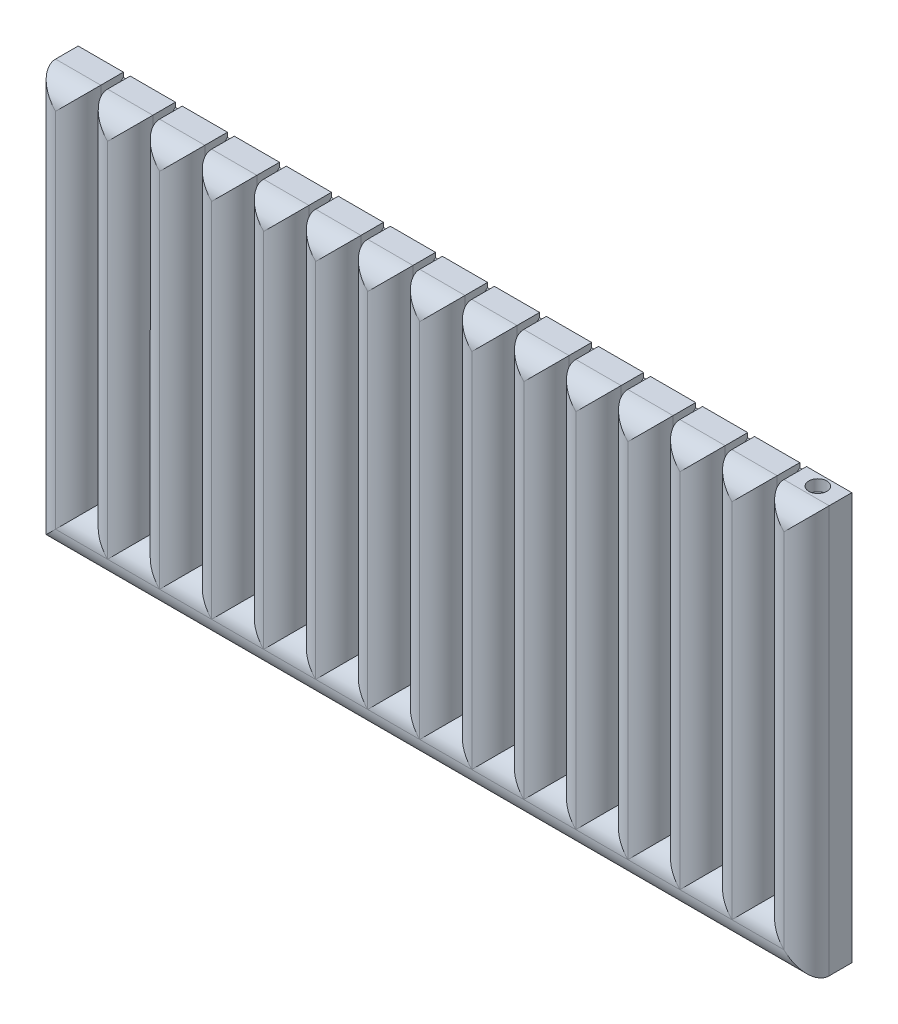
ISO-10303-21;
HEADER;
FILE_DESCRIPTION(('STEP AP214'),'2;1');
FILE_NAME('part.step','',(''),(''),'','','');
FILE_SCHEMA(('AUTOMOTIVE_DESIGN { 1 0 10303 214 1 1 1 1 }'));
ENDSEC;
DATA;
#1=APPLICATION_CONTEXT('core data for automotive mechanical design processes');
#2=APPLICATION_PROTOCOL_DEFINITION('international standard','automotive_design',2000,#1);
#3=PRODUCT_CONTEXT('',#1,'mechanical');
#4=PRODUCT('Part','Part','',(#3));
#5=PRODUCT_RELATED_PRODUCT_CATEGORY('part','',(#4));
#6=PRODUCT_DEFINITION_FORMATION('','',#4);
#7=PRODUCT_DEFINITION_CONTEXT('part definition',#1,'design');
#8=PRODUCT_DEFINITION('design','',#6,#7);
#9=PRODUCT_DEFINITION_SHAPE('','',#8);
#10=(LENGTH_UNIT() NAMED_UNIT(*) SI_UNIT(.MILLI.,.METRE.));
#11=(NAMED_UNIT(*) PLANE_ANGLE_UNIT() SI_UNIT($,.RADIAN.));
#12=(NAMED_UNIT(*) SI_UNIT($,.STERADIAN.) SOLID_ANGLE_UNIT());
#13=UNCERTAINTY_MEASURE_WITH_UNIT(LENGTH_MEASURE(1.E-05),#10,'distance_accuracy_value','');
#14=(GEOMETRIC_REPRESENTATION_CONTEXT(3) GLOBAL_UNCERTAINTY_ASSIGNED_CONTEXT((#13)) GLOBAL_UNIT_ASSIGNED_CONTEXT((#10,
#11,#12)) REPRESENTATION_CONTEXT('',''));
#15=CARTESIAN_POINT('',(0.,0.,0.));
#16=DIRECTION('',(0.,0.,1.));
#17=DIRECTION('',(1.,0.,0.));
#18=AXIS2_PLACEMENT_3D('',#15,#16,#17);
#19=CARTESIAN_POINT('',(0.,180.,20.));
#20=DIRECTION('',(0.,-1.,0.));
#21=DIRECTION('',(0.,0.,-1.));
#22=AXIS2_PLACEMENT_3D('',#19,#20,#21);
#23=PLANE('',#22);
#24=DIRECTION('',(0.,0.,1.));
#25=VECTOR('',#24,1.);
#26=CARTESIAN_POINT('',(319.,180.,4.));
#27=LINE('',#26,#25);
#28=CARTESIAN_POINT('',(319.,180.,0.));
#29=VERTEX_POINT('',#28);
#30=CARTESIAN_POINT('',(319.,180.,10.));
#31=VERTEX_POINT('',#30);
#32=EDGE_CURVE('E1321',#29,#31,#27,.T.);
#33=ORIENTED_EDGE('',*,*,#32,.F.);
#34=DIRECTION('',(-1.,0.,0.));
#35=VECTOR('',#34,1.);
#36=CARTESIAN_POINT('',(0.,180.,0.));
#37=LINE('',#36,#35);
#38=CARTESIAN_POINT('',(299.,180.,0.));
#39=VERTEX_POINT('',#38);
#40=EDGE_CURVE('E720',#29,#39,#37,.T.);
#41=ORIENTED_EDGE('',*,*,#40,.T.);
#42=DIRECTION('',(0.,0.,1.));
#43=VECTOR('',#42,1.);
#44=CARTESIAN_POINT('',(299.,180.,4.));
#45=LINE('',#44,#43);
#46=CARTESIAN_POINT('',(299.,180.,10.));
#47=VERTEX_POINT('',#46);
#48=EDGE_CURVE('E1345',#39,#47,#45,.T.);
#49=ORIENTED_EDGE('',*,*,#48,.T.);
#50=DIRECTION('',(-1.,0.,0.));
#51=VECTOR('',#50,1.);
#52=CARTESIAN_POINT('',(0.,180.,10.));
#53=LINE('',#52,#51);
#54=EDGE_CURVE('E741',#47,#31,#53,.F.);
#55=ORIENTED_EDGE('',*,*,#54,.T.);
#56=EDGE_LOOP('',(#33,#41,#49,#55));
#57=FACE_BOUND('',#56,.T.);
#58=ADVANCED_FACE('F30',(#57),#23,.F.);
#59=DIRECTION('',(0.,0.,1.));
#60=VECTOR('',#59,1.);
#61=CARTESIAN_POINT('',(296.,180.,4.));
#62=LINE('',#61,#60);
#63=CARTESIAN_POINT('',(296.,180.,0.));
#64=VERTEX_POINT('',#63);
#65=CARTESIAN_POINT('',(296.,180.,10.));
#66=VERTEX_POINT('',#65);
#67=EDGE_CURVE('E1341',#64,#66,#62,.T.);
#68=ORIENTED_EDGE('',*,*,#67,.F.);
#69=CARTESIAN_POINT('',(276.,180.,0.));
#70=VERTEX_POINT('',#69);
#71=EDGE_CURVE('E1793',#64,#70,#37,.T.);
#72=ORIENTED_EDGE('',*,*,#71,.T.);
#73=DIRECTION('',(0.,0.,1.));
#74=VECTOR('',#73,1.);
#75=CARTESIAN_POINT('',(276.,180.,4.));
#76=LINE('',#75,#74);
#77=CARTESIAN_POINT('',(276.,180.,10.));
#78=VERTEX_POINT('',#77);
#79=EDGE_CURVE('E1365',#70,#78,#76,.T.);
#80=ORIENTED_EDGE('',*,*,#79,.T.);
#81=DIRECTION('',(-1.,0.,0.));
#82=VECTOR('',#81,1.);
#83=CARTESIAN_POINT('',(0.,180.,10.));
#84=LINE('',#83,#82);
#85=EDGE_CURVE('E743',#78,#66,#84,.F.);
#86=ORIENTED_EDGE('',*,*,#85,.T.);
#87=EDGE_LOOP('',(#68,#72,#80,#86));
#88=FACE_BOUND('',#87,.T.);
#89=ADVANCED_FACE('F1689',(#88),#23,.F.);
#90=DIRECTION('',(0.,0.,1.));
#91=VECTOR('',#90,1.);
#92=CARTESIAN_POINT('',(273.,180.,4.));
#93=LINE('',#92,#91);
#94=CARTESIAN_POINT('',(273.,180.,0.));
#95=VERTEX_POINT('',#94);
#96=CARTESIAN_POINT('',(273.,180.,10.));
#97=VERTEX_POINT('',#96);
#98=EDGE_CURVE('E1361',#95,#97,#93,.T.);
#99=ORIENTED_EDGE('',*,*,#98,.F.);
#100=CARTESIAN_POINT('',(253.,180.,0.));
#101=VERTEX_POINT('',#100);
#102=EDGE_CURVE('E1789',#95,#101,#37,.T.);
#103=ORIENTED_EDGE('',*,*,#102,.T.);
#104=DIRECTION('',(0.,0.,1.));
#105=VECTOR('',#104,1.);
#106=CARTESIAN_POINT('',(253.,180.,4.));
#107=LINE('',#106,#105);
#108=CARTESIAN_POINT('',(253.,180.,10.));
#109=VERTEX_POINT('',#108);
#110=EDGE_CURVE('E1385',#101,#109,#107,.T.);
#111=ORIENTED_EDGE('',*,*,#110,.T.);
#112=DIRECTION('',(-1.,0.,0.));
#113=VECTOR('',#112,1.);
#114=CARTESIAN_POINT('',(0.,180.,10.));
#115=LINE('',#114,#113);
#116=EDGE_CURVE('E745',#109,#97,#115,.F.);
#117=ORIENTED_EDGE('',*,*,#116,.T.);
#118=EDGE_LOOP('',(#99,#103,#111,#117));
#119=FACE_BOUND('',#118,.T.);
#120=ADVANCED_FACE('F1696',(#119),#23,.F.);
#121=DIRECTION('',(0.,0.,1.));
#122=VECTOR('',#121,1.);
#123=CARTESIAN_POINT('',(250.,180.,4.));
#124=LINE('',#123,#122);
#125=CARTESIAN_POINT('',(250.,180.,0.));
#126=VERTEX_POINT('',#125);
#127=CARTESIAN_POINT('',(250.,180.,10.));
#128=VERTEX_POINT('',#127);
#129=EDGE_CURVE('E1381',#126,#128,#124,.T.);
#130=ORIENTED_EDGE('',*,*,#129,.F.);
#131=CARTESIAN_POINT('',(230.,180.,0.));
#132=VERTEX_POINT('',#131);
#133=EDGE_CURVE('E1785',#126,#132,#37,.T.);
#134=ORIENTED_EDGE('',*,*,#133,.T.);
#135=DIRECTION('',(0.,0.,1.));
#136=VECTOR('',#135,1.);
#137=CARTESIAN_POINT('',(230.,180.,4.));
#138=LINE('',#137,#136);
#139=CARTESIAN_POINT('',(230.,180.,10.));
#140=VERTEX_POINT('',#139);
#141=EDGE_CURVE('E1405',#132,#140,#138,.T.);
#142=ORIENTED_EDGE('',*,*,#141,.T.);
#143=DIRECTION('',(-1.,0.,0.));
#144=VECTOR('',#143,1.);
#145=CARTESIAN_POINT('',(0.,180.,10.));
#146=LINE('',#145,#144);
#147=EDGE_CURVE('E747',#140,#128,#146,.F.);
#148=ORIENTED_EDGE('',*,*,#147,.T.);
#149=EDGE_LOOP('',(#130,#134,#142,#148));
#150=FACE_BOUND('',#149,.T.);
#151=ADVANCED_FACE('F2213',(#150),#23,.F.);
#152=DIRECTION('',(0.,0.,1.));
#153=VECTOR('',#152,1.);
#154=CARTESIAN_POINT('',(227.,180.,4.));
#155=LINE('',#154,#153);
#156=CARTESIAN_POINT('',(227.,180.,0.));
#157=VERTEX_POINT('',#156);
#158=CARTESIAN_POINT('',(227.,180.,10.));
#159=VERTEX_POINT('',#158);
#160=EDGE_CURVE('E1401',#157,#159,#155,.T.);
#161=ORIENTED_EDGE('',*,*,#160,.F.);
#162=CARTESIAN_POINT('',(207.,180.,0.));
#163=VERTEX_POINT('',#162);
#164=EDGE_CURVE('E1781',#157,#163,#37,.T.);
#165=ORIENTED_EDGE('',*,*,#164,.T.);
#166=DIRECTION('',(0.,0.,1.));
#167=VECTOR('',#166,1.);
#168=CARTESIAN_POINT('',(207.,180.,4.));
#169=LINE('',#168,#167);
#170=CARTESIAN_POINT('',(207.,180.,10.));
#171=VERTEX_POINT('',#170);
#172=EDGE_CURVE('E1425',#163,#171,#169,.T.);
#173=ORIENTED_EDGE('',*,*,#172,.T.);
#174=DIRECTION('',(-1.,0.,0.));
#175=VECTOR('',#174,1.);
#176=CARTESIAN_POINT('',(0.,180.,10.));
#177=LINE('',#176,#175);
#178=EDGE_CURVE('E749',#171,#159,#177,.F.);
#179=ORIENTED_EDGE('',*,*,#178,.T.);
#180=EDGE_LOOP('',(#161,#165,#173,#179));
#181=FACE_BOUND('',#180,.T.);
#182=ADVANCED_FACE('F2181',(#181),#23,.F.);
#183=DIRECTION('',(0.,0.,1.));
#184=VECTOR('',#183,1.);
#185=CARTESIAN_POINT('',(204.,180.,4.));
#186=LINE('',#185,#184);
#187=CARTESIAN_POINT('',(204.,180.,0.));
#188=VERTEX_POINT('',#187);
#189=CARTESIAN_POINT('',(204.,180.,10.));
#190=VERTEX_POINT('',#189);
#191=EDGE_CURVE('E1421',#188,#190,#186,.T.);
#192=ORIENTED_EDGE('',*,*,#191,.F.);
#193=CARTESIAN_POINT('',(184.,180.,0.));
#194=VERTEX_POINT('',#193);
#195=EDGE_CURVE('E1777',#188,#194,#37,.T.);
#196=ORIENTED_EDGE('',*,*,#195,.T.);
#197=DIRECTION('',(0.,0.,1.));
#198=VECTOR('',#197,1.);
#199=CARTESIAN_POINT('',(184.,180.,4.));
#200=LINE('',#199,#198);
#201=CARTESIAN_POINT('',(184.,180.,10.));
#202=VERTEX_POINT('',#201);
#203=EDGE_CURVE('E1445',#194,#202,#200,.T.);
#204=ORIENTED_EDGE('',*,*,#203,.T.);
#205=DIRECTION('',(-1.,0.,0.));
#206=VECTOR('',#205,1.);
#207=CARTESIAN_POINT('',(0.,180.,10.));
#208=LINE('',#207,#206);
#209=EDGE_CURVE('E751',#202,#190,#208,.F.);
#210=ORIENTED_EDGE('',*,*,#209,.T.);
#211=EDGE_LOOP('',(#192,#196,#204,#210));
#212=FACE_BOUND('',#211,.T.);
#213=ADVANCED_FACE('F2157',(#212),#23,.F.);
#214=DIRECTION('',(0.,0.,1.));
#215=VECTOR('',#214,1.);
#216=CARTESIAN_POINT('',(181.,180.,4.));
#217=LINE('',#216,#215);
#218=CARTESIAN_POINT('',(181.,180.,0.));
#219=VERTEX_POINT('',#218);
#220=CARTESIAN_POINT('',(181.,180.,10.));
#221=VERTEX_POINT('',#220);
#222=EDGE_CURVE('E1441',#219,#221,#217,.T.);
#223=ORIENTED_EDGE('',*,*,#222,.F.);
#224=CARTESIAN_POINT('',(161.,180.,0.));
#225=VERTEX_POINT('',#224);
#226=EDGE_CURVE('E1773',#219,#225,#37,.T.);
#227=ORIENTED_EDGE('',*,*,#226,.T.);
#228=DIRECTION('',(0.,0.,1.));
#229=VECTOR('',#228,1.);
#230=CARTESIAN_POINT('',(161.,180.,4.));
#231=LINE('',#230,#229);
#232=CARTESIAN_POINT('',(161.,180.,10.));
#233=VERTEX_POINT('',#232);
#234=EDGE_CURVE('E1465',#225,#233,#231,.T.);
#235=ORIENTED_EDGE('',*,*,#234,.T.);
#236=DIRECTION('',(-1.,0.,0.));
#237=VECTOR('',#236,1.);
#238=CARTESIAN_POINT('',(0.,180.,10.));
#239=LINE('',#238,#237);
#240=EDGE_CURVE('E753',#233,#221,#239,.F.);
#241=ORIENTED_EDGE('',*,*,#240,.T.);
#242=EDGE_LOOP('',(#223,#227,#235,#241));
#243=FACE_BOUND('',#242,.T.);
#244=ADVANCED_FACE('F2125',(#243),#23,.F.);
#245=DIRECTION('',(0.,0.,1.));
#246=VECTOR('',#245,1.);
#247=CARTESIAN_POINT('',(158.,180.,4.));
#248=LINE('',#247,#246);
#249=CARTESIAN_POINT('',(158.,180.,0.));
#250=VERTEX_POINT('',#249);
#251=CARTESIAN_POINT('',(158.,180.,10.));
#252=VERTEX_POINT('',#251);
#253=EDGE_CURVE('E1461',#250,#252,#248,.T.);
#254=ORIENTED_EDGE('',*,*,#253,.F.);
#255=CARTESIAN_POINT('',(138.,180.,0.));
#256=VERTEX_POINT('',#255);
#257=EDGE_CURVE('E1769',#250,#256,#37,.T.);
#258=ORIENTED_EDGE('',*,*,#257,.T.);
#259=DIRECTION('',(0.,0.,1.));
#260=VECTOR('',#259,1.);
#261=CARTESIAN_POINT('',(138.,180.,4.));
#262=LINE('',#261,#260);
#263=CARTESIAN_POINT('',(138.,180.,10.));
#264=VERTEX_POINT('',#263);
#265=EDGE_CURVE('E1485',#256,#264,#262,.T.);
#266=ORIENTED_EDGE('',*,*,#265,.T.);
#267=DIRECTION('',(-1.,0.,0.));
#268=VECTOR('',#267,1.);
#269=CARTESIAN_POINT('',(0.,180.,10.));
#270=LINE('',#269,#268);
#271=EDGE_CURVE('E755',#264,#252,#270,.F.);
#272=ORIENTED_EDGE('',*,*,#271,.T.);
#273=EDGE_LOOP('',(#254,#258,#266,#272));
#274=FACE_BOUND('',#273,.T.);
#275=ADVANCED_FACE('F2101',(#274),#23,.F.);
#276=DIRECTION('',(0.,0.,1.));
#277=VECTOR('',#276,1.);
#278=CARTESIAN_POINT('',(135.,180.,4.));
#279=LINE('',#278,#277);
#280=CARTESIAN_POINT('',(135.,180.,0.));
#281=VERTEX_POINT('',#280);
#282=CARTESIAN_POINT('',(135.,180.,10.));
#283=VERTEX_POINT('',#282);
#284=EDGE_CURVE('E1481',#281,#283,#279,.T.);
#285=ORIENTED_EDGE('',*,*,#284,.F.);
#286=CARTESIAN_POINT('',(115.,180.,0.));
#287=VERTEX_POINT('',#286);
#288=EDGE_CURVE('E1767',#281,#287,#37,.T.);
#289=ORIENTED_EDGE('',*,*,#288,.T.);
#290=DIRECTION('',(0.,0.,1.));
#291=VECTOR('',#290,1.);
#292=CARTESIAN_POINT('',(115.,180.,4.));
#293=LINE('',#292,#291);
#294=CARTESIAN_POINT('',(115.,180.,10.));
#295=VERTEX_POINT('',#294);
#296=EDGE_CURVE('E1505',#287,#295,#293,.T.);
#297=ORIENTED_EDGE('',*,*,#296,.T.);
#298=DIRECTION('',(-1.,0.,0.));
#299=VECTOR('',#298,1.);
#300=CARTESIAN_POINT('',(0.,180.,10.));
#301=LINE('',#300,#299);
#302=EDGE_CURVE('E757',#295,#283,#301,.F.);
#303=ORIENTED_EDGE('',*,*,#302,.T.);
#304=EDGE_LOOP('',(#285,#289,#297,#303));
#305=FACE_BOUND('',#304,.T.);
#306=ADVANCED_FACE('F1728',(#305),#23,.F.);
#307=DIRECTION('',(0.,0.,1.));
#308=VECTOR('',#307,1.);
#309=CARTESIAN_POINT('',(112.,180.,4.));
#310=LINE('',#309,#308);
#311=CARTESIAN_POINT('',(112.,180.,0.));
#312=VERTEX_POINT('',#311);
#313=CARTESIAN_POINT('',(112.,180.,10.));
#314=VERTEX_POINT('',#313);
#315=EDGE_CURVE('E1501',#312,#314,#310,.T.);
#316=ORIENTED_EDGE('',*,*,#315,.F.);
#317=CARTESIAN_POINT('',(92.,180.,0.));
#318=VERTEX_POINT('',#317);
#319=EDGE_CURVE('E712',#312,#318,#37,.T.);
#320=ORIENTED_EDGE('',*,*,#319,.T.);
#321=DIRECTION('',(0.,0.,1.));
#322=VECTOR('',#321,1.);
#323=CARTESIAN_POINT('',(92.,180.,4.));
#324=LINE('',#323,#322);
#325=CARTESIAN_POINT('',(92.,180.,10.));
#326=VERTEX_POINT('',#325);
#327=EDGE_CURVE('E1525',#318,#326,#324,.T.);
#328=ORIENTED_EDGE('',*,*,#327,.T.);
#329=DIRECTION('',(-1.,0.,0.));
#330=VECTOR('',#329,1.);
#331=CARTESIAN_POINT('',(0.,180.,10.));
#332=LINE('',#331,#330);
#333=EDGE_CURVE('E759',#326,#314,#332,.F.);
#334=ORIENTED_EDGE('',*,*,#333,.T.);
#335=EDGE_LOOP('',(#316,#320,#328,#334));
#336=FACE_BOUND('',#335,.T.);
#337=ADVANCED_FACE('F1723',(#336),#23,.F.);
#338=DIRECTION('',(0.,0.,1.));
#339=VECTOR('',#338,1.);
#340=CARTESIAN_POINT('',(89.,180.,4.));
#341=LINE('',#340,#339);
#342=CARTESIAN_POINT('',(89.,180.,0.));
#343=VERTEX_POINT('',#342);
#344=CARTESIAN_POINT('',(89.,180.,10.));
#345=VERTEX_POINT('',#344);
#346=EDGE_CURVE('E1521',#343,#345,#341,.T.);
#347=ORIENTED_EDGE('',*,*,#346,.F.);
#348=CARTESIAN_POINT('',(69.,180.,0.));
#349=VERTEX_POINT('',#348);
#350=EDGE_CURVE('E708',#343,#349,#37,.T.);
#351=ORIENTED_EDGE('',*,*,#350,.T.);
#352=DIRECTION('',(0.,0.,1.));
#353=VECTOR('',#352,1.);
#354=CARTESIAN_POINT('',(69.,180.,4.));
#355=LINE('',#354,#353);
#356=CARTESIAN_POINT('',(69.,180.,10.));
#357=VERTEX_POINT('',#356);
#358=EDGE_CURVE('E690',#349,#357,#355,.T.);
#359=ORIENTED_EDGE('',*,*,#358,.T.);
#360=DIRECTION('',(-1.,0.,0.));
#361=VECTOR('',#360,1.);
#362=CARTESIAN_POINT('',(0.,180.,10.));
#363=LINE('',#362,#361);
#364=EDGE_CURVE('E761',#357,#345,#363,.F.);
#365=ORIENTED_EDGE('',*,*,#364,.T.);
#366=EDGE_LOOP('',(#347,#351,#359,#365));
#367=FACE_BOUND('',#366,.T.);
#368=ADVANCED_FACE('F1719',(#367),#23,.F.);
#369=DIRECTION('',(0.,0.,1.));
#370=VECTOR('',#369,1.);
#371=CARTESIAN_POINT('',(66.,180.,4.));
#372=LINE('',#371,#370);
#373=CARTESIAN_POINT('',(66.,180.,0.));
#374=VERTEX_POINT('',#373);
#375=CARTESIAN_POINT('',(66.,180.,10.));
#376=VERTEX_POINT('',#375);
#377=EDGE_CURVE('E681',#374,#376,#372,.T.);
#378=ORIENTED_EDGE('',*,*,#377,.F.);
#379=CARTESIAN_POINT('',(46.,180.,0.));
#380=VERTEX_POINT('',#379);
#381=EDGE_CURVE('E686',#374,#380,#37,.T.);
#382=ORIENTED_EDGE('',*,*,#381,.T.);
#383=DIRECTION('',(0.,0.,1.));
#384=VECTOR('',#383,1.);
#385=CARTESIAN_POINT('',(46.,180.,4.));
#386=LINE('',#385,#384);
#387=CARTESIAN_POINT('',(46.,180.,10.));
#388=VERTEX_POINT('',#387);
#389=EDGE_CURVE('E1560',#380,#388,#386,.T.);
#390=ORIENTED_EDGE('',*,*,#389,.T.);
#391=DIRECTION('',(-1.,0.,0.));
#392=VECTOR('',#391,1.);
#393=CARTESIAN_POINT('',(0.,180.,10.));
#394=LINE('',#393,#392);
#395=EDGE_CURVE('E687',#388,#376,#394,.F.);
#396=ORIENTED_EDGE('',*,*,#395,.T.);
#397=EDGE_LOOP('',(#378,#382,#390,#396));
#398=FACE_BOUND('',#397,.T.);
#399=ADVANCED_FACE('F683',(#398),#23,.F.);
#400=DIRECTION('',(0.,0.,1.));
#401=VECTOR('',#400,1.);
#402=CARTESIAN_POINT('',(43.,180.,4.));
#403=LINE('',#402,#401);
#404=CARTESIAN_POINT('',(43.,180.,0.));
#405=VERTEX_POINT('',#404);
#406=CARTESIAN_POINT('',(43.,180.,10.));
#407=VERTEX_POINT('',#406);
#408=EDGE_CURVE('E1556',#405,#407,#403,.T.);
#409=ORIENTED_EDGE('',*,*,#408,.F.);
#410=CARTESIAN_POINT('',(23.,180.,0.));
#411=VERTEX_POINT('',#410);
#412=EDGE_CURVE('E709',#405,#411,#37,.T.);
#413=ORIENTED_EDGE('',*,*,#412,.T.);
#414=DIRECTION('',(0.,0.,1.));
#415=VECTOR('',#414,1.);
#416=CARTESIAN_POINT('',(23.,180.,4.));
#417=LINE('',#416,#415);
#418=CARTESIAN_POINT('',(23.,180.,10.));
#419=VERTEX_POINT('',#418);
#420=EDGE_CURVE('E1577',#411,#419,#417,.T.);
#421=ORIENTED_EDGE('',*,*,#420,.T.);
#422=DIRECTION('',(-1.,0.,0.));
#423=VECTOR('',#422,1.);
#424=CARTESIAN_POINT('',(0.,180.,10.));
#425=LINE('',#424,#423);
#426=EDGE_CURVE('E764',#419,#407,#425,.F.);
#427=ORIENTED_EDGE('',*,*,#426,.T.);
#428=EDGE_LOOP('',(#409,#413,#421,#427));
#429=FACE_BOUND('',#428,.T.);
#430=ADVANCED_FACE('F1637',(#429),#23,.F.);
#431=DIRECTION('',(0.,0.,1.));
#432=VECTOR('',#431,1.);
#433=CARTESIAN_POINT('',(20.,180.,4.));
#434=LINE('',#433,#432);
#435=CARTESIAN_POINT('',(20.,180.,0.));
#436=VERTEX_POINT('',#435);
#437=CARTESIAN_POINT('',(20.,180.,10.));
#438=VERTEX_POINT('',#437);
#439=EDGE_CURVE('E49',#436,#438,#434,.T.);
#440=ORIENTED_EDGE('',*,*,#439,.F.);
#441=CARTESIAN_POINT('',(0.,180.,0.));
#442=VERTEX_POINT('',#441);
#443=EDGE_CURVE('E714',#436,#442,#37,.T.);
#444=ORIENTED_EDGE('',*,*,#443,.T.);
#445=DIRECTION('',(0.,0.,-1.));
#446=VECTOR('',#445,1.);
#447=CARTESIAN_POINT('',(0.,180.,20.));
#448=LINE('',#447,#446);
#449=CARTESIAN_POINT('',(0.,180.,10.));
#450=VERTEX_POINT('',#449);
#451=EDGE_CURVE('E719',#450,#442,#448,.T.);
#452=ORIENTED_EDGE('',*,*,#451,.F.);
#453=DIRECTION('',(-1.,0.,0.));
#454=VECTOR('',#453,1.);
#455=CARTESIAN_POINT('',(0.,180.,10.));
#456=LINE('',#455,#454);
#457=EDGE_CURVE('E766',#450,#438,#456,.F.);
#458=ORIENTED_EDGE('',*,*,#457,.T.);
#459=EDGE_LOOP('',(#440,#444,#452,#458));
#460=FACE_BOUND('',#459,.T.);
#461=ADVANCED_FACE('F1599',(#460),#23,.F.);
#462=CARTESIAN_POINT('',(0.,0.,20.));
#463=DIRECTION('',(1.,0.,0.));
#464=DIRECTION('',(0.,0.,-1.));
#465=AXIS2_PLACEMENT_3D('',#462,#463,#464);
#466=PLANE('',#465);
#467=DIRECTION('',(0.,0.,-1.));
#468=VECTOR('',#467,1.);
#469=CARTESIAN_POINT('',(0.,0.,20.));
#470=LINE('',#469,#468);
#471=CARTESIAN_POINT('',(0.,0.,10.));
#472=VERTEX_POINT('',#471);
#473=CARTESIAN_POINT('',(0.,0.,0.));
#474=VERTEX_POINT('',#473);
#475=EDGE_CURVE('E728',#472,#474,#470,.T.);
#476=ORIENTED_EDGE('',*,*,#475,.F.);
#477=DIRECTION('',(0.,-1.,0.));
#478=VECTOR('',#477,1.);
#479=CARTESIAN_POINT('',(0.,0.,10.));
#480=LINE('',#479,#478);
#481=EDGE_CURVE('E1002',#472,#450,#480,.F.);
#482=ORIENTED_EDGE('',*,*,#481,.T.);
#483=ORIENTED_EDGE('',*,*,#451,.T.);
#484=DIRECTION('',(0.,-1.,0.));
#485=VECTOR('',#484,1.);
#486=CARTESIAN_POINT('',(0.,0.,0.));
#487=LINE('',#486,#485);
#488=EDGE_CURVE('E1576',#442,#474,#487,.T.);
#489=ORIENTED_EDGE('',*,*,#488,.T.);
#490=EDGE_LOOP('',(#476,#482,#483,#489));
#491=FACE_BOUND('',#490,.T.);
#492=ADVANCED_FACE('F1603',(#491),#466,.F.);
#493=CARTESIAN_POINT('',(0.,0.,20.));
#494=DIRECTION('',(0.,1.,0.));
#495=DIRECTION('',(0.,0.,1.));
#496=AXIS2_PLACEMENT_3D('',#493,#494,#495);
#497=PLANE('',#496);
#498=DIRECTION('',(0.,0.,-1.));
#499=VECTOR('',#498,1.);
#500=CARTESIAN_POINT('',(342.,0.,20.));
#501=LINE('',#500,#499);
#502=CARTESIAN_POINT('',(342.,0.,10.));
#503=VERTEX_POINT('',#502);
#504=CARTESIAN_POINT('',(342.,0.,0.));
#505=VERTEX_POINT('',#504);
#506=EDGE_CURVE('E726',#503,#505,#501,.T.);
#507=ORIENTED_EDGE('',*,*,#506,.F.);
#508=DIRECTION('',(1.,0.,0.));
#509=VECTOR('',#508,1.);
#510=CARTESIAN_POINT('',(0.,0.,10.));
#511=LINE('',#510,#509);
#512=EDGE_CURVE('E1004',#503,#472,#511,.F.);
#513=ORIENTED_EDGE('',*,*,#512,.T.);
#514=ORIENTED_EDGE('',*,*,#475,.T.);
#515=DIRECTION('',(1.,0.,0.));
#516=VECTOR('',#515,1.);
#517=CARTESIAN_POINT('',(0.,0.,0.));
#518=LINE('',#517,#516);
#519=EDGE_CURVE('E1586',#474,#505,#518,.T.);
#520=ORIENTED_EDGE('',*,*,#519,.T.);
#521=EDGE_LOOP('',(#507,#513,#514,#520));
#522=FACE_BOUND('',#521,.T.);
#523=ADVANCED_FACE('F1707',(#522),#497,.F.);
#524=CARTESIAN_POINT('',(342.,0.,20.));
#525=DIRECTION('',(-1.,0.,0.));
#526=DIRECTION('',(0.,0.,1.));
#527=AXIS2_PLACEMENT_3D('',#524,#525,#526);
#528=PLANE('',#527);
#529=DIRECTION('',(0.,0.,-1.));
#530=VECTOR('',#529,1.);
#531=CARTESIAN_POINT('',(342.,180.,20.));
#532=LINE('',#531,#530);
#533=CARTESIAN_POINT('',(342.,180.,10.));
#534=VERTEX_POINT('',#533);
#535=CARTESIAN_POINT('',(342.,180.,0.));
#536=VERTEX_POINT('',#535);
#537=EDGE_CURVE('E724',#534,#536,#532,.T.);
#538=ORIENTED_EDGE('',*,*,#537,.F.);
#539=DIRECTION('',(0.,1.,0.));
#540=VECTOR('',#539,1.);
#541=CARTESIAN_POINT('',(342.,0.,10.));
#542=LINE('',#541,#540);
#543=EDGE_CURVE('E1006',#534,#503,#542,.F.);
#544=ORIENTED_EDGE('',*,*,#543,.T.);
#545=ORIENTED_EDGE('',*,*,#506,.T.);
#546=DIRECTION('',(0.,1.,0.));
#547=VECTOR('',#546,1.);
#548=CARTESIAN_POINT('',(342.,0.,0.));
#549=LINE('',#548,#547);
#550=EDGE_CURVE('E721',#505,#536,#549,.T.);
#551=ORIENTED_EDGE('',*,*,#550,.T.);
#552=EDGE_LOOP('',(#538,#544,#545,#551));
#553=FACE_BOUND('',#552,.T.);
#554=ADVANCED_FACE('F1701',(#553),#528,.F.);
#555=CARTESIAN_POINT('',(332.,180.,5.));
#556=DIRECTION('',(0.,1.,0.));
#557=DIRECTION('',(0.,0.,1.));
#558=AXIS2_PLACEMENT_3D('',#555,#556,#557);
#559=CIRCLE('',#558,3.99999999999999);
#560=CARTESIAN_POINT('',(332.,180.,8.99999999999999));
#561=VERTEX_POINT('',#560);
#562=EDGE_CURVE('E1315',#561,#561,#559,.T.);
#563=ORIENTED_EDGE('',*,*,#562,.F.);
#564=EDGE_LOOP('',(#563));
#565=FACE_BOUND('',#564,.T.);
#566=CARTESIAN_POINT('',(322.,180.,0.));
#567=VERTEX_POINT('',#566);
#568=EDGE_CURVE('E715',#536,#567,#37,.T.);
#569=ORIENTED_EDGE('',*,*,#568,.T.);
#570=DIRECTION('',(0.,0.,1.));
#571=VECTOR('',#570,1.);
#572=CARTESIAN_POINT('',(322.,180.,4.));
#573=LINE('',#572,#571);
#574=CARTESIAN_POINT('',(322.,180.,10.));
#575=VERTEX_POINT('',#574);
#576=EDGE_CURVE('E1325',#567,#575,#573,.T.);
#577=ORIENTED_EDGE('',*,*,#576,.T.);
#578=DIRECTION('',(-1.,0.,0.));
#579=VECTOR('',#578,1.);
#580=CARTESIAN_POINT('',(0.,180.,10.));
#581=LINE('',#580,#579);
#582=EDGE_CURVE('E739',#575,#534,#581,.F.);
#583=ORIENTED_EDGE('',*,*,#582,.T.);
#584=ORIENTED_EDGE('',*,*,#537,.T.);
#585=EDGE_LOOP('',(#569,#577,#583,#584));
#586=FACE_BOUND('',#585,.T.);
#587=ADVANCED_FACE('F1692',(#565,#586),#23,.F.);
#588=CARTESIAN_POINT('',(0.,180.,0.));
#589=DIRECTION('',(0.,0.,-1.));
#590=DIRECTION('',(-1.,0.,0.));
#591=AXIS2_PLACEMENT_3D('',#588,#589,#590);
#592=PLANE('',#591);
#593=ORIENTED_EDGE('',*,*,#40,.F.);
#594=DIRECTION('',(0.,-1.,0.));
#595=VECTOR('',#594,1.);
#596=CARTESIAN_POINT('',(319.,180.,0.));
#597=LINE('',#596,#595);
#598=CARTESIAN_POINT('',(319.,178.,0.));
#599=VERTEX_POINT('',#598);
#600=EDGE_CURVE('E882',#29,#599,#597,.T.);
#601=ORIENTED_EDGE('',*,*,#600,.T.);
#602=DIRECTION('',(1.,0.,0.));
#603=VECTOR('',#602,1.);
#604=CARTESIAN_POINT('',(320.5,178.,0.));
#605=LINE('',#604,#603);
#606=CARTESIAN_POINT('',(322.,178.,0.));
#607=VERTEX_POINT('',#606);
#608=EDGE_CURVE('E876',#599,#607,#605,.T.);
#609=ORIENTED_EDGE('',*,*,#608,.T.);
#610=DIRECTION('',(0.,1.,0.));
#611=VECTOR('',#610,1.);
#612=CARTESIAN_POINT('',(322.,180.,0.));
#613=LINE('',#612,#611);
#614=EDGE_CURVE('E879',#607,#567,#613,.T.);
#615=ORIENTED_EDGE('',*,*,#614,.T.);
#616=ORIENTED_EDGE('',*,*,#568,.F.);
#617=ORIENTED_EDGE('',*,*,#550,.F.);
#618=ORIENTED_EDGE('',*,*,#519,.F.);
#619=ORIENTED_EDGE('',*,*,#488,.F.);
#620=ORIENTED_EDGE('',*,*,#443,.F.);
#621=DIRECTION('',(0.,-1.,0.));
#622=VECTOR('',#621,1.);
#623=CARTESIAN_POINT('',(20.,180.,0.));
#624=LINE('',#623,#622);
#625=CARTESIAN_POINT('',(20.,178.,0.));
#626=VERTEX_POINT('',#625);
#627=EDGE_CURVE('E774',#436,#626,#624,.T.);
#628=ORIENTED_EDGE('',*,*,#627,.T.);
#629=DIRECTION('',(1.,0.,0.));
#630=VECTOR('',#629,1.);
#631=CARTESIAN_POINT('',(21.5,178.,0.));
#632=LINE('',#631,#630);
#633=CARTESIAN_POINT('',(23.,178.,0.));
#634=VERTEX_POINT('',#633);
#635=EDGE_CURVE('E768',#626,#634,#632,.T.);
#636=ORIENTED_EDGE('',*,*,#635,.T.);
#637=DIRECTION('',(0.,1.,0.));
#638=VECTOR('',#637,1.);
#639=CARTESIAN_POINT('',(23.,180.,0.));
#640=LINE('',#639,#638);
#641=EDGE_CURVE('E771',#634,#411,#640,.T.);
#642=ORIENTED_EDGE('',*,*,#641,.T.);
#643=ORIENTED_EDGE('',*,*,#412,.F.);
#644=DIRECTION('',(0.,-1.,0.));
#645=VECTOR('',#644,1.);
#646=CARTESIAN_POINT('',(43.,180.,0.));
#647=LINE('',#646,#645);
#648=CARTESIAN_POINT('',(43.,178.,0.));
#649=VERTEX_POINT('',#648);
#650=EDGE_CURVE('E780',#405,#649,#647,.T.);
#651=ORIENTED_EDGE('',*,*,#650,.T.);
#652=DIRECTION('',(1.,0.,0.));
#653=VECTOR('',#652,1.);
#654=CARTESIAN_POINT('',(44.5,178.,0.));
#655=LINE('',#654,#653);
#656=CARTESIAN_POINT('',(46.,178.,0.));
#657=VERTEX_POINT('',#656);
#658=EDGE_CURVE('E777',#649,#657,#655,.T.);
#659=ORIENTED_EDGE('',*,*,#658,.T.);
#660=DIRECTION('',(0.,1.,0.));
#661=VECTOR('',#660,1.);
#662=CARTESIAN_POINT('',(46.,180.,0.));
#663=LINE('',#662,#661);
#664=EDGE_CURVE('E707',#657,#380,#663,.T.);
#665=ORIENTED_EDGE('',*,*,#664,.T.);
#666=ORIENTED_EDGE('',*,*,#381,.F.);
#667=DIRECTION('',(0.,-1.,0.));
#668=VECTOR('',#667,1.);
#669=CARTESIAN_POINT('',(66.,180.,0.));
#670=LINE('',#669,#668);
#671=CARTESIAN_POINT('',(66.,178.,0.));
#672=VERTEX_POINT('',#671);
#673=EDGE_CURVE('E693',#374,#672,#670,.T.);
#674=ORIENTED_EDGE('',*,*,#673,.T.);
#675=DIRECTION('',(1.,0.,0.));
#676=VECTOR('',#675,1.);
#677=CARTESIAN_POINT('',(67.5,178.,0.));
#678=LINE('',#677,#676);
#679=CARTESIAN_POINT('',(69.,178.,0.));
#680=VERTEX_POINT('',#679);
#681=EDGE_CURVE('E783',#672,#680,#678,.T.);
#682=ORIENTED_EDGE('',*,*,#681,.T.);
#683=DIRECTION('',(0.,1.,0.));
#684=VECTOR('',#683,1.);
#685=CARTESIAN_POINT('',(69.,180.,0.));
#686=LINE('',#685,#684);
#687=EDGE_CURVE('E701',#680,#349,#686,.T.);
#688=ORIENTED_EDGE('',*,*,#687,.T.);
#689=ORIENTED_EDGE('',*,*,#350,.F.);
#690=DIRECTION('',(0.,-1.,0.));
#691=VECTOR('',#690,1.);
#692=CARTESIAN_POINT('',(89.,180.,0.));
#693=LINE('',#692,#691);
#694=CARTESIAN_POINT('',(89.,178.,0.));
#695=VERTEX_POINT('',#694);
#696=EDGE_CURVE('E792',#343,#695,#693,.T.);
#697=ORIENTED_EDGE('',*,*,#696,.T.);
#698=DIRECTION('',(1.,0.,0.));
#699=VECTOR('',#698,1.);
#700=CARTESIAN_POINT('',(90.5,178.,0.));
#701=LINE('',#700,#699);
#702=CARTESIAN_POINT('',(92.,178.,0.));
#703=VERTEX_POINT('',#702);
#704=EDGE_CURVE('E700',#695,#703,#701,.T.);
#705=ORIENTED_EDGE('',*,*,#704,.T.);
#706=DIRECTION('',(0.,1.,0.));
#707=VECTOR('',#706,1.);
#708=CARTESIAN_POINT('',(92.,180.,0.));
#709=LINE('',#708,#707);
#710=EDGE_CURVE('E789',#703,#318,#709,.T.);
#711=ORIENTED_EDGE('',*,*,#710,.T.);
#712=ORIENTED_EDGE('',*,*,#319,.F.);
#713=DIRECTION('',(0.,-1.,0.));
#714=VECTOR('',#713,1.);
#715=CARTESIAN_POINT('',(112.,180.,0.));
#716=LINE('',#715,#714);
#717=CARTESIAN_POINT('',(112.,178.,0.));
#718=VERTEX_POINT('',#717);
#719=EDGE_CURVE('E801',#312,#718,#716,.T.);
#720=ORIENTED_EDGE('',*,*,#719,.T.);
#721=DIRECTION('',(1.,0.,0.));
#722=VECTOR('',#721,1.);
#723=CARTESIAN_POINT('',(113.5,178.,0.));
#724=LINE('',#723,#722);
#725=CARTESIAN_POINT('',(115.,178.,0.));
#726=VERTEX_POINT('',#725);
#727=EDGE_CURVE('E795',#718,#726,#724,.T.);
#728=ORIENTED_EDGE('',*,*,#727,.T.);
#729=DIRECTION('',(0.,1.,0.));
#730=VECTOR('',#729,1.);
#731=CARTESIAN_POINT('',(115.,180.,0.));
#732=LINE('',#731,#730);
#733=EDGE_CURVE('E798',#726,#287,#732,.T.);
#734=ORIENTED_EDGE('',*,*,#733,.T.);
#735=ORIENTED_EDGE('',*,*,#288,.F.);
#736=DIRECTION('',(0.,-1.,0.));
#737=VECTOR('',#736,1.);
#738=CARTESIAN_POINT('',(135.,180.,0.));
#739=LINE('',#738,#737);
#740=CARTESIAN_POINT('',(135.,178.,0.));
#741=VERTEX_POINT('',#740);
#742=EDGE_CURVE('E810',#281,#741,#739,.T.);
#743=ORIENTED_EDGE('',*,*,#742,.T.);
#744=DIRECTION('',(1.,0.,0.));
#745=VECTOR('',#744,1.);
#746=CARTESIAN_POINT('',(136.5,178.,0.));
#747=LINE('',#746,#745);
#748=CARTESIAN_POINT('',(138.,178.,0.));
#749=VERTEX_POINT('',#748);
#750=EDGE_CURVE('E804',#741,#749,#747,.T.);
#751=ORIENTED_EDGE('',*,*,#750,.T.);
#752=DIRECTION('',(0.,1.,0.));
#753=VECTOR('',#752,1.);
#754=CARTESIAN_POINT('',(138.,180.,0.));
#755=LINE('',#754,#753);
#756=EDGE_CURVE('E807',#749,#256,#755,.T.);
#757=ORIENTED_EDGE('',*,*,#756,.T.);
#758=ORIENTED_EDGE('',*,*,#257,.F.);
#759=DIRECTION('',(0.,-1.,0.));
#760=VECTOR('',#759,1.);
#761=CARTESIAN_POINT('',(158.,180.,0.));
#762=LINE('',#761,#760);
#763=CARTESIAN_POINT('',(158.,178.,0.));
#764=VERTEX_POINT('',#763);
#765=EDGE_CURVE('E819',#250,#764,#762,.T.);
#766=ORIENTED_EDGE('',*,*,#765,.T.);
#767=DIRECTION('',(1.,0.,0.));
#768=VECTOR('',#767,1.);
#769=CARTESIAN_POINT('',(159.5,178.,0.));
#770=LINE('',#769,#768);
#771=CARTESIAN_POINT('',(161.,178.,0.));
#772=VERTEX_POINT('',#771);
#773=EDGE_CURVE('E813',#764,#772,#770,.T.);
#774=ORIENTED_EDGE('',*,*,#773,.T.);
#775=DIRECTION('',(0.,1.,0.));
#776=VECTOR('',#775,1.);
#777=CARTESIAN_POINT('',(161.,180.,0.));
#778=LINE('',#777,#776);
#779=EDGE_CURVE('E816',#772,#225,#778,.T.);
#780=ORIENTED_EDGE('',*,*,#779,.T.);
#781=ORIENTED_EDGE('',*,*,#226,.F.);
#782=DIRECTION('',(0.,-1.,0.));
#783=VECTOR('',#782,1.);
#784=CARTESIAN_POINT('',(181.,180.,0.));
#785=LINE('',#784,#783);
#786=CARTESIAN_POINT('',(181.,178.,0.));
#787=VERTEX_POINT('',#786);
#788=EDGE_CURVE('E828',#219,#787,#785,.T.);
#789=ORIENTED_EDGE('',*,*,#788,.T.);
#790=DIRECTION('',(1.,0.,0.));
#791=VECTOR('',#790,1.);
#792=CARTESIAN_POINT('',(182.5,178.,0.));
#793=LINE('',#792,#791);
#794=CARTESIAN_POINT('',(184.,178.,0.));
#795=VERTEX_POINT('',#794);
#796=EDGE_CURVE('E822',#787,#795,#793,.T.);
#797=ORIENTED_EDGE('',*,*,#796,.T.);
#798=DIRECTION('',(0.,1.,0.));
#799=VECTOR('',#798,1.);
#800=CARTESIAN_POINT('',(184.,180.,0.));
#801=LINE('',#800,#799);
#802=EDGE_CURVE('E825',#795,#194,#801,.T.);
#803=ORIENTED_EDGE('',*,*,#802,.T.);
#804=ORIENTED_EDGE('',*,*,#195,.F.);
#805=DIRECTION('',(0.,-1.,0.));
#806=VECTOR('',#805,1.);
#807=CARTESIAN_POINT('',(204.,180.,0.));
#808=LINE('',#807,#806);
#809=CARTESIAN_POINT('',(204.,178.,0.));
#810=VERTEX_POINT('',#809);
#811=EDGE_CURVE('E837',#188,#810,#808,.T.);
#812=ORIENTED_EDGE('',*,*,#811,.T.);
#813=DIRECTION('',(1.,0.,0.));
#814=VECTOR('',#813,1.);
#815=CARTESIAN_POINT('',(205.5,178.,0.));
#816=LINE('',#815,#814);
#817=CARTESIAN_POINT('',(207.,178.,0.));
#818=VERTEX_POINT('',#817);
#819=EDGE_CURVE('E831',#810,#818,#816,.T.);
#820=ORIENTED_EDGE('',*,*,#819,.T.);
#821=DIRECTION('',(0.,1.,0.));
#822=VECTOR('',#821,1.);
#823=CARTESIAN_POINT('',(207.,180.,0.));
#824=LINE('',#823,#822);
#825=EDGE_CURVE('E834',#818,#163,#824,.T.);
#826=ORIENTED_EDGE('',*,*,#825,.T.);
#827=ORIENTED_EDGE('',*,*,#164,.F.);
#828=DIRECTION('',(0.,-1.,0.));
#829=VECTOR('',#828,1.);
#830=CARTESIAN_POINT('',(227.,180.,0.));
#831=LINE('',#830,#829);
#832=CARTESIAN_POINT('',(227.,178.,0.));
#833=VERTEX_POINT('',#832);
#834=EDGE_CURVE('E846',#157,#833,#831,.T.);
#835=ORIENTED_EDGE('',*,*,#834,.T.);
#836=DIRECTION('',(1.,0.,0.));
#837=VECTOR('',#836,1.);
#838=CARTESIAN_POINT('',(228.5,178.,0.));
#839=LINE('',#838,#837);
#840=CARTESIAN_POINT('',(230.,178.,0.));
#841=VERTEX_POINT('',#840);
#842=EDGE_CURVE('E840',#833,#841,#839,.T.);
#843=ORIENTED_EDGE('',*,*,#842,.T.);
#844=DIRECTION('',(0.,1.,0.));
#845=VECTOR('',#844,1.);
#846=CARTESIAN_POINT('',(230.,180.,0.));
#847=LINE('',#846,#845);
#848=EDGE_CURVE('E843',#841,#132,#847,.T.);
#849=ORIENTED_EDGE('',*,*,#848,.T.);
#850=ORIENTED_EDGE('',*,*,#133,.F.);
#851=DIRECTION('',(0.,-1.,0.));
#852=VECTOR('',#851,1.);
#853=CARTESIAN_POINT('',(250.,180.,0.));
#854=LINE('',#853,#852);
#855=CARTESIAN_POINT('',(250.,178.,0.));
#856=VERTEX_POINT('',#855);
#857=EDGE_CURVE('E855',#126,#856,#854,.T.);
#858=ORIENTED_EDGE('',*,*,#857,.T.);
#859=DIRECTION('',(1.,0.,0.));
#860=VECTOR('',#859,1.);
#861=CARTESIAN_POINT('',(251.5,178.,0.));
#862=LINE('',#861,#860);
#863=CARTESIAN_POINT('',(253.,178.,0.));
#864=VERTEX_POINT('',#863);
#865=EDGE_CURVE('E849',#856,#864,#862,.T.);
#866=ORIENTED_EDGE('',*,*,#865,.T.);
#867=DIRECTION('',(0.,1.,0.));
#868=VECTOR('',#867,1.);
#869=CARTESIAN_POINT('',(253.,180.,0.));
#870=LINE('',#869,#868);
#871=EDGE_CURVE('E852',#864,#101,#870,.T.);
#872=ORIENTED_EDGE('',*,*,#871,.T.);
#873=ORIENTED_EDGE('',*,*,#102,.F.);
#874=DIRECTION('',(0.,-1.,0.));
#875=VECTOR('',#874,1.);
#876=CARTESIAN_POINT('',(273.,180.,0.));
#877=LINE('',#876,#875);
#878=CARTESIAN_POINT('',(273.,178.,0.));
#879=VERTEX_POINT('',#878);
#880=EDGE_CURVE('E864',#95,#879,#877,.T.);
#881=ORIENTED_EDGE('',*,*,#880,.T.);
#882=DIRECTION('',(1.,0.,0.));
#883=VECTOR('',#882,1.);
#884=CARTESIAN_POINT('',(274.5,178.,0.));
#885=LINE('',#884,#883);
#886=CARTESIAN_POINT('',(276.,178.,0.));
#887=VERTEX_POINT('',#886);
#888=EDGE_CURVE('E858',#879,#887,#885,.T.);
#889=ORIENTED_EDGE('',*,*,#888,.T.);
#890=DIRECTION('',(0.,1.,0.));
#891=VECTOR('',#890,1.);
#892=CARTESIAN_POINT('',(276.,180.,0.));
#893=LINE('',#892,#891);
#894=EDGE_CURVE('E861',#887,#70,#893,.T.);
#895=ORIENTED_EDGE('',*,*,#894,.T.);
#896=ORIENTED_EDGE('',*,*,#71,.F.);
#897=DIRECTION('',(0.,-1.,0.));
#898=VECTOR('',#897,1.);
#899=CARTESIAN_POINT('',(296.,180.,0.));
#900=LINE('',#899,#898);
#901=CARTESIAN_POINT('',(296.,178.,0.));
#902=VERTEX_POINT('',#901);
#903=EDGE_CURVE('E873',#64,#902,#900,.T.);
#904=ORIENTED_EDGE('',*,*,#903,.T.);
#905=DIRECTION('',(1.,0.,0.));
#906=VECTOR('',#905,1.);
#907=CARTESIAN_POINT('',(297.5,178.,0.));
#908=LINE('',#907,#906);
#909=CARTESIAN_POINT('',(299.,178.,0.));
#910=VERTEX_POINT('',#909);
#911=EDGE_CURVE('E867',#902,#910,#908,.T.);
#912=ORIENTED_EDGE('',*,*,#911,.T.);
#913=DIRECTION('',(0.,1.,0.));
#914=VECTOR('',#913,1.);
#915=CARTESIAN_POINT('',(299.,180.,0.));
#916=LINE('',#915,#914);
#917=EDGE_CURVE('E870',#910,#39,#916,.T.);
#918=ORIENTED_EDGE('',*,*,#917,.T.);
#919=EDGE_LOOP('',(#593,#601,#609,#615,#616,#617,#618,#619,#620,#628,#636,#642,#643,#651,#659,
#665,#666,#674,#682,#688,#689,#697,#705,#711,#712,#720,#728,#734,#735,#743,#751,#757,#758,#766,
#774,#780,#781,#789,#797,#803,#804,#812,#820,#826,#827,#835,#843,#849,#850,#858,#866,#872,#873,
#881,#889,#895,#896,#904,#912,#918));
#920=FACE_BOUND('',#919,.T.);
#921=ADVANCED_FACE('F705',(#920),#592,.T.);
#922=CARTESIAN_POINT('',(20.,180.,4.));
#923=DIRECTION('',(-1.,0.,0.));
#924=DIRECTION('',(0.,-1.,0.));
#925=AXIS2_PLACEMENT_3D('',#922,#923,#924);
#926=PLANE('',#925);
#927=ORIENTED_EDGE('',*,*,#439,.T.);
#928=DIRECTION('',(0.,-1.,0.));
#929=VECTOR('',#928,1.);
#930=CARTESIAN_POINT('',(20.,180.,10.));
#931=LINE('',#930,#929);
#932=CARTESIAN_POINT('',(20.,20.,10.));
#933=VERTEX_POINT('',#932);
#934=EDGE_CURVE('E993',#438,#933,#931,.T.);
#935=ORIENTED_EDGE('',*,*,#934,.T.);
#936=DIRECTION('',(0.,0.,1.));
#937=VECTOR('',#936,1.);
#938=CARTESIAN_POINT('',(20.,20.,4.));
#939=LINE('',#938,#937);
#940=CARTESIAN_POINT('',(20.,20.,4.));
#941=VERTEX_POINT('',#940);
#942=EDGE_CURVE('E1574',#941,#933,#939,.T.);
#943=ORIENTED_EDGE('',*,*,#942,.F.);
#944=DIRECTION('',(0.,-1.,0.));
#945=VECTOR('',#944,1.);
#946=CARTESIAN_POINT('',(20.,180.,4.));
#947=LINE('',#946,#945);
#948=CARTESIAN_POINT('',(20.,170.,4.));
#949=VERTEX_POINT('',#948);
#950=EDGE_CURVE('E1559',#949,#941,#947,.T.);
#951=ORIENTED_EDGE('',*,*,#950,.F.);
#952=CARTESIAN_POINT('',(20.,170.,-6.));
#953=DIRECTION('',(-1.,0.,0.));
#954=DIRECTION('',(0.,-1.,0.));
#955=AXIS2_PLACEMENT_3D('',#952,#953,#954);
#956=CIRCLE('',#955,10.);
#957=EDGE_CURVE('E40',#949,#626,#956,.T.);
#958=ORIENTED_EDGE('',*,*,#957,.T.);
#959=ORIENTED_EDGE('',*,*,#627,.F.);
#960=EDGE_LOOP('',(#927,#935,#943,#951,#958,#959));
#961=FACE_BOUND('',#960,.T.);
#962=ADVANCED_FACE('F1621',(#961),#926,.F.);
#963=CARTESIAN_POINT('',(23.,180.,4.));
#964=DIRECTION('',(1.,0.,0.));
#965=DIRECTION('',(0.,1.,0.));
#966=AXIS2_PLACEMENT_3D('',#963,#964,#965);
#967=PLANE('',#966);
#968=DIRECTION('',(0.,0.,1.));
#969=VECTOR('',#968,1.);
#970=CARTESIAN_POINT('',(23.,20.,4.));
#971=LINE('',#970,#969);
#972=CARTESIAN_POINT('',(23.,20.,4.));
#973=VERTEX_POINT('',#972);
#974=CARTESIAN_POINT('',(23.,20.,10.));
#975=VERTEX_POINT('',#974);
#976=EDGE_CURVE('E1580',#973,#975,#971,.T.);
#977=ORIENTED_EDGE('',*,*,#976,.T.);
#978=DIRECTION('',(0.,1.,0.));
#979=VECTOR('',#978,1.);
#980=CARTESIAN_POINT('',(23.,180.,10.));
#981=LINE('',#980,#979);
#982=EDGE_CURVE('E997',#975,#419,#981,.T.);
#983=ORIENTED_EDGE('',*,*,#982,.T.);
#984=ORIENTED_EDGE('',*,*,#420,.F.);
#985=ORIENTED_EDGE('',*,*,#641,.F.);
#986=CARTESIAN_POINT('',(23.,170.,-6.));
#987=DIRECTION('',(1.,0.,0.));
#988=DIRECTION('',(0.,1.,0.));
#989=AXIS2_PLACEMENT_3D('',#986,#987,#988);
#990=CIRCLE('',#989,10.);
#991=CARTESIAN_POINT('',(23.,170.,4.));
#992=VERTEX_POINT('',#991);
#993=EDGE_CURVE('E11',#634,#992,#990,.T.);
#994=ORIENTED_EDGE('',*,*,#993,.T.);
#995=DIRECTION('',(0.,1.,0.));
#996=VECTOR('',#995,1.);
#997=CARTESIAN_POINT('',(23.,180.,4.));
#998=LINE('',#997,#996);
#999=EDGE_CURVE('E1571',#973,#992,#998,.T.);
#1000=ORIENTED_EDGE('',*,*,#999,.F.);
#1001=EDGE_LOOP('',(#977,#983,#984,#985,#994,#1000));
#1002=FACE_BOUND('',#1001,.T.);
#1003=ADVANCED_FACE('F1634',(#1002),#967,.F.);
#1004=CARTESIAN_POINT('',(20.,20.,4.));
#1005=DIRECTION('',(0.,-1.,0.));
#1006=DIRECTION('',(0.,0.,-1.));
#1007=AXIS2_PLACEMENT_3D('',#1004,#1005,#1006);
#1008=PLANE('',#1007);
#1009=ORIENTED_EDGE('',*,*,#942,.T.);
#1010=DIRECTION('',(1.,0.,0.));
#1011=VECTOR('',#1010,1.);
#1012=CARTESIAN_POINT('',(20.,20.,10.));
#1013=LINE('',#1012,#1011);
#1014=EDGE_CURVE('E995',#933,#975,#1013,.T.);
#1015=ORIENTED_EDGE('',*,*,#1014,.T.);
#1016=ORIENTED_EDGE('',*,*,#976,.F.);
#1017=DIRECTION('',(1.,0.,0.));
#1018=VECTOR('',#1017,1.);
#1019=CARTESIAN_POINT('',(20.,20.,4.));
#1020=LINE('',#1019,#1018);
#1021=EDGE_CURVE('E1568',#941,#973,#1020,.T.);
#1022=ORIENTED_EDGE('',*,*,#1021,.F.);
#1023=EDGE_LOOP('',(#1009,#1015,#1016,#1022));
#1024=FACE_BOUND('',#1023,.T.);
#1025=ADVANCED_FACE('F1625',(#1024),#1008,.F.);
#1026=CARTESIAN_POINT('',(20.,20.,4.));
#1027=DIRECTION('',(0.,0.,1.));
#1028=DIRECTION('',(1.,0.,0.));
#1029=AXIS2_PLACEMENT_3D('',#1026,#1027,#1028);
#1030=PLANE('',#1029);
#1031=ORIENTED_EDGE('',*,*,#999,.T.);
#1032=DIRECTION('',(-1.,0.,0.));
#1033=VECTOR('',#1032,1.);
#1034=CARTESIAN_POINT('',(20.,170.,4.));
#1035=LINE('',#1034,#1033);
#1036=EDGE_CURVE('E999',#992,#949,#1035,.T.);
#1037=ORIENTED_EDGE('',*,*,#1036,.T.);
#1038=ORIENTED_EDGE('',*,*,#950,.T.);
#1039=ORIENTED_EDGE('',*,*,#1021,.T.);
#1040=EDGE_LOOP('',(#1031,#1037,#1038,#1039));
#1041=FACE_BOUND('',#1040,.T.);
#1042=ADVANCED_FACE('F1628',(#1041),#1030,.T.);
#1043=CARTESIAN_POINT('',(43.,180.,4.));
#1044=DIRECTION('',(-1.,0.,0.));
#1045=DIRECTION('',(0.,-1.,0.));
#1046=AXIS2_PLACEMENT_3D('',#1043,#1044,#1045);
#1047=PLANE('',#1046);
#1048=ORIENTED_EDGE('',*,*,#408,.T.);
#1049=DIRECTION('',(0.,-1.,0.));
#1050=VECTOR('',#1049,1.);
#1051=CARTESIAN_POINT('',(43.,180.,10.));
#1052=LINE('',#1051,#1050);
#1053=CARTESIAN_POINT('',(43.,20.,10.));
#1054=VERTEX_POINT('',#1053);
#1055=EDGE_CURVE('E984',#407,#1054,#1052,.T.);
#1056=ORIENTED_EDGE('',*,*,#1055,.T.);
#1057=DIRECTION('',(0.,0.,1.));
#1058=VECTOR('',#1057,1.);
#1059=CARTESIAN_POINT('',(43.,20.,4.));
#1060=LINE('',#1059,#1058);
#1061=CARTESIAN_POINT('',(43.,20.,4.));
#1062=VERTEX_POINT('',#1061);
#1063=EDGE_CURVE('E1555',#1062,#1054,#1060,.T.);
#1064=ORIENTED_EDGE('',*,*,#1063,.F.);
#1065=DIRECTION('',(0.,-1.,0.));
#1066=VECTOR('',#1065,1.);
#1067=CARTESIAN_POINT('',(43.,180.,4.));
#1068=LINE('',#1067,#1066);
#1069=CARTESIAN_POINT('',(43.,170.,4.));
#1070=VERTEX_POINT('',#1069);
#1071=EDGE_CURVE('E689',#1070,#1062,#1068,.T.);
#1072=ORIENTED_EDGE('',*,*,#1071,.F.);
#1073=CARTESIAN_POINT('',(43.,170.,-6.));
#1074=DIRECTION('',(-1.,0.,0.));
#1075=DIRECTION('',(0.,-1.,0.));
#1076=AXIS2_PLACEMENT_3D('',#1073,#1074,#1075);
#1077=CIRCLE('',#1076,10.);
#1078=EDGE_CURVE('E1055',#1070,#649,#1077,.T.);
#1079=ORIENTED_EDGE('',*,*,#1078,.T.);
#1080=ORIENTED_EDGE('',*,*,#650,.F.);
#1081=EDGE_LOOP('',(#1048,#1056,#1064,#1072,#1079,#1080));
#1082=FACE_BOUND('',#1081,.T.);
#1083=ADVANCED_FACE('F1640',(#1082),#1047,.F.);
#1084=CARTESIAN_POINT('',(46.,180.,4.));
#1085=DIRECTION('',(1.,0.,0.));
#1086=DIRECTION('',(0.,1.,0.));
#1087=AXIS2_PLACEMENT_3D('',#1084,#1085,#1086);
#1088=PLANE('',#1087);
#1089=DIRECTION('',(0.,0.,1.));
#1090=VECTOR('',#1089,1.);
#1091=CARTESIAN_POINT('',(46.,20.,4.));
#1092=LINE('',#1091,#1090);
#1093=CARTESIAN_POINT('',(46.,20.,4.));
#1094=VERTEX_POINT('',#1093);
#1095=CARTESIAN_POINT('',(46.,20.,10.));
#1096=VERTEX_POINT('',#1095);
#1097=EDGE_CURVE('E1562',#1094,#1096,#1092,.T.);
#1098=ORIENTED_EDGE('',*,*,#1097,.T.);
#1099=DIRECTION('',(0.,1.,0.));
#1100=VECTOR('',#1099,1.);
#1101=CARTESIAN_POINT('',(46.,180.,10.));
#1102=LINE('',#1101,#1100);
#1103=EDGE_CURVE('E988',#1096,#388,#1102,.T.);
#1104=ORIENTED_EDGE('',*,*,#1103,.T.);
#1105=ORIENTED_EDGE('',*,*,#389,.F.);
#1106=ORIENTED_EDGE('',*,*,#664,.F.);
#1107=CARTESIAN_POINT('',(46.,170.,-6.));
#1108=DIRECTION('',(1.,0.,0.));
#1109=DIRECTION('',(0.,1.,0.));
#1110=AXIS2_PLACEMENT_3D('',#1107,#1108,#1109);
#1111=CIRCLE('',#1110,10.);
#1112=CARTESIAN_POINT('',(46.,170.,4.));
#1113=VERTEX_POINT('',#1112);
#1114=EDGE_CURVE('E1057',#657,#1113,#1111,.T.);
#1115=ORIENTED_EDGE('',*,*,#1114,.T.);
#1116=DIRECTION('',(0.,1.,0.));
#1117=VECTOR('',#1116,1.);
#1118=CARTESIAN_POINT('',(46.,180.,4.));
#1119=LINE('',#1118,#1117);
#1120=EDGE_CURVE('E1552',#1094,#1113,#1119,.T.);
#1121=ORIENTED_EDGE('',*,*,#1120,.F.);
#1122=EDGE_LOOP('',(#1098,#1104,#1105,#1106,#1115,#1121));
#1123=FACE_BOUND('',#1122,.T.);
#1124=ADVANCED_FACE('F1649',(#1123),#1088,.F.);
#1125=CARTESIAN_POINT('',(43.,20.,4.));
#1126=DIRECTION('',(0.,-1.,0.));
#1127=DIRECTION('',(0.,0.,-1.));
#1128=AXIS2_PLACEMENT_3D('',#1125,#1126,#1127);
#1129=PLANE('',#1128);
#1130=ORIENTED_EDGE('',*,*,#1063,.T.);
#1131=DIRECTION('',(1.,0.,0.));
#1132=VECTOR('',#1131,1.);
#1133=CARTESIAN_POINT('',(43.,20.,10.));
#1134=LINE('',#1133,#1132);
#1135=EDGE_CURVE('E986',#1054,#1096,#1134,.T.);
#1136=ORIENTED_EDGE('',*,*,#1135,.T.);
#1137=ORIENTED_EDGE('',*,*,#1097,.F.);
#1138=DIRECTION('',(1.,0.,0.));
#1139=VECTOR('',#1138,1.);
#1140=CARTESIAN_POINT('',(43.,20.,4.));
#1141=LINE('',#1140,#1139);
#1142=EDGE_CURVE('E1549',#1062,#1094,#1141,.T.);
#1143=ORIENTED_EDGE('',*,*,#1142,.F.);
#1144=EDGE_LOOP('',(#1130,#1136,#1137,#1143));
#1145=FACE_BOUND('',#1144,.T.);
#1146=ADVANCED_FACE('F1655',(#1145),#1129,.F.);
#1147=CARTESIAN_POINT('',(43.,20.,4.));
#1148=DIRECTION('',(0.,0.,1.));
#1149=DIRECTION('',(1.,0.,0.));
#1150=AXIS2_PLACEMENT_3D('',#1147,#1148,#1149);
#1151=PLANE('',#1150);
#1152=ORIENTED_EDGE('',*,*,#1120,.T.);
#1153=DIRECTION('',(-1.,0.,0.));
#1154=VECTOR('',#1153,1.);
#1155=CARTESIAN_POINT('',(43.,170.,4.));
#1156=LINE('',#1155,#1154);
#1157=EDGE_CURVE('E990',#1113,#1070,#1156,.T.);
#1158=ORIENTED_EDGE('',*,*,#1157,.T.);
#1159=ORIENTED_EDGE('',*,*,#1071,.T.);
#1160=ORIENTED_EDGE('',*,*,#1142,.T.);
#1161=EDGE_LOOP('',(#1152,#1158,#1159,#1160));
#1162=FACE_BOUND('',#1161,.T.);
#1163=ADVANCED_FACE('F1651',(#1162),#1151,.T.);
#1164=CARTESIAN_POINT('',(66.,180.,4.));
#1165=DIRECTION('',(-1.,0.,0.));
#1166=DIRECTION('',(0.,0.,1.));
#1167=AXIS2_PLACEMENT_3D('',#1164,#1165,#1166);
#1168=PLANE('',#1167);
#1169=ORIENTED_EDGE('',*,*,#377,.T.);
#1170=DIRECTION('',(0.,-1.,0.));
#1171=VECTOR('',#1170,1.);
#1172=CARTESIAN_POINT('',(66.,180.,10.));
#1173=LINE('',#1172,#1171);
#1174=CARTESIAN_POINT('',(66.,20.,10.));
#1175=VERTEX_POINT('',#1174);
#1176=EDGE_CURVE('E975',#376,#1175,#1173,.T.);
#1177=ORIENTED_EDGE('',*,*,#1176,.T.);
#1178=DIRECTION('',(0.,0.,1.));
#1179=VECTOR('',#1178,1.);
#1180=CARTESIAN_POINT('',(66.,20.,4.));
#1181=LINE('',#1180,#1179);
#1182=CARTESIAN_POINT('',(66.,20.,4.));
#1183=VERTEX_POINT('',#1182);
#1184=EDGE_CURVE('E1539',#1183,#1175,#1181,.T.);
#1185=ORIENTED_EDGE('',*,*,#1184,.F.);
#1186=DIRECTION('',(0.,-1.,0.));
#1187=VECTOR('',#1186,1.);
#1188=CARTESIAN_POINT('',(66.,180.,4.));
#1189=LINE('',#1188,#1187);
#1190=CARTESIAN_POINT('',(66.,170.,4.));
#1191=VERTEX_POINT('',#1190);
#1192=EDGE_CURVE('E1524',#1191,#1183,#1189,.T.);
#1193=ORIENTED_EDGE('',*,*,#1192,.F.);
#1194=CARTESIAN_POINT('',(66.,170.,-6.));
#1195=DIRECTION('',(-1.,0.,0.));
#1196=DIRECTION('',(0.,0.,1.));
#1197=AXIS2_PLACEMENT_3D('',#1194,#1195,#1196);
#1198=CIRCLE('',#1197,10.);
#1199=EDGE_CURVE('E696',#1191,#672,#1198,.T.);
#1200=ORIENTED_EDGE('',*,*,#1199,.T.);
#1201=ORIENTED_EDGE('',*,*,#673,.F.);
#1202=EDGE_LOOP('',(#1169,#1177,#1185,#1193,#1200,#1201));
#1203=FACE_BOUND('',#1202,.T.);
#1204=ADVANCED_FACE('F694',(#1203),#1168,.F.);
#1205=CARTESIAN_POINT('',(69.,180.,4.));
#1206=DIRECTION('',(1.,0.,0.));
#1207=DIRECTION('',(0.,1.,0.));
#1208=AXIS2_PLACEMENT_3D('',#1205,#1206,#1207);
#1209=PLANE('',#1208);
#1210=DIRECTION('',(0.,0.,1.));
#1211=VECTOR('',#1210,1.);
#1212=CARTESIAN_POINT('',(69.,20.,4.));
#1213=LINE('',#1212,#1211);
#1214=CARTESIAN_POINT('',(69.,20.,4.));
#1215=VERTEX_POINT('',#1214);
#1216=CARTESIAN_POINT('',(69.,20.,10.));
#1217=VERTEX_POINT('',#1216);
#1218=EDGE_CURVE('E1543',#1215,#1217,#1213,.T.);
#1219=ORIENTED_EDGE('',*,*,#1218,.T.);
#1220=DIRECTION('',(0.,1.,0.));
#1221=VECTOR('',#1220,1.);
#1222=CARTESIAN_POINT('',(69.,180.,10.));
#1223=LINE('',#1222,#1221);
#1224=EDGE_CURVE('E979',#1217,#357,#1223,.T.);
#1225=ORIENTED_EDGE('',*,*,#1224,.T.);
#1226=ORIENTED_EDGE('',*,*,#358,.F.);
#1227=ORIENTED_EDGE('',*,*,#687,.F.);
#1228=CARTESIAN_POINT('',(69.,170.,-6.));
#1229=DIRECTION('',(1.,0.,0.));
#1230=DIRECTION('',(0.,1.,0.));
#1231=AXIS2_PLACEMENT_3D('',#1228,#1229,#1230);
#1232=CIRCLE('',#1231,10.);
#1233=CARTESIAN_POINT('',(69.,170.,4.));
#1234=VERTEX_POINT('',#1233);
#1235=EDGE_CURVE('E1053',#680,#1234,#1232,.T.);
#1236=ORIENTED_EDGE('',*,*,#1235,.T.);
#1237=DIRECTION('',(0.,1.,0.));
#1238=VECTOR('',#1237,1.);
#1239=CARTESIAN_POINT('',(69.,180.,4.));
#1240=LINE('',#1239,#1238);
#1241=EDGE_CURVE('E1537',#1215,#1234,#1240,.T.);
#1242=ORIENTED_EDGE('',*,*,#1241,.F.);
#1243=EDGE_LOOP('',(#1219,#1225,#1226,#1227,#1236,#1242));
#1244=FACE_BOUND('',#1243,.T.);
#1245=ADVANCED_FACE('F1740',(#1244),#1209,.F.);
#1246=CARTESIAN_POINT('',(66.,20.,4.));
#1247=DIRECTION('',(0.,-1.,0.));
#1248=DIRECTION('',(0.,0.,-1.));
#1249=AXIS2_PLACEMENT_3D('',#1246,#1247,#1248);
#1250=PLANE('',#1249);
#1251=ORIENTED_EDGE('',*,*,#1184,.T.);
#1252=DIRECTION('',(1.,0.,0.));
#1253=VECTOR('',#1252,1.);
#1254=CARTESIAN_POINT('',(66.,20.,10.));
#1255=LINE('',#1254,#1253);
#1256=EDGE_CURVE('E977',#1175,#1217,#1255,.T.);
#1257=ORIENTED_EDGE('',*,*,#1256,.T.);
#1258=ORIENTED_EDGE('',*,*,#1218,.F.);
#1259=DIRECTION('',(1.,0.,0.));
#1260=VECTOR('',#1259,1.);
#1261=CARTESIAN_POINT('',(66.,20.,4.));
#1262=LINE('',#1261,#1260);
#1263=EDGE_CURVE('E1534',#1183,#1215,#1262,.T.);
#1264=ORIENTED_EDGE('',*,*,#1263,.F.);
#1265=EDGE_LOOP('',(#1251,#1257,#1258,#1264));
#1266=FACE_BOUND('',#1265,.T.);
#1267=ADVANCED_FACE('F2365',(#1266),#1250,.F.);
#1268=CARTESIAN_POINT('',(66.,20.,4.));
#1269=DIRECTION('',(0.,0.,1.));
#1270=DIRECTION('',(1.,0.,0.));
#1271=AXIS2_PLACEMENT_3D('',#1268,#1269,#1270);
#1272=PLANE('',#1271);
#1273=ORIENTED_EDGE('',*,*,#1241,.T.);
#1274=DIRECTION('',(-1.,0.,0.));
#1275=VECTOR('',#1274,1.);
#1276=CARTESIAN_POINT('',(66.,170.,4.));
#1277=LINE('',#1276,#1275);
#1278=EDGE_CURVE('E981',#1234,#1191,#1277,.T.);
#1279=ORIENTED_EDGE('',*,*,#1278,.T.);
#1280=ORIENTED_EDGE('',*,*,#1192,.T.);
#1281=ORIENTED_EDGE('',*,*,#1263,.T.);
#1282=EDGE_LOOP('',(#1273,#1279,#1280,#1281));
#1283=FACE_BOUND('',#1282,.T.);
#1284=ADVANCED_FACE('F2362',(#1283),#1272,.T.);
#1285=CARTESIAN_POINT('',(89.,180.,4.));
#1286=DIRECTION('',(-1.,0.,0.));
#1287=DIRECTION('',(0.,0.,1.));
#1288=AXIS2_PLACEMENT_3D('',#1285,#1286,#1287);
#1289=PLANE('',#1288);
#1290=ORIENTED_EDGE('',*,*,#346,.T.);
#1291=DIRECTION('',(0.,-1.,0.));
#1292=VECTOR('',#1291,1.);
#1293=CARTESIAN_POINT('',(89.,180.,10.));
#1294=LINE('',#1293,#1292);
#1295=CARTESIAN_POINT('',(89.,20.,10.));
#1296=VERTEX_POINT('',#1295);
#1297=EDGE_CURVE('E966',#345,#1296,#1294,.T.);
#1298=ORIENTED_EDGE('',*,*,#1297,.T.);
#1299=DIRECTION('',(0.,0.,1.));
#1300=VECTOR('',#1299,1.);
#1301=CARTESIAN_POINT('',(89.,20.,4.));
#1302=LINE('',#1301,#1300);
#1303=CARTESIAN_POINT('',(89.,20.,4.));
#1304=VERTEX_POINT('',#1303);
#1305=EDGE_CURVE('E1520',#1304,#1296,#1302,.T.);
#1306=ORIENTED_EDGE('',*,*,#1305,.F.);
#1307=DIRECTION('',(0.,-1.,0.));
#1308=VECTOR('',#1307,1.);
#1309=CARTESIAN_POINT('',(89.,180.,4.));
#1310=LINE('',#1309,#1308);
#1311=CARTESIAN_POINT('',(89.,170.,4.));
#1312=VERTEX_POINT('',#1311);
#1313=EDGE_CURVE('E1504',#1312,#1304,#1310,.T.);
#1314=ORIENTED_EDGE('',*,*,#1313,.F.);
#1315=CARTESIAN_POINT('',(89.,170.,-6.));
#1316=DIRECTION('',(-1.,0.,0.));
#1317=DIRECTION('',(0.,0.,1.));
#1318=AXIS2_PLACEMENT_3D('',#1315,#1316,#1317);
#1319=CIRCLE('',#1318,10.);
#1320=EDGE_CURVE('E1048',#1312,#695,#1319,.T.);
#1321=ORIENTED_EDGE('',*,*,#1320,.T.);
#1322=ORIENTED_EDGE('',*,*,#696,.F.);
#1323=EDGE_LOOP('',(#1290,#1298,#1306,#1314,#1321,#1322));
#1324=FACE_BOUND('',#1323,.T.);
#1325=ADVANCED_FACE('F1735',(#1324),#1289,.F.);
#1326=CARTESIAN_POINT('',(92.,180.,4.));
#1327=DIRECTION('',(1.,0.,0.));
#1328=DIRECTION('',(0.,1.,0.));
#1329=AXIS2_PLACEMENT_3D('',#1326,#1327,#1328);
#1330=PLANE('',#1329);
#1331=DIRECTION('',(0.,0.,1.));
#1332=VECTOR('',#1331,1.);
#1333=CARTESIAN_POINT('',(92.,20.,4.));
#1334=LINE('',#1333,#1332);
#1335=CARTESIAN_POINT('',(92.,20.,4.));
#1336=VERTEX_POINT('',#1335);
#1337=CARTESIAN_POINT('',(92.,20.,10.));
#1338=VERTEX_POINT('',#1337);
#1339=EDGE_CURVE('E1528',#1336,#1338,#1334,.T.);
#1340=ORIENTED_EDGE('',*,*,#1339,.T.);
#1341=DIRECTION('',(0.,1.,0.));
#1342=VECTOR('',#1341,1.);
#1343=CARTESIAN_POINT('',(92.,180.,10.));
#1344=LINE('',#1343,#1342);
#1345=EDGE_CURVE('E970',#1338,#326,#1344,.T.);
#1346=ORIENTED_EDGE('',*,*,#1345,.T.);
#1347=ORIENTED_EDGE('',*,*,#327,.F.);
#1348=ORIENTED_EDGE('',*,*,#710,.F.);
#1349=CARTESIAN_POINT('',(92.,170.,-6.));
#1350=DIRECTION('',(1.,0.,0.));
#1351=DIRECTION('',(0.,1.,0.));
#1352=AXIS2_PLACEMENT_3D('',#1349,#1350,#1351);
#1353=CIRCLE('',#1352,10.);
#1354=CARTESIAN_POINT('',(92.,170.,4.));
#1355=VERTEX_POINT('',#1354);
#1356=EDGE_CURVE('E1050',#703,#1355,#1353,.T.);
#1357=ORIENTED_EDGE('',*,*,#1356,.T.);
#1358=DIRECTION('',(0.,1.,0.));
#1359=VECTOR('',#1358,1.);
#1360=CARTESIAN_POINT('',(92.,180.,4.));
#1361=LINE('',#1360,#1359);
#1362=EDGE_CURVE('E1517',#1336,#1355,#1361,.T.);
#1363=ORIENTED_EDGE('',*,*,#1362,.F.);
#1364=EDGE_LOOP('',(#1340,#1346,#1347,#1348,#1357,#1363));
#1365=FACE_BOUND('',#1364,.T.);
#1366=ADVANCED_FACE('F2355',(#1365),#1330,.F.);
#1367=CARTESIAN_POINT('',(89.,20.,4.));
#1368=DIRECTION('',(0.,-1.,0.));
#1369=DIRECTION('',(0.,0.,-1.));
#1370=AXIS2_PLACEMENT_3D('',#1367,#1368,#1369);
#1371=PLANE('',#1370);
#1372=ORIENTED_EDGE('',*,*,#1305,.T.);
#1373=DIRECTION('',(1.,0.,0.));
#1374=VECTOR('',#1373,1.);
#1375=CARTESIAN_POINT('',(89.,20.,10.));
#1376=LINE('',#1375,#1374);
#1377=EDGE_CURVE('E968',#1296,#1338,#1376,.T.);
#1378=ORIENTED_EDGE('',*,*,#1377,.T.);
#1379=ORIENTED_EDGE('',*,*,#1339,.F.);
#1380=DIRECTION('',(1.,0.,0.));
#1381=VECTOR('',#1380,1.);
#1382=CARTESIAN_POINT('',(89.,20.,4.));
#1383=LINE('',#1382,#1381);
#1384=EDGE_CURVE('E1514',#1304,#1336,#1383,.T.);
#1385=ORIENTED_EDGE('',*,*,#1384,.F.);
#1386=EDGE_LOOP('',(#1372,#1378,#1379,#1385));
#1387=FACE_BOUND('',#1386,.T.);
#1388=ADVANCED_FACE('F1754',(#1387),#1371,.F.);
#1389=CARTESIAN_POINT('',(89.,20.,4.));
#1390=DIRECTION('',(0.,0.,1.));
#1391=DIRECTION('',(1.,0.,0.));
#1392=AXIS2_PLACEMENT_3D('',#1389,#1390,#1391);
#1393=PLANE('',#1392);
#1394=ORIENTED_EDGE('',*,*,#1362,.T.);
#1395=DIRECTION('',(-1.,0.,0.));
#1396=VECTOR('',#1395,1.);
#1397=CARTESIAN_POINT('',(89.,170.,4.));
#1398=LINE('',#1397,#1396);
#1399=EDGE_CURVE('E972',#1355,#1312,#1398,.T.);
#1400=ORIENTED_EDGE('',*,*,#1399,.T.);
#1401=ORIENTED_EDGE('',*,*,#1313,.T.);
#1402=ORIENTED_EDGE('',*,*,#1384,.T.);
#1403=EDGE_LOOP('',(#1394,#1400,#1401,#1402));
#1404=FACE_BOUND('',#1403,.T.);
#1405=ADVANCED_FACE('F1757',(#1404),#1393,.T.);
#1406=CARTESIAN_POINT('',(112.,180.,4.));
#1407=DIRECTION('',(-1.,0.,0.));
#1408=DIRECTION('',(0.,0.,1.));
#1409=AXIS2_PLACEMENT_3D('',#1406,#1407,#1408);
#1410=PLANE('',#1409);
#1411=ORIENTED_EDGE('',*,*,#315,.T.);
#1412=DIRECTION('',(0.,-1.,0.));
#1413=VECTOR('',#1412,1.);
#1414=CARTESIAN_POINT('',(112.,180.,10.));
#1415=LINE('',#1414,#1413);
#1416=CARTESIAN_POINT('',(112.,20.,10.));
#1417=VERTEX_POINT('',#1416);
#1418=EDGE_CURVE('E957',#314,#1417,#1415,.T.);
#1419=ORIENTED_EDGE('',*,*,#1418,.T.);
#1420=DIRECTION('',(0.,0.,1.));
#1421=VECTOR('',#1420,1.);
#1422=CARTESIAN_POINT('',(112.,20.,4.));
#1423=LINE('',#1422,#1421);
#1424=CARTESIAN_POINT('',(112.,20.,4.));
#1425=VERTEX_POINT('',#1424);
#1426=EDGE_CURVE('E1500',#1425,#1417,#1423,.T.);
#1427=ORIENTED_EDGE('',*,*,#1426,.F.);
#1428=DIRECTION('',(0.,-1.,0.));
#1429=VECTOR('',#1428,1.);
#1430=CARTESIAN_POINT('',(112.,180.,4.));
#1431=LINE('',#1430,#1429);
#1432=CARTESIAN_POINT('',(112.,170.,4.));
#1433=VERTEX_POINT('',#1432);
#1434=EDGE_CURVE('E1484',#1433,#1425,#1431,.T.);
#1435=ORIENTED_EDGE('',*,*,#1434,.F.);
#1436=CARTESIAN_POINT('',(112.,170.,-6.));
#1437=DIRECTION('',(-1.,0.,0.));
#1438=DIRECTION('',(0.,0.,1.));
#1439=AXIS2_PLACEMENT_3D('',#1436,#1437,#1438);
#1440=CIRCLE('',#1439,10.);
#1441=EDGE_CURVE('E1044',#1433,#718,#1440,.T.);
#1442=ORIENTED_EDGE('',*,*,#1441,.T.);
#1443=ORIENTED_EDGE('',*,*,#719,.F.);
#1444=EDGE_LOOP('',(#1411,#1419,#1427,#1435,#1442,#1443));
#1445=FACE_BOUND('',#1444,.T.);
#1446=ADVANCED_FACE('F2054',(#1445),#1410,.F.);
#1447=CARTESIAN_POINT('',(115.,180.,4.));
#1448=DIRECTION('',(1.,0.,0.));
#1449=DIRECTION('',(0.,1.,0.));
#1450=AXIS2_PLACEMENT_3D('',#1447,#1448,#1449);
#1451=PLANE('',#1450);
#1452=DIRECTION('',(0.,0.,1.));
#1453=VECTOR('',#1452,1.);
#1454=CARTESIAN_POINT('',(115.,20.,4.));
#1455=LINE('',#1454,#1453);
#1456=CARTESIAN_POINT('',(115.,20.,4.));
#1457=VERTEX_POINT('',#1456);
#1458=CARTESIAN_POINT('',(115.,20.,10.));
#1459=VERTEX_POINT('',#1458);
#1460=EDGE_CURVE('E1508',#1457,#1459,#1455,.T.);
#1461=ORIENTED_EDGE('',*,*,#1460,.T.);
#1462=DIRECTION('',(0.,1.,0.));
#1463=VECTOR('',#1462,1.);
#1464=CARTESIAN_POINT('',(115.,180.,10.));
#1465=LINE('',#1464,#1463);
#1466=EDGE_CURVE('E961',#1459,#295,#1465,.T.);
#1467=ORIENTED_EDGE('',*,*,#1466,.T.);
#1468=ORIENTED_EDGE('',*,*,#296,.F.);
#1469=ORIENTED_EDGE('',*,*,#733,.F.);
#1470=CARTESIAN_POINT('',(115.,170.,-6.));
#1471=DIRECTION('',(1.,0.,0.));
#1472=DIRECTION('',(0.,1.,0.));
#1473=AXIS2_PLACEMENT_3D('',#1470,#1471,#1472);
#1474=CIRCLE('',#1473,10.);
#1475=CARTESIAN_POINT('',(115.,170.,4.));
#1476=VERTEX_POINT('',#1475);
#1477=EDGE_CURVE('E1046',#726,#1476,#1474,.T.);
#1478=ORIENTED_EDGE('',*,*,#1477,.T.);
#1479=DIRECTION('',(0.,1.,0.));
#1480=VECTOR('',#1479,1.);
#1481=CARTESIAN_POINT('',(115.,180.,4.));
#1482=LINE('',#1481,#1480);
#1483=EDGE_CURVE('E1497',#1457,#1476,#1482,.T.);
#1484=ORIENTED_EDGE('',*,*,#1483,.F.);
#1485=EDGE_LOOP('',(#1461,#1467,#1468,#1469,#1478,#1484));
#1486=FACE_BOUND('',#1485,.T.);
#1487=ADVANCED_FACE('F2068',(#1486),#1451,.F.);
#1488=CARTESIAN_POINT('',(112.,20.,4.));
#1489=DIRECTION('',(0.,-1.,0.));
#1490=DIRECTION('',(0.,0.,-1.));
#1491=AXIS2_PLACEMENT_3D('',#1488,#1489,#1490);
#1492=PLANE('',#1491);
#1493=ORIENTED_EDGE('',*,*,#1426,.T.);
#1494=DIRECTION('',(1.,0.,0.));
#1495=VECTOR('',#1494,1.);
#1496=CARTESIAN_POINT('',(112.,20.,10.));
#1497=LINE('',#1496,#1495);
#1498=EDGE_CURVE('E959',#1417,#1459,#1497,.T.);
#1499=ORIENTED_EDGE('',*,*,#1498,.T.);
#1500=ORIENTED_EDGE('',*,*,#1460,.F.);
#1501=DIRECTION('',(1.,0.,0.));
#1502=VECTOR('',#1501,1.);
#1503=CARTESIAN_POINT('',(112.,20.,4.));
#1504=LINE('',#1503,#1502);
#1505=EDGE_CURVE('E1494',#1425,#1457,#1504,.T.);
#1506=ORIENTED_EDGE('',*,*,#1505,.F.);
#1507=EDGE_LOOP('',(#1493,#1499,#1500,#1506));
#1508=FACE_BOUND('',#1507,.T.);
#1509=ADVANCED_FACE('F2058',(#1508),#1492,.F.);
#1510=CARTESIAN_POINT('',(112.,20.,4.));
#1511=DIRECTION('',(0.,0.,1.));
#1512=DIRECTION('',(1.,0.,0.));
#1513=AXIS2_PLACEMENT_3D('',#1510,#1511,#1512);
#1514=PLANE('',#1513);
#1515=ORIENTED_EDGE('',*,*,#1483,.T.);
#1516=DIRECTION('',(-1.,0.,0.));
#1517=VECTOR('',#1516,1.);
#1518=CARTESIAN_POINT('',(112.,170.,4.));
#1519=LINE('',#1518,#1517);
#1520=EDGE_CURVE('E963',#1476,#1433,#1519,.T.);
#1521=ORIENTED_EDGE('',*,*,#1520,.T.);
#1522=ORIENTED_EDGE('',*,*,#1434,.T.);
#1523=ORIENTED_EDGE('',*,*,#1505,.T.);
#1524=EDGE_LOOP('',(#1515,#1521,#1522,#1523));
#1525=FACE_BOUND('',#1524,.T.);
#1526=ADVANCED_FACE('F2061',(#1525),#1514,.T.);
#1527=CARTESIAN_POINT('',(135.,180.,4.));
#1528=DIRECTION('',(-1.,0.,0.));
#1529=DIRECTION('',(0.,0.,1.));
#1530=AXIS2_PLACEMENT_3D('',#1527,#1528,#1529);
#1531=PLANE('',#1530);
#1532=ORIENTED_EDGE('',*,*,#284,.T.);
#1533=DIRECTION('',(0.,-1.,0.));
#1534=VECTOR('',#1533,1.);
#1535=CARTESIAN_POINT('',(135.,180.,10.));
#1536=LINE('',#1535,#1534);
#1537=CARTESIAN_POINT('',(135.,20.,10.));
#1538=VERTEX_POINT('',#1537);
#1539=EDGE_CURVE('E948',#283,#1538,#1536,.T.);
#1540=ORIENTED_EDGE('',*,*,#1539,.T.);
#1541=DIRECTION('',(0.,0.,1.));
#1542=VECTOR('',#1541,1.);
#1543=CARTESIAN_POINT('',(135.,20.,4.));
#1544=LINE('',#1543,#1542);
#1545=CARTESIAN_POINT('',(135.,20.,4.));
#1546=VERTEX_POINT('',#1545);
#1547=EDGE_CURVE('E1480',#1546,#1538,#1544,.T.);
#1548=ORIENTED_EDGE('',*,*,#1547,.F.);
#1549=DIRECTION('',(0.,-1.,0.));
#1550=VECTOR('',#1549,1.);
#1551=CARTESIAN_POINT('',(135.,180.,4.));
#1552=LINE('',#1551,#1550);
#1553=CARTESIAN_POINT('',(135.,170.,4.));
#1554=VERTEX_POINT('',#1553);
#1555=EDGE_CURVE('E1464',#1554,#1546,#1552,.T.);
#1556=ORIENTED_EDGE('',*,*,#1555,.F.);
#1557=CARTESIAN_POINT('',(135.,170.,-6.));
#1558=DIRECTION('',(-1.,0.,0.));
#1559=DIRECTION('',(0.,0.,1.));
#1560=AXIS2_PLACEMENT_3D('',#1557,#1558,#1559);
#1561=CIRCLE('',#1560,10.);
#1562=EDGE_CURVE('E1040',#1554,#741,#1561,.T.);
#1563=ORIENTED_EDGE('',*,*,#1562,.T.);
#1564=ORIENTED_EDGE('',*,*,#742,.F.);
#1565=EDGE_LOOP('',(#1532,#1540,#1548,#1556,#1563,#1564));
#1566=FACE_BOUND('',#1565,.T.);
#1567=ADVANCED_FACE('F2340',(#1566),#1531,.F.);
#1568=CARTESIAN_POINT('',(138.,180.,4.));
#1569=DIRECTION('',(1.,0.,0.));
#1570=DIRECTION('',(0.,1.,0.));
#1571=AXIS2_PLACEMENT_3D('',#1568,#1569,#1570);
#1572=PLANE('',#1571);
#1573=DIRECTION('',(0.,0.,1.));
#1574=VECTOR('',#1573,1.);
#1575=CARTESIAN_POINT('',(138.,20.,4.));
#1576=LINE('',#1575,#1574);
#1577=CARTESIAN_POINT('',(138.,20.,4.));
#1578=VERTEX_POINT('',#1577);
#1579=CARTESIAN_POINT('',(138.,20.,10.));
#1580=VERTEX_POINT('',#1579);
#1581=EDGE_CURVE('E1488',#1578,#1580,#1576,.T.);
#1582=ORIENTED_EDGE('',*,*,#1581,.T.);
#1583=DIRECTION('',(0.,1.,0.));
#1584=VECTOR('',#1583,1.);
#1585=CARTESIAN_POINT('',(138.,180.,10.));
#1586=LINE('',#1585,#1584);
#1587=EDGE_CURVE('E952',#1580,#264,#1586,.T.);
#1588=ORIENTED_EDGE('',*,*,#1587,.T.);
#1589=ORIENTED_EDGE('',*,*,#265,.F.);
#1590=ORIENTED_EDGE('',*,*,#756,.F.);
#1591=CARTESIAN_POINT('',(138.,170.,-6.));
#1592=DIRECTION('',(1.,0.,0.));
#1593=DIRECTION('',(0.,1.,0.));
#1594=AXIS2_PLACEMENT_3D('',#1591,#1592,#1593);
#1595=CIRCLE('',#1594,10.);
#1596=CARTESIAN_POINT('',(138.,170.,4.));
#1597=VERTEX_POINT('',#1596);
#1598=EDGE_CURVE('E1042',#749,#1597,#1595,.T.);
#1599=ORIENTED_EDGE('',*,*,#1598,.T.);
#1600=DIRECTION('',(0.,1.,0.));
#1601=VECTOR('',#1600,1.);
#1602=CARTESIAN_POINT('',(138.,180.,4.));
#1603=LINE('',#1602,#1601);
#1604=EDGE_CURVE('E1477',#1578,#1597,#1603,.T.);
#1605=ORIENTED_EDGE('',*,*,#1604,.F.);
#1606=EDGE_LOOP('',(#1582,#1588,#1589,#1590,#1599,#1605));
#1607=FACE_BOUND('',#1606,.T.);
#1608=ADVANCED_FACE('F2078',(#1607),#1572,.F.);
#1609=CARTESIAN_POINT('',(135.,20.,4.));
#1610=DIRECTION('',(0.,-1.,0.));
#1611=DIRECTION('',(0.,0.,-1.));
#1612=AXIS2_PLACEMENT_3D('',#1609,#1610,#1611);
#1613=PLANE('',#1612);
#1614=ORIENTED_EDGE('',*,*,#1547,.T.);
#1615=DIRECTION('',(1.,0.,0.));
#1616=VECTOR('',#1615,1.);
#1617=CARTESIAN_POINT('',(135.,20.,10.));
#1618=LINE('',#1617,#1616);
#1619=EDGE_CURVE('E950',#1538,#1580,#1618,.T.);
#1620=ORIENTED_EDGE('',*,*,#1619,.T.);
#1621=ORIENTED_EDGE('',*,*,#1581,.F.);
#1622=DIRECTION('',(1.,0.,0.));
#1623=VECTOR('',#1622,1.);
#1624=CARTESIAN_POINT('',(135.,20.,4.));
#1625=LINE('',#1624,#1623);
#1626=EDGE_CURVE('E1474',#1546,#1578,#1625,.T.);
#1627=ORIENTED_EDGE('',*,*,#1626,.F.);
#1628=EDGE_LOOP('',(#1614,#1620,#1621,#1627));
#1629=FACE_BOUND('',#1628,.T.);
#1630=ADVANCED_FACE('F2085',(#1629),#1613,.F.);
#1631=CARTESIAN_POINT('',(135.,20.,4.));
#1632=DIRECTION('',(0.,0.,1.));
#1633=DIRECTION('',(1.,0.,0.));
#1634=AXIS2_PLACEMENT_3D('',#1631,#1632,#1633);
#1635=PLANE('',#1634);
#1636=ORIENTED_EDGE('',*,*,#1604,.T.);
#1637=DIRECTION('',(-1.,0.,0.));
#1638=VECTOR('',#1637,1.);
#1639=CARTESIAN_POINT('',(135.,170.,4.));
#1640=LINE('',#1639,#1638);
#1641=EDGE_CURVE('E954',#1597,#1554,#1640,.T.);
#1642=ORIENTED_EDGE('',*,*,#1641,.T.);
#1643=ORIENTED_EDGE('',*,*,#1555,.T.);
#1644=ORIENTED_EDGE('',*,*,#1626,.T.);
#1645=EDGE_LOOP('',(#1636,#1642,#1643,#1644));
#1646=FACE_BOUND('',#1645,.T.);
#1647=ADVANCED_FACE('F2080',(#1646),#1635,.T.);
#1648=CARTESIAN_POINT('',(158.,180.,4.));
#1649=DIRECTION('',(-1.,0.,0.));
#1650=DIRECTION('',(0.,0.,1.));
#1651=AXIS2_PLACEMENT_3D('',#1648,#1649,#1650);
#1652=PLANE('',#1651);
#1653=ORIENTED_EDGE('',*,*,#253,.T.);
#1654=DIRECTION('',(0.,-1.,0.));
#1655=VECTOR('',#1654,1.);
#1656=CARTESIAN_POINT('',(158.,180.,10.));
#1657=LINE('',#1656,#1655);
#1658=CARTESIAN_POINT('',(158.,20.,10.));
#1659=VERTEX_POINT('',#1658);
#1660=EDGE_CURVE('E939',#252,#1659,#1657,.T.);
#1661=ORIENTED_EDGE('',*,*,#1660,.T.);
#1662=DIRECTION('',(0.,0.,1.));
#1663=VECTOR('',#1662,1.);
#1664=CARTESIAN_POINT('',(158.,20.,4.));
#1665=LINE('',#1664,#1663);
#1666=CARTESIAN_POINT('',(158.,20.,4.));
#1667=VERTEX_POINT('',#1666);
#1668=EDGE_CURVE('E1460',#1667,#1659,#1665,.T.);
#1669=ORIENTED_EDGE('',*,*,#1668,.F.);
#1670=DIRECTION('',(0.,-1.,0.));
#1671=VECTOR('',#1670,1.);
#1672=CARTESIAN_POINT('',(158.,180.,4.));
#1673=LINE('',#1672,#1671);
#1674=CARTESIAN_POINT('',(158.,170.,4.));
#1675=VERTEX_POINT('',#1674);
#1676=EDGE_CURVE('E1444',#1675,#1667,#1673,.T.);
#1677=ORIENTED_EDGE('',*,*,#1676,.F.);
#1678=CARTESIAN_POINT('',(158.,170.,-6.));
#1679=DIRECTION('',(-1.,0.,0.));
#1680=DIRECTION('',(0.,0.,1.));
#1681=AXIS2_PLACEMENT_3D('',#1678,#1679,#1680);
#1682=CIRCLE('',#1681,10.);
#1683=EDGE_CURVE('E1036',#1675,#764,#1682,.T.);
#1684=ORIENTED_EDGE('',*,*,#1683,.T.);
#1685=ORIENTED_EDGE('',*,*,#765,.F.);
#1686=EDGE_LOOP('',(#1653,#1661,#1669,#1677,#1684,#1685));
#1687=FACE_BOUND('',#1686,.T.);
#1688=ADVANCED_FACE('F2104',(#1687),#1652,.F.);
#1689=CARTESIAN_POINT('',(161.,180.,4.));
#1690=DIRECTION('',(1.,0.,0.));
#1691=DIRECTION('',(0.,1.,0.));
#1692=AXIS2_PLACEMENT_3D('',#1689,#1690,#1691);
#1693=PLANE('',#1692);
#1694=DIRECTION('',(0.,0.,1.));
#1695=VECTOR('',#1694,1.);
#1696=CARTESIAN_POINT('',(161.,20.,4.));
#1697=LINE('',#1696,#1695);
#1698=CARTESIAN_POINT('',(161.,20.,4.));
#1699=VERTEX_POINT('',#1698);
#1700=CARTESIAN_POINT('',(161.,20.,10.));
#1701=VERTEX_POINT('',#1700);
#1702=EDGE_CURVE('E1468',#1699,#1701,#1697,.T.);
#1703=ORIENTED_EDGE('',*,*,#1702,.T.);
#1704=DIRECTION('',(0.,1.,0.));
#1705=VECTOR('',#1704,1.);
#1706=CARTESIAN_POINT('',(161.,180.,10.));
#1707=LINE('',#1706,#1705);
#1708=EDGE_CURVE('E943',#1701,#233,#1707,.T.);
#1709=ORIENTED_EDGE('',*,*,#1708,.T.);
#1710=ORIENTED_EDGE('',*,*,#234,.F.);
#1711=ORIENTED_EDGE('',*,*,#779,.F.);
#1712=CARTESIAN_POINT('',(161.,170.,-6.));
#1713=DIRECTION('',(1.,0.,0.));
#1714=DIRECTION('',(0.,1.,0.));
#1715=AXIS2_PLACEMENT_3D('',#1712,#1713,#1714);
#1716=CIRCLE('',#1715,10.);
#1717=CARTESIAN_POINT('',(161.,170.,4.));
#1718=VERTEX_POINT('',#1717);
#1719=EDGE_CURVE('E1038',#772,#1718,#1716,.T.);
#1720=ORIENTED_EDGE('',*,*,#1719,.T.);
#1721=DIRECTION('',(0.,1.,0.));
#1722=VECTOR('',#1721,1.);
#1723=CARTESIAN_POINT('',(161.,180.,4.));
#1724=LINE('',#1723,#1722);
#1725=EDGE_CURVE('E1457',#1699,#1718,#1724,.T.);
#1726=ORIENTED_EDGE('',*,*,#1725,.F.);
#1727=EDGE_LOOP('',(#1703,#1709,#1710,#1711,#1720,#1726));
#1728=FACE_BOUND('',#1727,.T.);
#1729=ADVANCED_FACE('F2114',(#1728),#1693,.F.);
#1730=CARTESIAN_POINT('',(158.,20.,4.));
#1731=DIRECTION('',(0.,-1.,0.));
#1732=DIRECTION('',(0.,0.,-1.));
#1733=AXIS2_PLACEMENT_3D('',#1730,#1731,#1732);
#1734=PLANE('',#1733);
#1735=ORIENTED_EDGE('',*,*,#1668,.T.);
#1736=DIRECTION('',(1.,0.,0.));
#1737=VECTOR('',#1736,1.);
#1738=CARTESIAN_POINT('',(158.,20.,10.));
#1739=LINE('',#1738,#1737);
#1740=EDGE_CURVE('E941',#1659,#1701,#1739,.T.);
#1741=ORIENTED_EDGE('',*,*,#1740,.T.);
#1742=ORIENTED_EDGE('',*,*,#1702,.F.);
#1743=DIRECTION('',(1.,0.,0.));
#1744=VECTOR('',#1743,1.);
#1745=CARTESIAN_POINT('',(158.,20.,4.));
#1746=LINE('',#1745,#1744);
#1747=EDGE_CURVE('E1454',#1667,#1699,#1746,.T.);
#1748=ORIENTED_EDGE('',*,*,#1747,.F.);
#1749=EDGE_LOOP('',(#1735,#1741,#1742,#1748));
#1750=FACE_BOUND('',#1749,.T.);
#1751=ADVANCED_FACE('F2119',(#1750),#1734,.F.);
#1752=CARTESIAN_POINT('',(158.,20.,4.));
#1753=DIRECTION('',(0.,0.,1.));
#1754=DIRECTION('',(1.,0.,0.));
#1755=AXIS2_PLACEMENT_3D('',#1752,#1753,#1754);
#1756=PLANE('',#1755);
#1757=ORIENTED_EDGE('',*,*,#1725,.T.);
#1758=DIRECTION('',(-1.,0.,0.));
#1759=VECTOR('',#1758,1.);
#1760=CARTESIAN_POINT('',(158.,170.,4.));
#1761=LINE('',#1760,#1759);
#1762=EDGE_CURVE('E945',#1718,#1675,#1761,.T.);
#1763=ORIENTED_EDGE('',*,*,#1762,.T.);
#1764=ORIENTED_EDGE('',*,*,#1676,.T.);
#1765=ORIENTED_EDGE('',*,*,#1747,.T.);
#1766=EDGE_LOOP('',(#1757,#1763,#1764,#1765));
#1767=FACE_BOUND('',#1766,.T.);
#1768=ADVANCED_FACE('F2116',(#1767),#1756,.T.);
#1769=CARTESIAN_POINT('',(181.,180.,4.));
#1770=DIRECTION('',(-1.,0.,0.));
#1771=DIRECTION('',(0.,0.,1.));
#1772=AXIS2_PLACEMENT_3D('',#1769,#1770,#1771);
#1773=PLANE('',#1772);
#1774=ORIENTED_EDGE('',*,*,#222,.T.);
#1775=DIRECTION('',(0.,-1.,0.));
#1776=VECTOR('',#1775,1.);
#1777=CARTESIAN_POINT('',(181.,180.,10.));
#1778=LINE('',#1777,#1776);
#1779=CARTESIAN_POINT('',(181.,20.,10.));
#1780=VERTEX_POINT('',#1779);
#1781=EDGE_CURVE('E930',#221,#1780,#1778,.T.);
#1782=ORIENTED_EDGE('',*,*,#1781,.T.);
#1783=DIRECTION('',(0.,0.,1.));
#1784=VECTOR('',#1783,1.);
#1785=CARTESIAN_POINT('',(181.,20.,4.));
#1786=LINE('',#1785,#1784);
#1787=CARTESIAN_POINT('',(181.,20.,4.));
#1788=VERTEX_POINT('',#1787);
#1789=EDGE_CURVE('E1440',#1788,#1780,#1786,.T.);
#1790=ORIENTED_EDGE('',*,*,#1789,.F.);
#1791=DIRECTION('',(0.,-1.,0.));
#1792=VECTOR('',#1791,1.);
#1793=CARTESIAN_POINT('',(181.,180.,4.));
#1794=LINE('',#1793,#1792);
#1795=CARTESIAN_POINT('',(181.,170.,4.));
#1796=VERTEX_POINT('',#1795);
#1797=EDGE_CURVE('E1424',#1796,#1788,#1794,.T.);
#1798=ORIENTED_EDGE('',*,*,#1797,.F.);
#1799=CARTESIAN_POINT('',(181.,170.,-6.));
#1800=DIRECTION('',(-1.,0.,0.));
#1801=DIRECTION('',(0.,0.,1.));
#1802=AXIS2_PLACEMENT_3D('',#1799,#1800,#1801);
#1803=CIRCLE('',#1802,10.);
#1804=EDGE_CURVE('E1032',#1796,#787,#1803,.T.);
#1805=ORIENTED_EDGE('',*,*,#1804,.T.);
#1806=ORIENTED_EDGE('',*,*,#788,.F.);
#1807=EDGE_LOOP('',(#1774,#1782,#1790,#1798,#1805,#1806));
#1808=FACE_BOUND('',#1807,.T.);
#1809=ADVANCED_FACE('F2128',(#1808),#1773,.F.);
#1810=CARTESIAN_POINT('',(184.,180.,4.));
#1811=DIRECTION('',(1.,0.,0.));
#1812=DIRECTION('',(0.,1.,0.));
#1813=AXIS2_PLACEMENT_3D('',#1810,#1811,#1812);
#1814=PLANE('',#1813);
#1815=DIRECTION('',(0.,0.,1.));
#1816=VECTOR('',#1815,1.);
#1817=CARTESIAN_POINT('',(184.,20.,4.));
#1818=LINE('',#1817,#1816);
#1819=CARTESIAN_POINT('',(184.,20.,4.));
#1820=VERTEX_POINT('',#1819);
#1821=CARTESIAN_POINT('',(184.,20.,10.));
#1822=VERTEX_POINT('',#1821);
#1823=EDGE_CURVE('E1448',#1820,#1822,#1818,.T.);
#1824=ORIENTED_EDGE('',*,*,#1823,.T.);
#1825=DIRECTION('',(0.,1.,0.));
#1826=VECTOR('',#1825,1.);
#1827=CARTESIAN_POINT('',(184.,180.,10.));
#1828=LINE('',#1827,#1826);
#1829=EDGE_CURVE('E934',#1822,#202,#1828,.T.);
#1830=ORIENTED_EDGE('',*,*,#1829,.T.);
#1831=ORIENTED_EDGE('',*,*,#203,.F.);
#1832=ORIENTED_EDGE('',*,*,#802,.F.);
#1833=CARTESIAN_POINT('',(184.,170.,-6.));
#1834=DIRECTION('',(1.,0.,0.));
#1835=DIRECTION('',(0.,1.,0.));
#1836=AXIS2_PLACEMENT_3D('',#1833,#1834,#1835);
#1837=CIRCLE('',#1836,10.);
#1838=CARTESIAN_POINT('',(184.,170.,4.));
#1839=VERTEX_POINT('',#1838);
#1840=EDGE_CURVE('E1034',#795,#1839,#1837,.T.);
#1841=ORIENTED_EDGE('',*,*,#1840,.T.);
#1842=DIRECTION('',(0.,1.,0.));
#1843=VECTOR('',#1842,1.);
#1844=CARTESIAN_POINT('',(184.,180.,4.));
#1845=LINE('',#1844,#1843);
#1846=EDGE_CURVE('E1437',#1820,#1839,#1845,.T.);
#1847=ORIENTED_EDGE('',*,*,#1846,.F.);
#1848=EDGE_LOOP('',(#1824,#1830,#1831,#1832,#1841,#1847));
#1849=FACE_BOUND('',#1848,.T.);
#1850=ADVANCED_FACE('F2138',(#1849),#1814,.F.);
#1851=CARTESIAN_POINT('',(181.,20.,4.));
#1852=DIRECTION('',(0.,-1.,0.));
#1853=DIRECTION('',(0.,0.,-1.));
#1854=AXIS2_PLACEMENT_3D('',#1851,#1852,#1853);
#1855=PLANE('',#1854);
#1856=ORIENTED_EDGE('',*,*,#1789,.T.);
#1857=DIRECTION('',(1.,0.,0.));
#1858=VECTOR('',#1857,1.);
#1859=CARTESIAN_POINT('',(181.,20.,10.));
#1860=LINE('',#1859,#1858);
#1861=EDGE_CURVE('E932',#1780,#1822,#1860,.T.);
#1862=ORIENTED_EDGE('',*,*,#1861,.T.);
#1863=ORIENTED_EDGE('',*,*,#1823,.F.);
#1864=DIRECTION('',(1.,0.,0.));
#1865=VECTOR('',#1864,1.);
#1866=CARTESIAN_POINT('',(181.,20.,4.));
#1867=LINE('',#1866,#1865);
#1868=EDGE_CURVE('E1434',#1788,#1820,#1867,.T.);
#1869=ORIENTED_EDGE('',*,*,#1868,.F.);
#1870=EDGE_LOOP('',(#1856,#1862,#1863,#1869));
#1871=FACE_BOUND('',#1870,.T.);
#1872=ADVANCED_FACE('F2143',(#1871),#1855,.F.);
#1873=CARTESIAN_POINT('',(181.,20.,4.));
#1874=DIRECTION('',(0.,0.,1.));
#1875=DIRECTION('',(1.,0.,0.));
#1876=AXIS2_PLACEMENT_3D('',#1873,#1874,#1875);
#1877=PLANE('',#1876);
#1878=ORIENTED_EDGE('',*,*,#1846,.T.);
#1879=DIRECTION('',(-1.,0.,0.));
#1880=VECTOR('',#1879,1.);
#1881=CARTESIAN_POINT('',(181.,170.,4.));
#1882=LINE('',#1881,#1880);
#1883=EDGE_CURVE('E936',#1839,#1796,#1882,.T.);
#1884=ORIENTED_EDGE('',*,*,#1883,.T.);
#1885=ORIENTED_EDGE('',*,*,#1797,.T.);
#1886=ORIENTED_EDGE('',*,*,#1868,.T.);
#1887=EDGE_LOOP('',(#1878,#1884,#1885,#1886));
#1888=FACE_BOUND('',#1887,.T.);
#1889=ADVANCED_FACE('F2140',(#1888),#1877,.T.);
#1890=CARTESIAN_POINT('',(204.,180.,4.));
#1891=DIRECTION('',(-1.,0.,0.));
#1892=DIRECTION('',(0.,0.,1.));
#1893=AXIS2_PLACEMENT_3D('',#1890,#1891,#1892);
#1894=PLANE('',#1893);
#1895=ORIENTED_EDGE('',*,*,#191,.T.);
#1896=DIRECTION('',(0.,-1.,0.));
#1897=VECTOR('',#1896,1.);
#1898=CARTESIAN_POINT('',(204.,180.,10.));
#1899=LINE('',#1898,#1897);
#1900=CARTESIAN_POINT('',(204.,20.,10.));
#1901=VERTEX_POINT('',#1900);
#1902=EDGE_CURVE('E921',#190,#1901,#1899,.T.);
#1903=ORIENTED_EDGE('',*,*,#1902,.T.);
#1904=DIRECTION('',(0.,0.,1.));
#1905=VECTOR('',#1904,1.);
#1906=CARTESIAN_POINT('',(204.,20.,4.));
#1907=LINE('',#1906,#1905);
#1908=CARTESIAN_POINT('',(204.,20.,4.));
#1909=VERTEX_POINT('',#1908);
#1910=EDGE_CURVE('E1420',#1909,#1901,#1907,.T.);
#1911=ORIENTED_EDGE('',*,*,#1910,.F.);
#1912=DIRECTION('',(0.,-1.,0.));
#1913=VECTOR('',#1912,1.);
#1914=CARTESIAN_POINT('',(204.,180.,4.));
#1915=LINE('',#1914,#1913);
#1916=CARTESIAN_POINT('',(204.,170.,4.));
#1917=VERTEX_POINT('',#1916);
#1918=EDGE_CURVE('E1404',#1917,#1909,#1915,.T.);
#1919=ORIENTED_EDGE('',*,*,#1918,.F.);
#1920=CARTESIAN_POINT('',(204.,170.,-6.));
#1921=DIRECTION('',(-1.,0.,0.));
#1922=DIRECTION('',(0.,0.,1.));
#1923=AXIS2_PLACEMENT_3D('',#1920,#1921,#1922);
#1924=CIRCLE('',#1923,10.);
#1925=EDGE_CURVE('E1028',#1917,#810,#1924,.T.);
#1926=ORIENTED_EDGE('',*,*,#1925,.T.);
#1927=ORIENTED_EDGE('',*,*,#811,.F.);
#1928=EDGE_LOOP('',(#1895,#1903,#1911,#1919,#1926,#1927));
#1929=FACE_BOUND('',#1928,.T.);
#1930=ADVANCED_FACE('F2160',(#1929),#1894,.F.);
#1931=CARTESIAN_POINT('',(207.,180.,4.));
#1932=DIRECTION('',(1.,0.,0.));
#1933=DIRECTION('',(0.,1.,0.));
#1934=AXIS2_PLACEMENT_3D('',#1931,#1932,#1933);
#1935=PLANE('',#1934);
#1936=DIRECTION('',(0.,0.,1.));
#1937=VECTOR('',#1936,1.);
#1938=CARTESIAN_POINT('',(207.,20.,4.));
#1939=LINE('',#1938,#1937);
#1940=CARTESIAN_POINT('',(207.,20.,4.));
#1941=VERTEX_POINT('',#1940);
#1942=CARTESIAN_POINT('',(207.,20.,10.));
#1943=VERTEX_POINT('',#1942);
#1944=EDGE_CURVE('E1428',#1941,#1943,#1939,.T.);
#1945=ORIENTED_EDGE('',*,*,#1944,.T.);
#1946=DIRECTION('',(0.,1.,0.));
#1947=VECTOR('',#1946,1.);
#1948=CARTESIAN_POINT('',(207.,180.,10.));
#1949=LINE('',#1948,#1947);
#1950=EDGE_CURVE('E925',#1943,#171,#1949,.T.);
#1951=ORIENTED_EDGE('',*,*,#1950,.T.);
#1952=ORIENTED_EDGE('',*,*,#172,.F.);
#1953=ORIENTED_EDGE('',*,*,#825,.F.);
#1954=CARTESIAN_POINT('',(207.,170.,-6.));
#1955=DIRECTION('',(1.,0.,0.));
#1956=DIRECTION('',(0.,1.,0.));
#1957=AXIS2_PLACEMENT_3D('',#1954,#1955,#1956);
#1958=CIRCLE('',#1957,10.);
#1959=CARTESIAN_POINT('',(207.,170.,4.));
#1960=VERTEX_POINT('',#1959);
#1961=EDGE_CURVE('E1030',#818,#1960,#1958,.T.);
#1962=ORIENTED_EDGE('',*,*,#1961,.T.);
#1963=DIRECTION('',(0.,1.,0.));
#1964=VECTOR('',#1963,1.);
#1965=CARTESIAN_POINT('',(207.,180.,4.));
#1966=LINE('',#1965,#1964);
#1967=EDGE_CURVE('E1417',#1941,#1960,#1966,.T.);
#1968=ORIENTED_EDGE('',*,*,#1967,.F.);
#1969=EDGE_LOOP('',(#1945,#1951,#1952,#1953,#1962,#1968));
#1970=FACE_BOUND('',#1969,.T.);
#1971=ADVANCED_FACE('F2170',(#1970),#1935,.F.);
#1972=CARTESIAN_POINT('',(204.,20.,4.));
#1973=DIRECTION('',(0.,-1.,0.));
#1974=DIRECTION('',(0.,0.,-1.));
#1975=AXIS2_PLACEMENT_3D('',#1972,#1973,#1974);
#1976=PLANE('',#1975);
#1977=ORIENTED_EDGE('',*,*,#1910,.T.);
#1978=DIRECTION('',(1.,0.,0.));
#1979=VECTOR('',#1978,1.);
#1980=CARTESIAN_POINT('',(204.,20.,10.));
#1981=LINE('',#1980,#1979);
#1982=EDGE_CURVE('E923',#1901,#1943,#1981,.T.);
#1983=ORIENTED_EDGE('',*,*,#1982,.T.);
#1984=ORIENTED_EDGE('',*,*,#1944,.F.);
#1985=DIRECTION('',(1.,0.,0.));
#1986=VECTOR('',#1985,1.);
#1987=CARTESIAN_POINT('',(204.,20.,4.));
#1988=LINE('',#1987,#1986);
#1989=EDGE_CURVE('E1414',#1909,#1941,#1988,.T.);
#1990=ORIENTED_EDGE('',*,*,#1989,.F.);
#1991=EDGE_LOOP('',(#1977,#1983,#1984,#1990));
#1992=FACE_BOUND('',#1991,.T.);
#1993=ADVANCED_FACE('F2175',(#1992),#1976,.F.);
#1994=CARTESIAN_POINT('',(204.,20.,4.));
#1995=DIRECTION('',(0.,0.,1.));
#1996=DIRECTION('',(1.,0.,0.));
#1997=AXIS2_PLACEMENT_3D('',#1994,#1995,#1996);
#1998=PLANE('',#1997);
#1999=ORIENTED_EDGE('',*,*,#1967,.T.);
#2000=DIRECTION('',(-1.,0.,0.));
#2001=VECTOR('',#2000,1.);
#2002=CARTESIAN_POINT('',(204.,170.,4.));
#2003=LINE('',#2002,#2001);
#2004=EDGE_CURVE('E927',#1960,#1917,#2003,.T.);
#2005=ORIENTED_EDGE('',*,*,#2004,.T.);
#2006=ORIENTED_EDGE('',*,*,#1918,.T.);
#2007=ORIENTED_EDGE('',*,*,#1989,.T.);
#2008=EDGE_LOOP('',(#1999,#2005,#2006,#2007));
#2009=FACE_BOUND('',#2008,.T.);
#2010=ADVANCED_FACE('F2172',(#2009),#1998,.T.);
#2011=CARTESIAN_POINT('',(227.,180.,4.));
#2012=DIRECTION('',(-1.,0.,0.));
#2013=DIRECTION('',(0.,0.,1.));
#2014=AXIS2_PLACEMENT_3D('',#2011,#2012,#2013);
#2015=PLANE('',#2014);
#2016=ORIENTED_EDGE('',*,*,#160,.T.);
#2017=DIRECTION('',(0.,-1.,0.));
#2018=VECTOR('',#2017,1.);
#2019=CARTESIAN_POINT('',(227.,180.,10.));
#2020=LINE('',#2019,#2018);
#2021=CARTESIAN_POINT('',(227.,20.,10.));
#2022=VERTEX_POINT('',#2021);
#2023=EDGE_CURVE('E912',#159,#2022,#2020,.T.);
#2024=ORIENTED_EDGE('',*,*,#2023,.T.);
#2025=DIRECTION('',(0.,0.,1.));
#2026=VECTOR('',#2025,1.);
#2027=CARTESIAN_POINT('',(227.,20.,4.));
#2028=LINE('',#2027,#2026);
#2029=CARTESIAN_POINT('',(227.,20.,4.));
#2030=VERTEX_POINT('',#2029);
#2031=EDGE_CURVE('E1400',#2030,#2022,#2028,.T.);
#2032=ORIENTED_EDGE('',*,*,#2031,.F.);
#2033=DIRECTION('',(0.,-1.,0.));
#2034=VECTOR('',#2033,1.);
#2035=CARTESIAN_POINT('',(227.,180.,4.));
#2036=LINE('',#2035,#2034);
#2037=CARTESIAN_POINT('',(227.,170.,4.));
#2038=VERTEX_POINT('',#2037);
#2039=EDGE_CURVE('E1384',#2038,#2030,#2036,.T.);
#2040=ORIENTED_EDGE('',*,*,#2039,.F.);
#2041=CARTESIAN_POINT('',(227.,170.,-6.));
#2042=DIRECTION('',(-1.,0.,0.));
#2043=DIRECTION('',(0.,0.,1.));
#2044=AXIS2_PLACEMENT_3D('',#2041,#2042,#2043);
#2045=CIRCLE('',#2044,10.);
#2046=EDGE_CURVE('E1024',#2038,#833,#2045,.T.);
#2047=ORIENTED_EDGE('',*,*,#2046,.T.);
#2048=ORIENTED_EDGE('',*,*,#834,.F.);
#2049=EDGE_LOOP('',(#2016,#2024,#2032,#2040,#2047,#2048));
#2050=FACE_BOUND('',#2049,.T.);
#2051=ADVANCED_FACE('F2184',(#2050),#2015,.F.);
#2052=CARTESIAN_POINT('',(230.,180.,4.));
#2053=DIRECTION('',(1.,0.,0.));
#2054=DIRECTION('',(0.,1.,0.));
#2055=AXIS2_PLACEMENT_3D('',#2052,#2053,#2054);
#2056=PLANE('',#2055);
#2057=DIRECTION('',(0.,0.,1.));
#2058=VECTOR('',#2057,1.);
#2059=CARTESIAN_POINT('',(230.,20.,4.));
#2060=LINE('',#2059,#2058);
#2061=CARTESIAN_POINT('',(230.,20.,4.));
#2062=VERTEX_POINT('',#2061);
#2063=CARTESIAN_POINT('',(230.,20.,10.));
#2064=VERTEX_POINT('',#2063);
#2065=EDGE_CURVE('E1408',#2062,#2064,#2060,.T.);
#2066=ORIENTED_EDGE('',*,*,#2065,.T.);
#2067=DIRECTION('',(0.,1.,0.));
#2068=VECTOR('',#2067,1.);
#2069=CARTESIAN_POINT('',(230.,180.,10.));
#2070=LINE('',#2069,#2068);
#2071=EDGE_CURVE('E916',#2064,#140,#2070,.T.);
#2072=ORIENTED_EDGE('',*,*,#2071,.T.);
#2073=ORIENTED_EDGE('',*,*,#141,.F.);
#2074=ORIENTED_EDGE('',*,*,#848,.F.);
#2075=CARTESIAN_POINT('',(230.,170.,-6.));
#2076=DIRECTION('',(1.,0.,0.));
#2077=DIRECTION('',(0.,1.,0.));
#2078=AXIS2_PLACEMENT_3D('',#2075,#2076,#2077);
#2079=CIRCLE('',#2078,10.);
#2080=CARTESIAN_POINT('',(230.,170.,4.));
#2081=VERTEX_POINT('',#2080);
#2082=EDGE_CURVE('E1026',#841,#2081,#2079,.T.);
#2083=ORIENTED_EDGE('',*,*,#2082,.T.);
#2084=DIRECTION('',(0.,1.,0.));
#2085=VECTOR('',#2084,1.);
#2086=CARTESIAN_POINT('',(230.,180.,4.));
#2087=LINE('',#2086,#2085);
#2088=EDGE_CURVE('E1397',#2062,#2081,#2087,.T.);
#2089=ORIENTED_EDGE('',*,*,#2088,.F.);
#2090=EDGE_LOOP('',(#2066,#2072,#2073,#2074,#2083,#2089));
#2091=FACE_BOUND('',#2090,.T.);
#2092=ADVANCED_FACE('F2194',(#2091),#2056,.F.);
#2093=CARTESIAN_POINT('',(227.,20.,4.));
#2094=DIRECTION('',(0.,-1.,0.));
#2095=DIRECTION('',(0.,0.,-1.));
#2096=AXIS2_PLACEMENT_3D('',#2093,#2094,#2095);
#2097=PLANE('',#2096);
#2098=ORIENTED_EDGE('',*,*,#2031,.T.);
#2099=DIRECTION('',(1.,0.,0.));
#2100=VECTOR('',#2099,1.);
#2101=CARTESIAN_POINT('',(227.,20.,10.));
#2102=LINE('',#2101,#2100);
#2103=EDGE_CURVE('E914',#2022,#2064,#2102,.T.);
#2104=ORIENTED_EDGE('',*,*,#2103,.T.);
#2105=ORIENTED_EDGE('',*,*,#2065,.F.);
#2106=DIRECTION('',(1.,0.,0.));
#2107=VECTOR('',#2106,1.);
#2108=CARTESIAN_POINT('',(227.,20.,4.));
#2109=LINE('',#2108,#2107);
#2110=EDGE_CURVE('E1394',#2030,#2062,#2109,.T.);
#2111=ORIENTED_EDGE('',*,*,#2110,.F.);
#2112=EDGE_LOOP('',(#2098,#2104,#2105,#2111));
#2113=FACE_BOUND('',#2112,.T.);
#2114=ADVANCED_FACE('F2199',(#2113),#2097,.F.);
#2115=CARTESIAN_POINT('',(227.,20.,4.));
#2116=DIRECTION('',(0.,0.,1.));
#2117=DIRECTION('',(1.,0.,0.));
#2118=AXIS2_PLACEMENT_3D('',#2115,#2116,#2117);
#2119=PLANE('',#2118);
#2120=ORIENTED_EDGE('',*,*,#2088,.T.);
#2121=DIRECTION('',(-1.,0.,0.));
#2122=VECTOR('',#2121,1.);
#2123=CARTESIAN_POINT('',(227.,170.,4.));
#2124=LINE('',#2123,#2122);
#2125=EDGE_CURVE('E918',#2081,#2038,#2124,.T.);
#2126=ORIENTED_EDGE('',*,*,#2125,.T.);
#2127=ORIENTED_EDGE('',*,*,#2039,.T.);
#2128=ORIENTED_EDGE('',*,*,#2110,.T.);
#2129=EDGE_LOOP('',(#2120,#2126,#2127,#2128));
#2130=FACE_BOUND('',#2129,.T.);
#2131=ADVANCED_FACE('F2196',(#2130),#2119,.T.);
#2132=CARTESIAN_POINT('',(250.,180.,4.));
#2133=DIRECTION('',(-1.,0.,0.));
#2134=DIRECTION('',(0.,0.,1.));
#2135=AXIS2_PLACEMENT_3D('',#2132,#2133,#2134);
#2136=PLANE('',#2135);
#2137=ORIENTED_EDGE('',*,*,#129,.T.);
#2138=DIRECTION('',(0.,-1.,0.));
#2139=VECTOR('',#2138,1.);
#2140=CARTESIAN_POINT('',(250.,180.,10.));
#2141=LINE('',#2140,#2139);
#2142=CARTESIAN_POINT('',(250.,20.,10.));
#2143=VERTEX_POINT('',#2142);
#2144=EDGE_CURVE('E903',#128,#2143,#2141,.T.);
#2145=ORIENTED_EDGE('',*,*,#2144,.T.);
#2146=DIRECTION('',(0.,0.,1.));
#2147=VECTOR('',#2146,1.);
#2148=CARTESIAN_POINT('',(250.,20.,4.));
#2149=LINE('',#2148,#2147);
#2150=CARTESIAN_POINT('',(250.,20.,4.));
#2151=VERTEX_POINT('',#2150);
#2152=EDGE_CURVE('E1380',#2151,#2143,#2149,.T.);
#2153=ORIENTED_EDGE('',*,*,#2152,.F.);
#2154=DIRECTION('',(0.,-1.,0.));
#2155=VECTOR('',#2154,1.);
#2156=CARTESIAN_POINT('',(250.,180.,4.));
#2157=LINE('',#2156,#2155);
#2158=CARTESIAN_POINT('',(250.,170.,4.));
#2159=VERTEX_POINT('',#2158);
#2160=EDGE_CURVE('E1364',#2159,#2151,#2157,.T.);
#2161=ORIENTED_EDGE('',*,*,#2160,.F.);
#2162=CARTESIAN_POINT('',(250.,170.,-6.));
#2163=DIRECTION('',(-1.,0.,0.));
#2164=DIRECTION('',(0.,0.,1.));
#2165=AXIS2_PLACEMENT_3D('',#2162,#2163,#2164);
#2166=CIRCLE('',#2165,10.);
#2167=EDGE_CURVE('E1020',#2159,#856,#2166,.T.);
#2168=ORIENTED_EDGE('',*,*,#2167,.T.);
#2169=ORIENTED_EDGE('',*,*,#857,.F.);
#2170=EDGE_LOOP('',(#2137,#2145,#2153,#2161,#2168,#2169));
#2171=FACE_BOUND('',#2170,.T.);
#2172=ADVANCED_FACE('F2216',(#2171),#2136,.F.);
#2173=CARTESIAN_POINT('',(253.,180.,4.));
#2174=DIRECTION('',(1.,0.,0.));
#2175=DIRECTION('',(0.,0.,-1.));
#2176=AXIS2_PLACEMENT_3D('',#2173,#2174,#2175);
#2177=PLANE('',#2176);
#2178=DIRECTION('',(0.,0.,1.));
#2179=VECTOR('',#2178,1.);
#2180=CARTESIAN_POINT('',(253.,20.,4.));
#2181=LINE('',#2180,#2179);
#2182=CARTESIAN_POINT('',(253.,20.,4.));
#2183=VERTEX_POINT('',#2182);
#2184=CARTESIAN_POINT('',(253.,20.,10.));
#2185=VERTEX_POINT('',#2184);
#2186=EDGE_CURVE('E1388',#2183,#2185,#2181,.T.);
#2187=ORIENTED_EDGE('',*,*,#2186,.T.);
#2188=DIRECTION('',(0.,1.,0.));
#2189=VECTOR('',#2188,1.);
#2190=CARTESIAN_POINT('',(253.,180.,10.));
#2191=LINE('',#2190,#2189);
#2192=EDGE_CURVE('E907',#2185,#109,#2191,.T.);
#2193=ORIENTED_EDGE('',*,*,#2192,.T.);
#2194=ORIENTED_EDGE('',*,*,#110,.F.);
#2195=ORIENTED_EDGE('',*,*,#871,.F.);
#2196=CARTESIAN_POINT('',(253.,170.,-6.));
#2197=DIRECTION('',(1.,0.,0.));
#2198=DIRECTION('',(0.,0.,-1.));
#2199=AXIS2_PLACEMENT_3D('',#2196,#2197,#2198);
#2200=CIRCLE('',#2199,10.);
#2201=CARTESIAN_POINT('',(253.,170.,4.));
#2202=VERTEX_POINT('',#2201);
#2203=EDGE_CURVE('E1022',#864,#2202,#2200,.T.);
#2204=ORIENTED_EDGE('',*,*,#2203,.T.);
#2205=DIRECTION('',(0.,1.,0.));
#2206=VECTOR('',#2205,1.);
#2207=CARTESIAN_POINT('',(253.,180.,4.));
#2208=LINE('',#2207,#2206);
#2209=EDGE_CURVE('E1377',#2183,#2202,#2208,.T.);
#2210=ORIENTED_EDGE('',*,*,#2209,.F.);
#2211=EDGE_LOOP('',(#2187,#2193,#2194,#2195,#2204,#2210));
#2212=FACE_BOUND('',#2211,.T.);
#2213=ADVANCED_FACE('F2226',(#2212),#2177,.F.);
#2214=CARTESIAN_POINT('',(250.,20.,4.));
#2215=DIRECTION('',(0.,-1.,0.));
#2216=DIRECTION('',(0.,0.,-1.));
#2217=AXIS2_PLACEMENT_3D('',#2214,#2215,#2216);
#2218=PLANE('',#2217);
#2219=ORIENTED_EDGE('',*,*,#2152,.T.);
#2220=DIRECTION('',(1.,0.,0.));
#2221=VECTOR('',#2220,1.);
#2222=CARTESIAN_POINT('',(250.,20.,10.));
#2223=LINE('',#2222,#2221);
#2224=EDGE_CURVE('E905',#2143,#2185,#2223,.T.);
#2225=ORIENTED_EDGE('',*,*,#2224,.T.);
#2226=ORIENTED_EDGE('',*,*,#2186,.F.);
#2227=DIRECTION('',(1.,0.,0.));
#2228=VECTOR('',#2227,1.);
#2229=CARTESIAN_POINT('',(250.,20.,4.));
#2230=LINE('',#2229,#2228);
#2231=EDGE_CURVE('E1374',#2151,#2183,#2230,.T.);
#2232=ORIENTED_EDGE('',*,*,#2231,.F.);
#2233=EDGE_LOOP('',(#2219,#2225,#2226,#2232));
#2234=FACE_BOUND('',#2233,.T.);
#2235=ADVANCED_FACE('F2231',(#2234),#2218,.F.);
#2236=CARTESIAN_POINT('',(250.,20.,4.));
#2237=DIRECTION('',(0.,0.,1.));
#2238=DIRECTION('',(1.,0.,0.));
#2239=AXIS2_PLACEMENT_3D('',#2236,#2237,#2238);
#2240=PLANE('',#2239);
#2241=ORIENTED_EDGE('',*,*,#2209,.T.);
#2242=DIRECTION('',(-1.,0.,0.));
#2243=VECTOR('',#2242,1.);
#2244=CARTESIAN_POINT('',(250.,170.,4.));
#2245=LINE('',#2244,#2243);
#2246=EDGE_CURVE('E909',#2202,#2159,#2245,.T.);
#2247=ORIENTED_EDGE('',*,*,#2246,.T.);
#2248=ORIENTED_EDGE('',*,*,#2160,.T.);
#2249=ORIENTED_EDGE('',*,*,#2231,.T.);
#2250=EDGE_LOOP('',(#2241,#2247,#2248,#2249));
#2251=FACE_BOUND('',#2250,.T.);
#2252=ADVANCED_FACE('F2228',(#2251),#2240,.T.);
#2253=CARTESIAN_POINT('',(273.,180.,4.));
#2254=DIRECTION('',(-1.,0.,0.));
#2255=DIRECTION('',(0.,0.,1.));
#2256=AXIS2_PLACEMENT_3D('',#2253,#2254,#2255);
#2257=PLANE('',#2256);
#2258=ORIENTED_EDGE('',*,*,#98,.T.);
#2259=DIRECTION('',(0.,-1.,0.));
#2260=VECTOR('',#2259,1.);
#2261=CARTESIAN_POINT('',(273.,180.,10.));
#2262=LINE('',#2261,#2260);
#2263=CARTESIAN_POINT('',(273.,20.,10.));
#2264=VERTEX_POINT('',#2263);
#2265=EDGE_CURVE('E894',#97,#2264,#2262,.T.);
#2266=ORIENTED_EDGE('',*,*,#2265,.T.);
#2267=DIRECTION('',(0.,0.,1.));
#2268=VECTOR('',#2267,1.);
#2269=CARTESIAN_POINT('',(273.,20.,4.));
#2270=LINE('',#2269,#2268);
#2271=CARTESIAN_POINT('',(273.,20.,4.));
#2272=VERTEX_POINT('',#2271);
#2273=EDGE_CURVE('E1360',#2272,#2264,#2270,.T.);
#2274=ORIENTED_EDGE('',*,*,#2273,.F.);
#2275=DIRECTION('',(0.,-1.,0.));
#2276=VECTOR('',#2275,1.);
#2277=CARTESIAN_POINT('',(273.,180.,4.));
#2278=LINE('',#2277,#2276);
#2279=CARTESIAN_POINT('',(273.,170.,4.));
#2280=VERTEX_POINT('',#2279);
#2281=EDGE_CURVE('E1344',#2280,#2272,#2278,.T.);
#2282=ORIENTED_EDGE('',*,*,#2281,.F.);
#2283=CARTESIAN_POINT('',(273.,170.,-6.));
#2284=DIRECTION('',(-1.,0.,0.));
#2285=DIRECTION('',(0.,0.,1.));
#2286=AXIS2_PLACEMENT_3D('',#2283,#2284,#2285);
#2287=CIRCLE('',#2286,10.);
#2288=EDGE_CURVE('E1016',#2280,#879,#2287,.T.);
#2289=ORIENTED_EDGE('',*,*,#2288,.T.);
#2290=ORIENTED_EDGE('',*,*,#880,.F.);
#2291=EDGE_LOOP('',(#2258,#2266,#2274,#2282,#2289,#2290));
#2292=FACE_BOUND('',#2291,.T.);
#2293=ADVANCED_FACE('F2239',(#2292),#2257,.F.);
#2294=CARTESIAN_POINT('',(276.,180.,4.));
#2295=DIRECTION('',(1.,0.,0.));
#2296=DIRECTION('',(0.,0.,-1.));
#2297=AXIS2_PLACEMENT_3D('',#2294,#2295,#2296);
#2298=PLANE('',#2297);
#2299=DIRECTION('',(0.,0.,1.));
#2300=VECTOR('',#2299,1.);
#2301=CARTESIAN_POINT('',(276.,20.,4.));
#2302=LINE('',#2301,#2300);
#2303=CARTESIAN_POINT('',(276.,20.,4.));
#2304=VERTEX_POINT('',#2303);
#2305=CARTESIAN_POINT('',(276.,20.,10.));
#2306=VERTEX_POINT('',#2305);
#2307=EDGE_CURVE('E1368',#2304,#2306,#2302,.T.);
#2308=ORIENTED_EDGE('',*,*,#2307,.T.);
#2309=DIRECTION('',(0.,1.,0.));
#2310=VECTOR('',#2309,1.);
#2311=CARTESIAN_POINT('',(276.,180.,10.));
#2312=LINE('',#2311,#2310);
#2313=EDGE_CURVE('E898',#2306,#78,#2312,.T.);
#2314=ORIENTED_EDGE('',*,*,#2313,.T.);
#2315=ORIENTED_EDGE('',*,*,#79,.F.);
#2316=ORIENTED_EDGE('',*,*,#894,.F.);
#2317=CARTESIAN_POINT('',(276.,170.,-6.));
#2318=DIRECTION('',(1.,0.,0.));
#2319=DIRECTION('',(0.,0.,-1.));
#2320=AXIS2_PLACEMENT_3D('',#2317,#2318,#2319);
#2321=CIRCLE('',#2320,10.);
#2322=CARTESIAN_POINT('',(276.,170.,4.));
#2323=VERTEX_POINT('',#2322);
#2324=EDGE_CURVE('E1018',#887,#2323,#2321,.T.);
#2325=ORIENTED_EDGE('',*,*,#2324,.T.);
#2326=DIRECTION('',(0.,1.,0.));
#2327=VECTOR('',#2326,1.);
#2328=CARTESIAN_POINT('',(276.,180.,4.));
#2329=LINE('',#2328,#2327);
#2330=EDGE_CURVE('E1357',#2304,#2323,#2329,.T.);
#2331=ORIENTED_EDGE('',*,*,#2330,.F.);
#2332=EDGE_LOOP('',(#2308,#2314,#2315,#2316,#2325,#2331));
#2333=FACE_BOUND('',#2332,.T.);
#2334=ADVANCED_FACE('F2249',(#2333),#2298,.F.);
#2335=CARTESIAN_POINT('',(273.,20.,4.));
#2336=DIRECTION('',(0.,-1.,0.));
#2337=DIRECTION('',(0.,0.,-1.));
#2338=AXIS2_PLACEMENT_3D('',#2335,#2336,#2337);
#2339=PLANE('',#2338);
#2340=ORIENTED_EDGE('',*,*,#2273,.T.);
#2341=DIRECTION('',(1.,0.,0.));
#2342=VECTOR('',#2341,1.);
#2343=CARTESIAN_POINT('',(273.,20.,10.));
#2344=LINE('',#2343,#2342);
#2345=EDGE_CURVE('E896',#2264,#2306,#2344,.T.);
#2346=ORIENTED_EDGE('',*,*,#2345,.T.);
#2347=ORIENTED_EDGE('',*,*,#2307,.F.);
#2348=DIRECTION('',(1.,0.,0.));
#2349=VECTOR('',#2348,1.);
#2350=CARTESIAN_POINT('',(273.,20.,4.));
#2351=LINE('',#2350,#2349);
#2352=EDGE_CURVE('E1354',#2272,#2304,#2351,.T.);
#2353=ORIENTED_EDGE('',*,*,#2352,.F.);
#2354=EDGE_LOOP('',(#2340,#2346,#2347,#2353));
#2355=FACE_BOUND('',#2354,.T.);
#2356=ADVANCED_FACE('F2254',(#2355),#2339,.F.);
#2357=CARTESIAN_POINT('',(273.,20.,4.));
#2358=DIRECTION('',(0.,0.,1.));
#2359=DIRECTION('',(1.,0.,0.));
#2360=AXIS2_PLACEMENT_3D('',#2357,#2358,#2359);
#2361=PLANE('',#2360);
#2362=ORIENTED_EDGE('',*,*,#2330,.T.);
#2363=DIRECTION('',(-1.,0.,0.));
#2364=VECTOR('',#2363,1.);
#2365=CARTESIAN_POINT('',(273.,170.,4.));
#2366=LINE('',#2365,#2364);
#2367=EDGE_CURVE('E900',#2323,#2280,#2366,.T.);
#2368=ORIENTED_EDGE('',*,*,#2367,.T.);
#2369=ORIENTED_EDGE('',*,*,#2281,.T.);
#2370=ORIENTED_EDGE('',*,*,#2352,.T.);
#2371=EDGE_LOOP('',(#2362,#2368,#2369,#2370));
#2372=FACE_BOUND('',#2371,.T.);
#2373=ADVANCED_FACE('F2251',(#2372),#2361,.T.);
#2374=CARTESIAN_POINT('',(296.,180.,4.));
#2375=DIRECTION('',(-1.,0.,0.));
#2376=DIRECTION('',(0.,0.,1.));
#2377=AXIS2_PLACEMENT_3D('',#2374,#2375,#2376);
#2378=PLANE('',#2377);
#2379=ORIENTED_EDGE('',*,*,#67,.T.);
#2380=DIRECTION('',(0.,-1.,0.));
#2381=VECTOR('',#2380,1.);
#2382=CARTESIAN_POINT('',(296.,180.,10.));
#2383=LINE('',#2382,#2381);
#2384=CARTESIAN_POINT('',(296.,20.,10.));
#2385=VERTEX_POINT('',#2384);
#2386=EDGE_CURVE('E885',#66,#2385,#2383,.T.);
#2387=ORIENTED_EDGE('',*,*,#2386,.T.);
#2388=DIRECTION('',(0.,0.,1.));
#2389=VECTOR('',#2388,1.);
#2390=CARTESIAN_POINT('',(296.,20.,4.));
#2391=LINE('',#2390,#2389);
#2392=CARTESIAN_POINT('',(296.,20.,4.));
#2393=VERTEX_POINT('',#2392);
#2394=EDGE_CURVE('E1340',#2393,#2385,#2391,.T.);
#2395=ORIENTED_EDGE('',*,*,#2394,.F.);
#2396=DIRECTION('',(0.,-1.,0.));
#2397=VECTOR('',#2396,1.);
#2398=CARTESIAN_POINT('',(296.,180.,4.));
#2399=LINE('',#2398,#2397);
#2400=CARTESIAN_POINT('',(296.,170.,4.));
#2401=VERTEX_POINT('',#2400);
#2402=EDGE_CURVE('E1324',#2401,#2393,#2399,.T.);
#2403=ORIENTED_EDGE('',*,*,#2402,.F.);
#2404=CARTESIAN_POINT('',(296.,170.,-6.));
#2405=DIRECTION('',(-1.,0.,0.));
#2406=DIRECTION('',(0.,0.,1.));
#2407=AXIS2_PLACEMENT_3D('',#2404,#2405,#2406);
#2408=CIRCLE('',#2407,10.);
#2409=EDGE_CURVE('E1012',#2401,#902,#2408,.T.);
#2410=ORIENTED_EDGE('',*,*,#2409,.T.);
#2411=ORIENTED_EDGE('',*,*,#903,.F.);
#2412=EDGE_LOOP('',(#2379,#2387,#2395,#2403,#2410,#2411));
#2413=FACE_BOUND('',#2412,.T.);
#2414=ADVANCED_FACE('F2267',(#2413),#2378,.F.);
#2415=CARTESIAN_POINT('',(299.,180.,4.));
#2416=DIRECTION('',(1.,0.,0.));
#2417=DIRECTION('',(0.,0.,-1.));
#2418=AXIS2_PLACEMENT_3D('',#2415,#2416,#2417);
#2419=PLANE('',#2418);
#2420=DIRECTION('',(0.,0.,1.));
#2421=VECTOR('',#2420,1.);
#2422=CARTESIAN_POINT('',(299.,20.,4.));
#2423=LINE('',#2422,#2421);
#2424=CARTESIAN_POINT('',(299.,20.,4.));
#2425=VERTEX_POINT('',#2424);
#2426=CARTESIAN_POINT('',(299.,20.,10.));
#2427=VERTEX_POINT('',#2426);
#2428=EDGE_CURVE('E1348',#2425,#2427,#2423,.T.);
#2429=ORIENTED_EDGE('',*,*,#2428,.T.);
#2430=DIRECTION('',(0.,1.,0.));
#2431=VECTOR('',#2430,1.);
#2432=CARTESIAN_POINT('',(299.,180.,10.));
#2433=LINE('',#2432,#2431);
#2434=EDGE_CURVE('E889',#2427,#47,#2433,.T.);
#2435=ORIENTED_EDGE('',*,*,#2434,.T.);
#2436=ORIENTED_EDGE('',*,*,#48,.F.);
#2437=ORIENTED_EDGE('',*,*,#917,.F.);
#2438=CARTESIAN_POINT('',(299.,170.,-6.));
#2439=DIRECTION('',(1.,0.,0.));
#2440=DIRECTION('',(0.,0.,-1.));
#2441=AXIS2_PLACEMENT_3D('',#2438,#2439,#2440);
#2442=CIRCLE('',#2441,10.);
#2443=CARTESIAN_POINT('',(299.,170.,4.));
#2444=VERTEX_POINT('',#2443);
#2445=EDGE_CURVE('E1014',#910,#2444,#2442,.T.);
#2446=ORIENTED_EDGE('',*,*,#2445,.T.);
#2447=DIRECTION('',(0.,1.,0.));
#2448=VECTOR('',#2447,1.);
#2449=CARTESIAN_POINT('',(299.,180.,4.));
#2450=LINE('',#2449,#2448);
#2451=EDGE_CURVE('E1337',#2425,#2444,#2450,.T.);
#2452=ORIENTED_EDGE('',*,*,#2451,.F.);
#2453=EDGE_LOOP('',(#2429,#2435,#2436,#2437,#2446,#2452));
#2454=FACE_BOUND('',#2453,.T.);
#2455=ADVANCED_FACE('F1805',(#2454),#2419,.F.);
#2456=CARTESIAN_POINT('',(296.,20.,4.));
#2457=DIRECTION('',(0.,-1.,0.));
#2458=DIRECTION('',(0.,0.,-1.));
#2459=AXIS2_PLACEMENT_3D('',#2456,#2457,#2458);
#2460=PLANE('',#2459);
#2461=ORIENTED_EDGE('',*,*,#2394,.T.);
#2462=DIRECTION('',(1.,0.,0.));
#2463=VECTOR('',#2462,1.);
#2464=CARTESIAN_POINT('',(296.,20.,10.));
#2465=LINE('',#2464,#2463);
#2466=EDGE_CURVE('E887',#2385,#2427,#2465,.T.);
#2467=ORIENTED_EDGE('',*,*,#2466,.T.);
#2468=ORIENTED_EDGE('',*,*,#2428,.F.);
#2469=DIRECTION('',(1.,0.,0.));
#2470=VECTOR('',#2469,1.);
#2471=CARTESIAN_POINT('',(296.,20.,4.));
#2472=LINE('',#2471,#2470);
#2473=EDGE_CURVE('E1334',#2393,#2425,#2472,.T.);
#2474=ORIENTED_EDGE('',*,*,#2473,.F.);
#2475=EDGE_LOOP('',(#2461,#2467,#2468,#2474));
#2476=FACE_BOUND('',#2475,.T.);
#2477=ADVANCED_FACE('F2276',(#2476),#2460,.F.);
#2478=CARTESIAN_POINT('',(296.,20.,4.));
#2479=DIRECTION('',(0.,0.,1.));
#2480=DIRECTION('',(1.,0.,0.));
#2481=AXIS2_PLACEMENT_3D('',#2478,#2479,#2480);
#2482=PLANE('',#2481);
#2483=ORIENTED_EDGE('',*,*,#2451,.T.);
#2484=DIRECTION('',(-1.,0.,0.));
#2485=VECTOR('',#2484,1.);
#2486=CARTESIAN_POINT('',(296.,170.,4.));
#2487=LINE('',#2486,#2485);
#2488=EDGE_CURVE('E891',#2444,#2401,#2487,.T.);
#2489=ORIENTED_EDGE('',*,*,#2488,.T.);
#2490=ORIENTED_EDGE('',*,*,#2402,.T.);
#2491=ORIENTED_EDGE('',*,*,#2473,.T.);
#2492=EDGE_LOOP('',(#2483,#2489,#2490,#2491));
#2493=FACE_BOUND('',#2492,.T.);
#2494=ADVANCED_FACE('F2273',(#2493),#2482,.T.);
#2495=CARTESIAN_POINT('',(319.,180.,4.));
#2496=DIRECTION('',(-1.,0.,0.));
#2497=DIRECTION('',(0.,0.,1.));
#2498=AXIS2_PLACEMENT_3D('',#2495,#2496,#2497);
#2499=PLANE('',#2498);
#2500=ORIENTED_EDGE('',*,*,#32,.T.);
#2501=DIRECTION('',(0.,-1.,0.));
#2502=VECTOR('',#2501,1.);
#2503=CARTESIAN_POINT('',(319.,180.,10.));
#2504=LINE('',#2503,#2502);
#2505=CARTESIAN_POINT('',(319.,20.,10.));
#2506=VERTEX_POINT('',#2505);
#2507=EDGE_CURVE('E730',#31,#2506,#2504,.T.);
#2508=ORIENTED_EDGE('',*,*,#2507,.T.);
#2509=DIRECTION('',(0.,0.,1.));
#2510=VECTOR('',#2509,1.);
#2511=CARTESIAN_POINT('',(319.,20.,4.));
#2512=LINE('',#2511,#2510);
#2513=CARTESIAN_POINT('',(319.,20.,4.));
#2514=VERTEX_POINT('',#2513);
#2515=EDGE_CURVE('E1320',#2514,#2506,#2512,.T.);
#2516=ORIENTED_EDGE('',*,*,#2515,.F.);
#2517=DIRECTION('',(0.,-1.,0.));
#2518=VECTOR('',#2517,1.);
#2519=CARTESIAN_POINT('',(319.,180.,4.));
#2520=LINE('',#2519,#2518);
#2521=CARTESIAN_POINT('',(319.,170.,4.));
#2522=VERTEX_POINT('',#2521);
#2523=EDGE_CURVE('E162',#2522,#2514,#2520,.T.);
#2524=ORIENTED_EDGE('',*,*,#2523,.F.);
#2525=CARTESIAN_POINT('',(319.,170.,-6.));
#2526=DIRECTION('',(-1.,0.,0.));
#2527=DIRECTION('',(0.,0.,1.));
#2528=AXIS2_PLACEMENT_3D('',#2525,#2526,#2527);
#2529=CIRCLE('',#2528,10.);
#2530=EDGE_CURVE('E1008',#2522,#599,#2529,.T.);
#2531=ORIENTED_EDGE('',*,*,#2530,.T.);
#2532=ORIENTED_EDGE('',*,*,#600,.F.);
#2533=EDGE_LOOP('',(#2500,#2508,#2516,#2524,#2531,#2532));
#2534=FACE_BOUND('',#2533,.T.);
#2535=ADVANCED_FACE('F1819',(#2534),#2499,.F.);
#2536=CARTESIAN_POINT('',(322.,180.,4.));
#2537=DIRECTION('',(1.,0.,0.));
#2538=DIRECTION('',(0.,0.,-1.));
#2539=AXIS2_PLACEMENT_3D('',#2536,#2537,#2538);
#2540=PLANE('',#2539);
#2541=DIRECTION('',(0.,0.,1.));
#2542=VECTOR('',#2541,1.);
#2543=CARTESIAN_POINT('',(322.,20.,4.));
#2544=LINE('',#2543,#2542);
#2545=CARTESIAN_POINT('',(322.,20.,4.));
#2546=VERTEX_POINT('',#2545);
#2547=CARTESIAN_POINT('',(322.,20.,10.));
#2548=VERTEX_POINT('',#2547);
#2549=EDGE_CURVE('E1328',#2546,#2548,#2544,.T.);
#2550=ORIENTED_EDGE('',*,*,#2549,.T.);
#2551=DIRECTION('',(0.,1.,0.));
#2552=VECTOR('',#2551,1.);
#2553=CARTESIAN_POINT('',(322.,180.,10.));
#2554=LINE('',#2553,#2552);
#2555=EDGE_CURVE('E735',#2548,#575,#2554,.T.);
#2556=ORIENTED_EDGE('',*,*,#2555,.T.);
#2557=ORIENTED_EDGE('',*,*,#576,.F.);
#2558=ORIENTED_EDGE('',*,*,#614,.F.);
#2559=CARTESIAN_POINT('',(322.,170.,-6.));
#2560=DIRECTION('',(1.,0.,0.));
#2561=DIRECTION('',(0.,0.,-1.));
#2562=AXIS2_PLACEMENT_3D('',#2559,#2560,#2561);
#2563=CIRCLE('',#2562,10.);
#2564=CARTESIAN_POINT('',(322.,170.,4.));
#2565=VERTEX_POINT('',#2564);
#2566=EDGE_CURVE('E1010',#607,#2565,#2563,.T.);
#2567=ORIENTED_EDGE('',*,*,#2566,.T.);
#2568=DIRECTION('',(0.,1.,0.));
#2569=VECTOR('',#2568,1.);
#2570=CARTESIAN_POINT('',(322.,180.,4.));
#2571=LINE('',#2570,#2569);
#2572=EDGE_CURVE('E1312',#2546,#2565,#2571,.T.);
#2573=ORIENTED_EDGE('',*,*,#2572,.F.);
#2574=EDGE_LOOP('',(#2550,#2556,#2557,#2558,#2567,#2573));
#2575=FACE_BOUND('',#2574,.T.);
#2576=ADVANCED_FACE('F1827',(#2575),#2540,.F.);
#2577=CARTESIAN_POINT('',(319.,20.,4.));
#2578=DIRECTION('',(0.,-1.,0.));
#2579=DIRECTION('',(0.,0.,-1.));
#2580=AXIS2_PLACEMENT_3D('',#2577,#2578,#2579);
#2581=PLANE('',#2580);
#2582=ORIENTED_EDGE('',*,*,#2515,.T.);
#2583=DIRECTION('',(1.,0.,0.));
#2584=VECTOR('',#2583,1.);
#2585=CARTESIAN_POINT('',(319.,20.,10.));
#2586=LINE('',#2585,#2584);
#2587=EDGE_CURVE('E733',#2506,#2548,#2586,.T.);
#2588=ORIENTED_EDGE('',*,*,#2587,.T.);
#2589=ORIENTED_EDGE('',*,*,#2549,.F.);
#2590=DIRECTION('',(1.,0.,0.));
#2591=VECTOR('',#2590,1.);
#2592=CARTESIAN_POINT('',(319.,20.,4.));
#2593=LINE('',#2592,#2591);
#2594=EDGE_CURVE('E1310',#2514,#2546,#2593,.T.);
#2595=ORIENTED_EDGE('',*,*,#2594,.F.);
#2596=EDGE_LOOP('',(#2582,#2588,#2589,#2595));
#2597=FACE_BOUND('',#2596,.T.);
#2598=ADVANCED_FACE('F2616',(#2597),#2581,.F.);
#2599=CARTESIAN_POINT('',(319.,20.,4.));
#2600=DIRECTION('',(0.,0.,1.));
#2601=DIRECTION('',(1.,0.,0.));
#2602=AXIS2_PLACEMENT_3D('',#2599,#2600,#2601);
#2603=PLANE('',#2602);
#2604=ORIENTED_EDGE('',*,*,#2572,.T.);
#2605=DIRECTION('',(-1.,0.,0.));
#2606=VECTOR('',#2605,1.);
#2607=CARTESIAN_POINT('',(319.,170.,4.));
#2608=LINE('',#2607,#2606);
#2609=EDGE_CURVE('E737',#2565,#2522,#2608,.T.);
#2610=ORIENTED_EDGE('',*,*,#2609,.T.);
#2611=ORIENTED_EDGE('',*,*,#2523,.T.);
#2612=ORIENTED_EDGE('',*,*,#2594,.T.);
#2613=EDGE_LOOP('',(#2604,#2610,#2611,#2612));
#2614=FACE_BOUND('',#2613,.T.);
#2615=ADVANCED_FACE('F1686',(#2614),#2603,.T.);
#2616=CARTESIAN_POINT('',(0.,170.,10.));
#2617=DIRECTION('',(-1.,0.,0.));
#2618=DIRECTION('',(0.,0.,1.));
#2619=AXIS2_PLACEMENT_3D('',#2616,#2617,#2618);
#2620=CYLINDRICAL_SURFACE('',#2619,10.);
#2621=CARTESIAN_POINT('',(33.,170.,10.));
#2622=DIRECTION('',(-0.707106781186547,0.707106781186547,0.));
#2623=DIRECTION('',(-0.707106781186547,-0.707106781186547,0.));
#2624=AXIS2_PLACEMENT_3D('',#2621,#2622,#2623);
#2625=ELLIPSE('',#2624,14.1421356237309,10.);
#2626=CARTESIAN_POINT('',(33.,170.,20.));
#2627=VERTEX_POINT('',#2626);
#2628=EDGE_CURVE('E1300',#407,#2627,#2625,.F.);
#2629=ORIENTED_EDGE('',*,*,#2628,.F.);
#2630=ORIENTED_EDGE('',*,*,#426,.F.);
#2631=CARTESIAN_POINT('',(33.,170.,10.));
#2632=DIRECTION('',(-0.707106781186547,-0.707106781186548,0.));
#2633=DIRECTION('',(-0.707106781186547,0.707106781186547,0.));
#2634=AXIS2_PLACEMENT_3D('',#2631,#2632,#2633);
#2635=ELLIPSE('',#2634,14.142135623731,10.);
#2636=EDGE_CURVE('E153',#2627,#419,#2635,.T.);
#2637=ORIENTED_EDGE('',*,*,#2636,.F.);
#2638=EDGE_LOOP('',(#2629,#2630,#2637));
#2639=FACE_BOUND('',#2638,.T.);
#2640=ADVANCED_FACE('F1677',(#2639),#2620,.T.);
#2641=CARTESIAN_POINT('',(0.,170.,10.));
#2642=DIRECTION('',(-1.,0.,0.));
#2643=DIRECTION('',(0.,0.,1.));
#2644=AXIS2_PLACEMENT_3D('',#2641,#2642,#2643);
#2645=CYLINDRICAL_SURFACE('',#2644,10.);
#2646=CARTESIAN_POINT('',(56.,170.,10.));
#2647=DIRECTION('',(-0.707106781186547,0.707106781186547,0.));
#2648=DIRECTION('',(-0.707106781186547,-0.707106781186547,0.));
#2649=AXIS2_PLACEMENT_3D('',#2646,#2647,#2648);
#2650=ELLIPSE('',#2649,14.1421356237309,10.);
#2651=CARTESIAN_POINT('',(56.,170.,20.));
#2652=VERTEX_POINT('',#2651);
#2653=EDGE_CURVE('E1294',#376,#2652,#2650,.F.);
#2654=ORIENTED_EDGE('',*,*,#2653,.F.);
#2655=ORIENTED_EDGE('',*,*,#395,.F.);
#2656=CARTESIAN_POINT('',(56.,170.,10.));
#2657=DIRECTION('',(-0.707106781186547,-0.707106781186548,0.));
#2658=DIRECTION('',(-0.707106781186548,0.707106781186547,0.));
#2659=AXIS2_PLACEMENT_3D('',#2656,#2657,#2658);
#2660=ELLIPSE('',#2659,14.142135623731,10.);
#2661=EDGE_CURVE('E145',#2652,#388,#2660,.T.);
#2662=ORIENTED_EDGE('',*,*,#2661,.F.);
#2663=EDGE_LOOP('',(#2654,#2655,#2662));
#2664=FACE_BOUND('',#2663,.T.);
#2665=ADVANCED_FACE('F1674',(#2664),#2645,.T.);
#2666=CARTESIAN_POINT('',(0.,170.,10.));
#2667=DIRECTION('',(-1.,0.,0.));
#2668=DIRECTION('',(0.,0.,1.));
#2669=AXIS2_PLACEMENT_3D('',#2666,#2667,#2668);
#2670=CYLINDRICAL_SURFACE('',#2669,10.);
#2671=CARTESIAN_POINT('',(79.,170.,10.));
#2672=DIRECTION('',(-0.707106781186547,0.707106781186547,0.));
#2673=DIRECTION('',(-0.707106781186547,-0.707106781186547,0.));
#2674=AXIS2_PLACEMENT_3D('',#2671,#2672,#2673);
#2675=ELLIPSE('',#2674,14.1421356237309,10.);
#2676=CARTESIAN_POINT('',(79.,170.,20.));
#2677=VERTEX_POINT('',#2676);
#2678=EDGE_CURVE('E1286',#345,#2677,#2675,.F.);
#2679=ORIENTED_EDGE('',*,*,#2678,.F.);
#2680=ORIENTED_EDGE('',*,*,#364,.F.);
#2681=CARTESIAN_POINT('',(79.,170.,10.));
#2682=DIRECTION('',(-0.707106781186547,-0.707106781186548,0.));
#2683=DIRECTION('',(-0.707106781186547,0.707106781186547,0.));
#2684=AXIS2_PLACEMENT_3D('',#2681,#2682,#2683);
#2685=ELLIPSE('',#2684,14.142135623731,10.);
#2686=EDGE_CURVE('E1291',#2677,#357,#2685,.T.);
#2687=ORIENTED_EDGE('',*,*,#2686,.F.);
#2688=EDGE_LOOP('',(#2679,#2680,#2687));
#2689=FACE_BOUND('',#2688,.T.);
#2690=ADVANCED_FACE('F1676',(#2689),#2670,.T.);
#2691=CARTESIAN_POINT('',(0.,170.,10.));
#2692=DIRECTION('',(-1.,0.,0.));
#2693=DIRECTION('',(0.,0.,1.));
#2694=AXIS2_PLACEMENT_3D('',#2691,#2692,#2693);
#2695=CYLINDRICAL_SURFACE('',#2694,10.);
#2696=CARTESIAN_POINT('',(102.,170.,10.));
#2697=DIRECTION('',(-0.707106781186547,0.707106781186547,0.));
#2698=DIRECTION('',(-0.707106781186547,-0.707106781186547,0.));
#2699=AXIS2_PLACEMENT_3D('',#2696,#2697,#2698);
#2700=ELLIPSE('',#2699,14.1421356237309,10.);
#2701=CARTESIAN_POINT('',(102.,170.,20.));
#2702=VERTEX_POINT('',#2701);
#2703=EDGE_CURVE('E1278',#314,#2702,#2700,.F.);
#2704=ORIENTED_EDGE('',*,*,#2703,.F.);
#2705=ORIENTED_EDGE('',*,*,#333,.F.);
#2706=CARTESIAN_POINT('',(102.,170.,10.));
#2707=DIRECTION('',(-0.707106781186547,-0.707106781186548,0.));
#2708=DIRECTION('',(-0.707106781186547,0.707106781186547,0.));
#2709=AXIS2_PLACEMENT_3D('',#2706,#2707,#2708);
#2710=ELLIPSE('',#2709,14.142135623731,10.);
#2711=EDGE_CURVE('E1283',#2702,#326,#2710,.T.);
#2712=ORIENTED_EDGE('',*,*,#2711,.F.);
#2713=EDGE_LOOP('',(#2704,#2705,#2712));
#2714=FACE_BOUND('',#2713,.T.);
#2715=ADVANCED_FACE('F1683',(#2714),#2695,.T.);
#2716=CARTESIAN_POINT('',(0.,170.,10.));
#2717=DIRECTION('',(-1.,0.,0.));
#2718=DIRECTION('',(0.,0.,1.));
#2719=AXIS2_PLACEMENT_3D('',#2716,#2717,#2718);
#2720=CYLINDRICAL_SURFACE('',#2719,10.);
#2721=CARTESIAN_POINT('',(125.,170.,10.));
#2722=DIRECTION('',(-0.707106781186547,0.707106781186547,0.));
#2723=DIRECTION('',(-0.707106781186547,-0.707106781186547,0.));
#2724=AXIS2_PLACEMENT_3D('',#2721,#2722,#2723);
#2725=ELLIPSE('',#2724,14.1421356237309,10.);
#2726=CARTESIAN_POINT('',(125.,170.,20.));
#2727=VERTEX_POINT('',#2726);
#2728=EDGE_CURVE('E1270',#283,#2727,#2725,.F.);
#2729=ORIENTED_EDGE('',*,*,#2728,.F.);
#2730=ORIENTED_EDGE('',*,*,#302,.F.);
#2731=CARTESIAN_POINT('',(125.,170.,10.));
#2732=DIRECTION('',(-0.707106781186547,-0.707106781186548,0.));
#2733=DIRECTION('',(-0.707106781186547,0.707106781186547,0.));
#2734=AXIS2_PLACEMENT_3D('',#2731,#2732,#2733);
#2735=ELLIPSE('',#2734,14.142135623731,10.);
#2736=EDGE_CURVE('E1275',#2727,#295,#2735,.T.);
#2737=ORIENTED_EDGE('',*,*,#2736,.F.);
#2738=EDGE_LOOP('',(#2729,#2730,#2737));
#2739=FACE_BOUND('',#2738,.T.);
#2740=ADVANCED_FACE('F2038',(#2739),#2720,.T.);
#2741=CARTESIAN_POINT('',(0.,170.,10.));
#2742=DIRECTION('',(-1.,0.,0.));
#2743=DIRECTION('',(0.,0.,1.));
#2744=AXIS2_PLACEMENT_3D('',#2741,#2742,#2743);
#2745=CYLINDRICAL_SURFACE('',#2744,10.);
#2746=CARTESIAN_POINT('',(148.,170.,10.));
#2747=DIRECTION('',(-0.707106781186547,0.707106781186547,0.));
#2748=DIRECTION('',(-0.707106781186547,-0.707106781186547,0.));
#2749=AXIS2_PLACEMENT_3D('',#2746,#2747,#2748);
#2750=ELLIPSE('',#2749,14.1421356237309,10.);
#2751=CARTESIAN_POINT('',(148.,170.,20.));
#2752=VERTEX_POINT('',#2751);
#2753=EDGE_CURVE('E1262',#252,#2752,#2750,.F.);
#2754=ORIENTED_EDGE('',*,*,#2753,.F.);
#2755=ORIENTED_EDGE('',*,*,#271,.F.);
#2756=CARTESIAN_POINT('',(148.,170.,10.));
#2757=DIRECTION('',(-0.707106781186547,-0.707106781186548,0.));
#2758=DIRECTION('',(-0.707106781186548,0.707106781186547,0.));
#2759=AXIS2_PLACEMENT_3D('',#2756,#2757,#2758);
#2760=ELLIPSE('',#2759,14.142135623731,10.);
#2761=EDGE_CURVE('E1267',#2752,#264,#2760,.T.);
#2762=ORIENTED_EDGE('',*,*,#2761,.F.);
#2763=EDGE_LOOP('',(#2754,#2755,#2762));
#2764=FACE_BOUND('',#2763,.T.);
#2765=ADVANCED_FACE('F2034',(#2764),#2745,.T.);
#2766=CARTESIAN_POINT('',(0.,170.,10.));
#2767=DIRECTION('',(-1.,0.,0.));
#2768=DIRECTION('',(0.,0.,1.));
#2769=AXIS2_PLACEMENT_3D('',#2766,#2767,#2768);
#2770=CYLINDRICAL_SURFACE('',#2769,10.);
#2771=CARTESIAN_POINT('',(171.,170.,10.));
#2772=DIRECTION('',(-0.707106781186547,0.707106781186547,0.));
#2773=DIRECTION('',(-0.707106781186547,-0.707106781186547,0.));
#2774=AXIS2_PLACEMENT_3D('',#2771,#2772,#2773);
#2775=ELLIPSE('',#2774,14.1421356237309,10.);
#2776=CARTESIAN_POINT('',(171.,170.,20.));
#2777=VERTEX_POINT('',#2776);
#2778=EDGE_CURVE('E1254',#221,#2777,#2775,.F.);
#2779=ORIENTED_EDGE('',*,*,#2778,.F.);
#2780=ORIENTED_EDGE('',*,*,#240,.F.);
#2781=CARTESIAN_POINT('',(171.,170.,10.));
#2782=DIRECTION('',(-0.707106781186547,-0.707106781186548,0.));
#2783=DIRECTION('',(-0.707106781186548,0.707106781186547,0.));
#2784=AXIS2_PLACEMENT_3D('',#2781,#2782,#2783);
#2785=ELLIPSE('',#2784,14.142135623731,10.);
#2786=EDGE_CURVE('E1259',#2777,#233,#2785,.T.);
#2787=ORIENTED_EDGE('',*,*,#2786,.F.);
#2788=EDGE_LOOP('',(#2779,#2780,#2787));
#2789=FACE_BOUND('',#2788,.T.);
#2790=ADVANCED_FACE('F2030',(#2789),#2770,.T.);
#2791=CARTESIAN_POINT('',(0.,170.,10.));
#2792=DIRECTION('',(-1.,0.,0.));
#2793=DIRECTION('',(0.,0.,1.));
#2794=AXIS2_PLACEMENT_3D('',#2791,#2792,#2793);
#2795=CYLINDRICAL_SURFACE('',#2794,10.);
#2796=CARTESIAN_POINT('',(194.,170.,10.));
#2797=DIRECTION('',(-0.707106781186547,0.707106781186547,0.));
#2798=DIRECTION('',(-0.707106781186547,-0.707106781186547,0.));
#2799=AXIS2_PLACEMENT_3D('',#2796,#2797,#2798);
#2800=ELLIPSE('',#2799,14.1421356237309,10.);
#2801=CARTESIAN_POINT('',(194.,170.,20.));
#2802=VERTEX_POINT('',#2801);
#2803=EDGE_CURVE('E1246',#190,#2802,#2800,.F.);
#2804=ORIENTED_EDGE('',*,*,#2803,.F.);
#2805=ORIENTED_EDGE('',*,*,#209,.F.);
#2806=CARTESIAN_POINT('',(194.,170.,10.));
#2807=DIRECTION('',(-0.707106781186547,-0.707106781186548,0.));
#2808=DIRECTION('',(-0.707106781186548,0.707106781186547,0.));
#2809=AXIS2_PLACEMENT_3D('',#2806,#2807,#2808);
#2810=ELLIPSE('',#2809,14.142135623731,10.);
#2811=EDGE_CURVE('E1251',#2802,#202,#2810,.T.);
#2812=ORIENTED_EDGE('',*,*,#2811,.F.);
#2813=EDGE_LOOP('',(#2804,#2805,#2812));
#2814=FACE_BOUND('',#2813,.T.);
#2815=ADVANCED_FACE('F2026',(#2814),#2795,.T.);
#2816=CARTESIAN_POINT('',(0.,170.,10.));
#2817=DIRECTION('',(-1.,0.,0.));
#2818=DIRECTION('',(0.,0.,1.));
#2819=AXIS2_PLACEMENT_3D('',#2816,#2817,#2818);
#2820=CYLINDRICAL_SURFACE('',#2819,10.);
#2821=CARTESIAN_POINT('',(217.,170.,10.));
#2822=DIRECTION('',(-0.707106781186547,0.707106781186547,0.));
#2823=DIRECTION('',(-0.707106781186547,-0.707106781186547,0.));
#2824=AXIS2_PLACEMENT_3D('',#2821,#2822,#2823);
#2825=ELLIPSE('',#2824,14.1421356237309,10.);
#2826=CARTESIAN_POINT('',(217.,170.,20.));
#2827=VERTEX_POINT('',#2826);
#2828=EDGE_CURVE('E1238',#159,#2827,#2825,.F.);
#2829=ORIENTED_EDGE('',*,*,#2828,.F.);
#2830=ORIENTED_EDGE('',*,*,#178,.F.);
#2831=CARTESIAN_POINT('',(217.,170.,10.));
#2832=DIRECTION('',(-0.707106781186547,-0.707106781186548,0.));
#2833=DIRECTION('',(-0.707106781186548,0.707106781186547,0.));
#2834=AXIS2_PLACEMENT_3D('',#2831,#2832,#2833);
#2835=ELLIPSE('',#2834,14.142135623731,10.);
#2836=EDGE_CURVE('E1243',#2827,#171,#2835,.T.);
#2837=ORIENTED_EDGE('',*,*,#2836,.F.);
#2838=EDGE_LOOP('',(#2829,#2830,#2837));
#2839=FACE_BOUND('',#2838,.T.);
#2840=ADVANCED_FACE('F2022',(#2839),#2820,.T.);
#2841=CARTESIAN_POINT('',(0.,170.,10.));
#2842=DIRECTION('',(-1.,0.,0.));
#2843=DIRECTION('',(0.,0.,1.));
#2844=AXIS2_PLACEMENT_3D('',#2841,#2842,#2843);
#2845=CYLINDRICAL_SURFACE('',#2844,10.);
#2846=CARTESIAN_POINT('',(240.,170.,10.));
#2847=DIRECTION('',(-0.707106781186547,0.707106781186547,0.));
#2848=DIRECTION('',(-0.707106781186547,-0.707106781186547,0.));
#2849=AXIS2_PLACEMENT_3D('',#2846,#2847,#2848);
#2850=ELLIPSE('',#2849,14.1421356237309,10.);
#2851=CARTESIAN_POINT('',(240.,170.,20.));
#2852=VERTEX_POINT('',#2851);
#2853=EDGE_CURVE('E1230',#128,#2852,#2850,.F.);
#2854=ORIENTED_EDGE('',*,*,#2853,.F.);
#2855=ORIENTED_EDGE('',*,*,#147,.F.);
#2856=CARTESIAN_POINT('',(240.,170.,10.));
#2857=DIRECTION('',(-0.707106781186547,-0.707106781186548,0.));
#2858=DIRECTION('',(-0.707106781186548,0.707106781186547,0.));
#2859=AXIS2_PLACEMENT_3D('',#2856,#2857,#2858);
#2860=ELLIPSE('',#2859,14.142135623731,10.);
#2861=EDGE_CURVE('E1235',#2852,#140,#2860,.T.);
#2862=ORIENTED_EDGE('',*,*,#2861,.F.);
#2863=EDGE_LOOP('',(#2854,#2855,#2862));
#2864=FACE_BOUND('',#2863,.T.);
#2865=ADVANCED_FACE('F2018',(#2864),#2845,.T.);
#2866=CARTESIAN_POINT('',(0.,170.,10.));
#2867=DIRECTION('',(-1.,0.,0.));
#2868=DIRECTION('',(0.,0.,1.));
#2869=AXIS2_PLACEMENT_3D('',#2866,#2867,#2868);
#2870=CYLINDRICAL_SURFACE('',#2869,10.);
#2871=CARTESIAN_POINT('',(263.,170.,10.));
#2872=DIRECTION('',(-0.707106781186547,0.707106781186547,0.));
#2873=DIRECTION('',(-0.707106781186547,-0.707106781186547,0.));
#2874=AXIS2_PLACEMENT_3D('',#2871,#2872,#2873);
#2875=ELLIPSE('',#2874,14.1421356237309,10.);
#2876=CARTESIAN_POINT('',(263.,170.,20.));
#2877=VERTEX_POINT('',#2876);
#2878=EDGE_CURVE('E1222',#97,#2877,#2875,.F.);
#2879=ORIENTED_EDGE('',*,*,#2878,.F.);
#2880=ORIENTED_EDGE('',*,*,#116,.F.);
#2881=CARTESIAN_POINT('',(263.,170.,10.));
#2882=DIRECTION('',(-0.707106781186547,-0.707106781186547,0.));
#2883=DIRECTION('',(-0.707106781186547,0.707106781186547,0.));
#2884=AXIS2_PLACEMENT_3D('',#2881,#2882,#2883);
#2885=ELLIPSE('',#2884,14.1421356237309,10.);
#2886=EDGE_CURVE('E1227',#2877,#109,#2885,.T.);
#2887=ORIENTED_EDGE('',*,*,#2886,.F.);
#2888=EDGE_LOOP('',(#2879,#2880,#2887));
#2889=FACE_BOUND('',#2888,.T.);
#2890=ADVANCED_FACE('F2014',(#2889),#2870,.T.);
#2891=CARTESIAN_POINT('',(0.,170.,10.));
#2892=DIRECTION('',(-1.,0.,0.));
#2893=DIRECTION('',(0.,0.,1.));
#2894=AXIS2_PLACEMENT_3D('',#2891,#2892,#2893);
#2895=CYLINDRICAL_SURFACE('',#2894,10.);
#2896=CARTESIAN_POINT('',(286.,170.,10.));
#2897=DIRECTION('',(-0.707106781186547,0.707106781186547,0.));
#2898=DIRECTION('',(-0.707106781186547,-0.707106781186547,0.));
#2899=AXIS2_PLACEMENT_3D('',#2896,#2897,#2898);
#2900=ELLIPSE('',#2899,14.1421356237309,10.);
#2901=CARTESIAN_POINT('',(286.,170.,20.));
#2902=VERTEX_POINT('',#2901);
#2903=EDGE_CURVE('E1214',#66,#2902,#2900,.F.);
#2904=ORIENTED_EDGE('',*,*,#2903,.F.);
#2905=ORIENTED_EDGE('',*,*,#85,.F.);
#2906=CARTESIAN_POINT('',(286.,170.,10.));
#2907=DIRECTION('',(-0.707106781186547,-0.707106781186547,0.));
#2908=DIRECTION('',(-0.707106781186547,0.707106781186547,0.));
#2909=AXIS2_PLACEMENT_3D('',#2906,#2907,#2908);
#2910=ELLIPSE('',#2909,14.1421356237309,10.);
#2911=EDGE_CURVE('E1219',#2902,#78,#2910,.T.);
#2912=ORIENTED_EDGE('',*,*,#2911,.F.);
#2913=EDGE_LOOP('',(#2904,#2905,#2912));
#2914=FACE_BOUND('',#2913,.T.);
#2915=ADVANCED_FACE('F2010',(#2914),#2895,.T.);
#2916=CARTESIAN_POINT('',(0.,170.,10.));
#2917=DIRECTION('',(-1.,0.,0.));
#2918=DIRECTION('',(0.,0.,1.));
#2919=AXIS2_PLACEMENT_3D('',#2916,#2917,#2918);
#2920=CYLINDRICAL_SURFACE('',#2919,10.);
#2921=CARTESIAN_POINT('',(10.,170.,10.));
#2922=DIRECTION('',(-0.707106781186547,0.707106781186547,0.));
#2923=DIRECTION('',(-0.707106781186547,-0.707106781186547,0.));
#2924=AXIS2_PLACEMENT_3D('',#2921,#2922,#2923);
#2925=ELLIPSE('',#2924,14.1421356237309,10.);
#2926=CARTESIAN_POINT('',(10.,170.,20.));
#2927=VERTEX_POINT('',#2926);
#2928=EDGE_CURVE('E34',#438,#2927,#2925,.F.);
#2929=ORIENTED_EDGE('',*,*,#2928,.F.);
#2930=ORIENTED_EDGE('',*,*,#457,.F.);
#2931=CARTESIAN_POINT('',(10.,170.,10.));
#2932=DIRECTION('',(-0.707106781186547,-0.707106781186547,0.));
#2933=DIRECTION('',(-0.707106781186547,0.707106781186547,0.));
#2934=AXIS2_PLACEMENT_3D('',#2931,#2932,#2933);
#2935=ELLIPSE('',#2934,14.1421356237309,10.);
#2936=EDGE_CURVE('E1209',#2927,#450,#2935,.T.);
#2937=ORIENTED_EDGE('',*,*,#2936,.F.);
#2938=EDGE_LOOP('',(#2929,#2930,#2937));
#2939=FACE_BOUND('',#2938,.T.);
#2940=ADVANCED_FACE('F2007',(#2939),#2920,.T.);
#2941=CARTESIAN_POINT('',(10.,180.,10.));
#2942=DIRECTION('',(0.,-1.,0.));
#2943=DIRECTION('',(1.,0.,0.));
#2944=AXIS2_PLACEMENT_3D('',#2941,#2942,#2943);
#2945=CYLINDRICAL_SURFACE('',#2944,10.);
#2946=ORIENTED_EDGE('',*,*,#934,.F.);
#2947=ORIENTED_EDGE('',*,*,#2928,.T.);
#2948=DIRECTION('',(0.,-1.,0.));
#2949=VECTOR('',#2948,1.);
#2950=CARTESIAN_POINT('',(10.,180.,20.));
#2951=LINE('',#2950,#2949);
#2952=CARTESIAN_POINT('',(10.,10.,20.));
#2953=VERTEX_POINT('',#2952);
#2954=EDGE_CURVE('E1206',#2953,#2927,#2951,.F.);
#2955=ORIENTED_EDGE('',*,*,#2954,.F.);
#2956=CARTESIAN_POINT('',(10.,9.99999999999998,10.));
#2957=DIRECTION('',(0.707106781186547,-0.707106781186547,0.));
#2958=DIRECTION('',(-0.707106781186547,-0.707106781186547,0.));
#2959=AXIS2_PLACEMENT_3D('',#2956,#2957,#2958);
#2960=ELLIPSE('',#2959,14.1421356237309,10.);
#2961=EDGE_CURVE('E1203',#933,#2953,#2960,.T.);
#2962=ORIENTED_EDGE('',*,*,#2961,.F.);
#2963=EDGE_LOOP('',(#2946,#2947,#2955,#2962));
#2964=FACE_BOUND('',#2963,.T.);
#2965=ADVANCED_FACE('F1618',(#2964),#2945,.T.);
#2966=CARTESIAN_POINT('',(33.,180.,10.));
#2967=DIRECTION('',(0.,1.,0.));
#2968=DIRECTION('',(-1.,0.,0.));
#2969=AXIS2_PLACEMENT_3D('',#2966,#2967,#2968);
#2970=CYLINDRICAL_SURFACE('',#2969,10.);
#2971=DIRECTION('',(0.,1.,0.));
#2972=VECTOR('',#2971,1.);
#2973=CARTESIAN_POINT('',(33.,180.,20.));
#2974=LINE('',#2973,#2972);
#2975=CARTESIAN_POINT('',(33.,10.,20.));
#2976=VERTEX_POINT('',#2975);
#2977=EDGE_CURVE('E1303',#2627,#2976,#2974,.F.);
#2978=ORIENTED_EDGE('',*,*,#2977,.F.);
#2979=ORIENTED_EDGE('',*,*,#2636,.T.);
#2980=ORIENTED_EDGE('',*,*,#982,.F.);
#2981=CARTESIAN_POINT('',(33.,9.99999999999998,10.));
#2982=DIRECTION('',(0.707106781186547,0.707106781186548,0.));
#2983=DIRECTION('',(0.707106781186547,-0.707106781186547,0.));
#2984=AXIS2_PLACEMENT_3D('',#2981,#2982,#2983);
#2985=ELLIPSE('',#2984,14.142135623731,10.);
#2986=EDGE_CURVE('E1200',#2976,#975,#2985,.F.);
#2987=ORIENTED_EDGE('',*,*,#2986,.F.);
#2988=EDGE_LOOP('',(#2978,#2979,#2980,#2987));
#2989=FACE_BOUND('',#2988,.T.);
#2990=ADVANCED_FACE('F2001',(#2989),#2970,.T.);
#2991=CARTESIAN_POINT('',(33.,180.,10.));
#2992=DIRECTION('',(0.,-1.,0.));
#2993=DIRECTION('',(1.,0.,0.));
#2994=AXIS2_PLACEMENT_3D('',#2991,#2992,#2993);
#2995=CYLINDRICAL_SURFACE('',#2994,10.);
#2996=ORIENTED_EDGE('',*,*,#2628,.T.);
#2997=ORIENTED_EDGE('',*,*,#2977,.T.);
#2998=CARTESIAN_POINT('',(33.,9.99999999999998,10.));
#2999=DIRECTION('',(0.707106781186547,-0.707106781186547,0.));
#3000=DIRECTION('',(-0.707106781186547,-0.707106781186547,0.));
#3001=AXIS2_PLACEMENT_3D('',#2998,#2999,#3000);
#3002=ELLIPSE('',#3001,14.1421356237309,10.);
#3003=EDGE_CURVE('E1197',#1054,#2976,#3002,.T.);
#3004=ORIENTED_EDGE('',*,*,#3003,.F.);
#3005=ORIENTED_EDGE('',*,*,#1055,.F.);
#3006=EDGE_LOOP('',(#2996,#2997,#3004,#3005));
#3007=FACE_BOUND('',#3006,.T.);
#3008=ADVANCED_FACE('F1998',(#3007),#2995,.T.);
#3009=CARTESIAN_POINT('',(56.,180.,10.));
#3010=DIRECTION('',(0.,1.,0.));
#3011=DIRECTION('',(-1.,0.,0.));
#3012=AXIS2_PLACEMENT_3D('',#3009,#3010,#3011);
#3013=CYLINDRICAL_SURFACE('',#3012,10.);
#3014=DIRECTION('',(0.,1.,0.));
#3015=VECTOR('',#3014,1.);
#3016=CARTESIAN_POINT('',(56.,180.,20.));
#3017=LINE('',#3016,#3015);
#3018=CARTESIAN_POINT('',(56.,10.,20.));
#3019=VERTEX_POINT('',#3018);
#3020=EDGE_CURVE('E1297',#2652,#3019,#3017,.F.);
#3021=ORIENTED_EDGE('',*,*,#3020,.F.);
#3022=ORIENTED_EDGE('',*,*,#2661,.T.);
#3023=ORIENTED_EDGE('',*,*,#1103,.F.);
#3024=CARTESIAN_POINT('',(56.,9.99999999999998,10.));
#3025=DIRECTION('',(0.707106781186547,0.707106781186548,0.));
#3026=DIRECTION('',(0.707106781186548,-0.707106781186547,0.));
#3027=AXIS2_PLACEMENT_3D('',#3024,#3025,#3026);
#3028=ELLIPSE('',#3027,14.142135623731,10.);
#3029=EDGE_CURVE('E1194',#3019,#1096,#3028,.F.);
#3030=ORIENTED_EDGE('',*,*,#3029,.F.);
#3031=EDGE_LOOP('',(#3021,#3022,#3023,#3030));
#3032=FACE_BOUND('',#3031,.T.);
#3033=ADVANCED_FACE('F1661',(#3032),#3013,.T.);
#3034=CARTESIAN_POINT('',(56.,180.,10.));
#3035=DIRECTION('',(0.,-1.,0.));
#3036=DIRECTION('',(0.,0.,-1.));
#3037=AXIS2_PLACEMENT_3D('',#3034,#3035,#3036);
#3038=CYLINDRICAL_SURFACE('',#3037,10.);
#3039=ORIENTED_EDGE('',*,*,#2653,.T.);
#3040=ORIENTED_EDGE('',*,*,#3020,.T.);
#3041=CARTESIAN_POINT('',(56.,9.99999999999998,10.));
#3042=DIRECTION('',(0.707106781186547,-0.707106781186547,0.));
#3043=DIRECTION('',(-0.707106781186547,-0.707106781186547,0.));
#3044=AXIS2_PLACEMENT_3D('',#3041,#3042,#3043);
#3045=ELLIPSE('',#3044,14.1421356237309,10.);
#3046=EDGE_CURVE('E1191',#1175,#3019,#3045,.T.);
#3047=ORIENTED_EDGE('',*,*,#3046,.F.);
#3048=ORIENTED_EDGE('',*,*,#1176,.F.);
#3049=EDGE_LOOP('',(#3039,#3040,#3047,#3048));
#3050=FACE_BOUND('',#3049,.T.);
#3051=ADVANCED_FACE('F1673',(#3050),#3038,.T.);
#3052=CARTESIAN_POINT('',(79.,180.,10.));
#3053=DIRECTION('',(0.,1.,0.));
#3054=DIRECTION('',(-1.,0.,0.));
#3055=AXIS2_PLACEMENT_3D('',#3052,#3053,#3054);
#3056=CYLINDRICAL_SURFACE('',#3055,10.);
#3057=DIRECTION('',(0.,1.,0.));
#3058=VECTOR('',#3057,1.);
#3059=CARTESIAN_POINT('',(79.,180.,20.));
#3060=LINE('',#3059,#3058);
#3061=CARTESIAN_POINT('',(79.,10.,20.));
#3062=VERTEX_POINT('',#3061);
#3063=EDGE_CURVE('E1289',#2677,#3062,#3060,.F.);
#3064=ORIENTED_EDGE('',*,*,#3063,.F.);
#3065=ORIENTED_EDGE('',*,*,#2686,.T.);
#3066=ORIENTED_EDGE('',*,*,#1224,.F.);
#3067=CARTESIAN_POINT('',(79.,9.99999999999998,10.));
#3068=DIRECTION('',(0.707106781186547,0.707106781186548,0.));
#3069=DIRECTION('',(0.707106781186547,-0.707106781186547,0.));
#3070=AXIS2_PLACEMENT_3D('',#3067,#3068,#3069);
#3071=ELLIPSE('',#3070,14.142135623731,10.);
#3072=EDGE_CURVE('E1188',#3062,#1217,#3071,.F.);
#3073=ORIENTED_EDGE('',*,*,#3072,.F.);
#3074=EDGE_LOOP('',(#3064,#3065,#3066,#3073));
#3075=FACE_BOUND('',#3074,.T.);
#3076=ADVANCED_FACE('F1746',(#3075),#3056,.T.);
#3077=CARTESIAN_POINT('',(79.,180.,10.));
#3078=DIRECTION('',(0.,-1.,0.));
#3079=DIRECTION('',(0.,0.,-1.));
#3080=AXIS2_PLACEMENT_3D('',#3077,#3078,#3079);
#3081=CYLINDRICAL_SURFACE('',#3080,10.);
#3082=ORIENTED_EDGE('',*,*,#2678,.T.);
#3083=ORIENTED_EDGE('',*,*,#3063,.T.);
#3084=CARTESIAN_POINT('',(79.,9.99999999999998,10.));
#3085=DIRECTION('',(0.707106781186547,-0.707106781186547,0.));
#3086=DIRECTION('',(-0.707106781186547,-0.707106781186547,0.));
#3087=AXIS2_PLACEMENT_3D('',#3084,#3085,#3086);
#3088=ELLIPSE('',#3087,14.1421356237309,10.);
#3089=EDGE_CURVE('E1185',#1296,#3062,#3088,.T.);
#3090=ORIENTED_EDGE('',*,*,#3089,.F.);
#3091=ORIENTED_EDGE('',*,*,#1297,.F.);
#3092=EDGE_LOOP('',(#3082,#3083,#3090,#3091));
#3093=FACE_BOUND('',#3092,.T.);
#3094=ADVANCED_FACE('F1749',(#3093),#3081,.T.);
#3095=CARTESIAN_POINT('',(102.,180.,10.));
#3096=DIRECTION('',(0.,1.,0.));
#3097=DIRECTION('',(-1.,0.,0.));
#3098=AXIS2_PLACEMENT_3D('',#3095,#3096,#3097);
#3099=CYLINDRICAL_SURFACE('',#3098,10.);
#3100=DIRECTION('',(0.,1.,0.));
#3101=VECTOR('',#3100,1.);
#3102=CARTESIAN_POINT('',(102.,180.,20.));
#3103=LINE('',#3102,#3101);
#3104=CARTESIAN_POINT('',(102.,10.,20.));
#3105=VERTEX_POINT('',#3104);
#3106=EDGE_CURVE('E1281',#2702,#3105,#3103,.F.);
#3107=ORIENTED_EDGE('',*,*,#3106,.F.);
#3108=ORIENTED_EDGE('',*,*,#2711,.T.);
#3109=ORIENTED_EDGE('',*,*,#1345,.F.);
#3110=CARTESIAN_POINT('',(102.,9.99999999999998,10.));
#3111=DIRECTION('',(0.707106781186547,0.707106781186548,0.));
#3112=DIRECTION('',(0.707106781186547,-0.707106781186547,0.));
#3113=AXIS2_PLACEMENT_3D('',#3110,#3111,#3112);
#3114=ELLIPSE('',#3113,14.142135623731,10.);
#3115=EDGE_CURVE('E1182',#3105,#1338,#3114,.F.);
#3116=ORIENTED_EDGE('',*,*,#3115,.F.);
#3117=EDGE_LOOP('',(#3107,#3108,#3109,#3116));
#3118=FACE_BOUND('',#3117,.T.);
#3119=ADVANCED_FACE('F1985',(#3118),#3099,.T.);
#3120=CARTESIAN_POINT('',(102.,180.,10.));
#3121=DIRECTION('',(0.,-1.,0.));
#3122=DIRECTION('',(0.,0.,-1.));
#3123=AXIS2_PLACEMENT_3D('',#3120,#3121,#3122);
#3124=CYLINDRICAL_SURFACE('',#3123,10.);
#3125=ORIENTED_EDGE('',*,*,#2703,.T.);
#3126=ORIENTED_EDGE('',*,*,#3106,.T.);
#3127=CARTESIAN_POINT('',(102.,9.99999999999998,10.));
#3128=DIRECTION('',(0.707106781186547,-0.707106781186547,0.));
#3129=DIRECTION('',(-0.707106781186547,-0.707106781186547,0.));
#3130=AXIS2_PLACEMENT_3D('',#3127,#3128,#3129);
#3131=ELLIPSE('',#3130,14.1421356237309,10.);
#3132=EDGE_CURVE('E1179',#1417,#3105,#3131,.T.);
#3133=ORIENTED_EDGE('',*,*,#3132,.F.);
#3134=ORIENTED_EDGE('',*,*,#1418,.F.);
#3135=EDGE_LOOP('',(#3125,#3126,#3133,#3134));
#3136=FACE_BOUND('',#3135,.T.);
#3137=ADVANCED_FACE('F1981',(#3136),#3124,.T.);
#3138=CARTESIAN_POINT('',(125.,180.,10.));
#3139=DIRECTION('',(0.,1.,0.));
#3140=DIRECTION('',(-1.,0.,0.));
#3141=AXIS2_PLACEMENT_3D('',#3138,#3139,#3140);
#3142=CYLINDRICAL_SURFACE('',#3141,10.);
#3143=DIRECTION('',(0.,1.,0.));
#3144=VECTOR('',#3143,1.);
#3145=CARTESIAN_POINT('',(125.,180.,20.));
#3146=LINE('',#3145,#3144);
#3147=CARTESIAN_POINT('',(125.,10.,20.));
#3148=VERTEX_POINT('',#3147);
#3149=EDGE_CURVE('E1273',#2727,#3148,#3146,.F.);
#3150=ORIENTED_EDGE('',*,*,#3149,.F.);
#3151=ORIENTED_EDGE('',*,*,#2736,.T.);
#3152=ORIENTED_EDGE('',*,*,#1466,.F.);
#3153=CARTESIAN_POINT('',(125.,9.99999999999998,10.));
#3154=DIRECTION('',(0.707106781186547,0.707106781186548,0.));
#3155=DIRECTION('',(0.707106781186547,-0.707106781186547,0.));
#3156=AXIS2_PLACEMENT_3D('',#3153,#3154,#3155);
#3157=ELLIPSE('',#3156,14.142135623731,10.);
#3158=EDGE_CURVE('E1176',#3148,#1459,#3157,.F.);
#3159=ORIENTED_EDGE('',*,*,#3158,.F.);
#3160=EDGE_LOOP('',(#3150,#3151,#3152,#3159));
#3161=FACE_BOUND('',#3160,.T.);
#3162=ADVANCED_FACE('F1977',(#3161),#3142,.T.);
#3163=CARTESIAN_POINT('',(125.,180.,10.));
#3164=DIRECTION('',(0.,-1.,0.));
#3165=DIRECTION('',(0.,0.,-1.));
#3166=AXIS2_PLACEMENT_3D('',#3163,#3164,#3165);
#3167=CYLINDRICAL_SURFACE('',#3166,10.);
#3168=ORIENTED_EDGE('',*,*,#2728,.T.);
#3169=ORIENTED_EDGE('',*,*,#3149,.T.);
#3170=CARTESIAN_POINT('',(125.,9.99999999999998,10.));
#3171=DIRECTION('',(0.707106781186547,-0.707106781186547,0.));
#3172=DIRECTION('',(-0.707106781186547,-0.707106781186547,0.));
#3173=AXIS2_PLACEMENT_3D('',#3170,#3171,#3172);
#3174=ELLIPSE('',#3173,14.1421356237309,10.);
#3175=EDGE_CURVE('E1173',#1538,#3148,#3174,.T.);
#3176=ORIENTED_EDGE('',*,*,#3175,.F.);
#3177=ORIENTED_EDGE('',*,*,#1539,.F.);
#3178=EDGE_LOOP('',(#3168,#3169,#3176,#3177));
#3179=FACE_BOUND('',#3178,.T.);
#3180=ADVANCED_FACE('F1973',(#3179),#3167,.T.);
#3181=CARTESIAN_POINT('',(148.,180.,10.));
#3182=DIRECTION('',(0.,1.,0.));
#3183=DIRECTION('',(-1.,0.,0.));
#3184=AXIS2_PLACEMENT_3D('',#3181,#3182,#3183);
#3185=CYLINDRICAL_SURFACE('',#3184,10.);
#3186=DIRECTION('',(0.,1.,0.));
#3187=VECTOR('',#3186,1.);
#3188=CARTESIAN_POINT('',(148.,180.,20.));
#3189=LINE('',#3188,#3187);
#3190=CARTESIAN_POINT('',(148.,10.,20.));
#3191=VERTEX_POINT('',#3190);
#3192=EDGE_CURVE('E1265',#2752,#3191,#3189,.F.);
#3193=ORIENTED_EDGE('',*,*,#3192,.F.);
#3194=ORIENTED_EDGE('',*,*,#2761,.T.);
#3195=ORIENTED_EDGE('',*,*,#1587,.F.);
#3196=CARTESIAN_POINT('',(148.,9.99999999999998,10.));
#3197=DIRECTION('',(0.707106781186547,0.707106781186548,0.));
#3198=DIRECTION('',(0.707106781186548,-0.707106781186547,0.));
#3199=AXIS2_PLACEMENT_3D('',#3196,#3197,#3198);
#3200=ELLIPSE('',#3199,14.142135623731,10.);
#3201=EDGE_CURVE('E1170',#3191,#1580,#3200,.F.);
#3202=ORIENTED_EDGE('',*,*,#3201,.F.);
#3203=EDGE_LOOP('',(#3193,#3194,#3195,#3202));
#3204=FACE_BOUND('',#3203,.T.);
#3205=ADVANCED_FACE('F1969',(#3204),#3185,.T.);
#3206=CARTESIAN_POINT('',(148.,180.,10.));
#3207=DIRECTION('',(0.,-1.,0.));
#3208=DIRECTION('',(0.,0.,-1.));
#3209=AXIS2_PLACEMENT_3D('',#3206,#3207,#3208);
#3210=CYLINDRICAL_SURFACE('',#3209,10.);
#3211=ORIENTED_EDGE('',*,*,#2753,.T.);
#3212=ORIENTED_EDGE('',*,*,#3192,.T.);
#3213=CARTESIAN_POINT('',(148.,9.99999999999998,10.));
#3214=DIRECTION('',(0.707106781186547,-0.707106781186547,0.));
#3215=DIRECTION('',(-0.707106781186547,-0.707106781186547,0.));
#3216=AXIS2_PLACEMENT_3D('',#3213,#3214,#3215);
#3217=ELLIPSE('',#3216,14.1421356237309,10.);
#3218=EDGE_CURVE('E1167',#1659,#3191,#3217,.T.);
#3219=ORIENTED_EDGE('',*,*,#3218,.F.);
#3220=ORIENTED_EDGE('',*,*,#1660,.F.);
#3221=EDGE_LOOP('',(#3211,#3212,#3219,#3220));
#3222=FACE_BOUND('',#3221,.T.);
#3223=ADVANCED_FACE('F1965',(#3222),#3210,.T.);
#3224=CARTESIAN_POINT('',(171.,180.,10.));
#3225=DIRECTION('',(0.,1.,0.));
#3226=DIRECTION('',(-1.,0.,0.));
#3227=AXIS2_PLACEMENT_3D('',#3224,#3225,#3226);
#3228=CYLINDRICAL_SURFACE('',#3227,10.);
#3229=DIRECTION('',(0.,1.,0.));
#3230=VECTOR('',#3229,1.);
#3231=CARTESIAN_POINT('',(171.,180.,20.));
#3232=LINE('',#3231,#3230);
#3233=CARTESIAN_POINT('',(171.,10.,20.));
#3234=VERTEX_POINT('',#3233);
#3235=EDGE_CURVE('E1257',#2777,#3234,#3232,.F.);
#3236=ORIENTED_EDGE('',*,*,#3235,.F.);
#3237=ORIENTED_EDGE('',*,*,#2786,.T.);
#3238=ORIENTED_EDGE('',*,*,#1708,.F.);
#3239=CARTESIAN_POINT('',(171.,9.99999999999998,10.));
#3240=DIRECTION('',(0.707106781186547,0.707106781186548,0.));
#3241=DIRECTION('',(0.707106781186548,-0.707106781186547,0.));
#3242=AXIS2_PLACEMENT_3D('',#3239,#3240,#3241);
#3243=ELLIPSE('',#3242,14.142135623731,10.);
#3244=EDGE_CURVE('E1164',#3234,#1701,#3243,.F.);
#3245=ORIENTED_EDGE('',*,*,#3244,.F.);
#3246=EDGE_LOOP('',(#3236,#3237,#3238,#3245));
#3247=FACE_BOUND('',#3246,.T.);
#3248=ADVANCED_FACE('F1961',(#3247),#3228,.T.);
#3249=CARTESIAN_POINT('',(171.,180.,10.));
#3250=DIRECTION('',(0.,-1.,0.));
#3251=DIRECTION('',(0.,0.,-1.));
#3252=AXIS2_PLACEMENT_3D('',#3249,#3250,#3251);
#3253=CYLINDRICAL_SURFACE('',#3252,10.);
#3254=ORIENTED_EDGE('',*,*,#2778,.T.);
#3255=ORIENTED_EDGE('',*,*,#3235,.T.);
#3256=CARTESIAN_POINT('',(171.,9.99999999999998,10.));
#3257=DIRECTION('',(0.707106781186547,-0.707106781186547,0.));
#3258=DIRECTION('',(-0.707106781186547,-0.707106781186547,0.));
#3259=AXIS2_PLACEMENT_3D('',#3256,#3257,#3258);
#3260=ELLIPSE('',#3259,14.1421356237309,10.);
#3261=EDGE_CURVE('E1161',#1780,#3234,#3260,.T.);
#3262=ORIENTED_EDGE('',*,*,#3261,.F.);
#3263=ORIENTED_EDGE('',*,*,#1781,.F.);
#3264=EDGE_LOOP('',(#3254,#3255,#3262,#3263));
#3265=FACE_BOUND('',#3264,.T.);
#3266=ADVANCED_FACE('F1957',(#3265),#3253,.T.);
#3267=CARTESIAN_POINT('',(194.,180.,10.));
#3268=DIRECTION('',(0.,1.,0.));
#3269=DIRECTION('',(-1.,0.,0.));
#3270=AXIS2_PLACEMENT_3D('',#3267,#3268,#3269);
#3271=CYLINDRICAL_SURFACE('',#3270,10.);
#3272=DIRECTION('',(0.,1.,0.));
#3273=VECTOR('',#3272,1.);
#3274=CARTESIAN_POINT('',(194.,180.,20.));
#3275=LINE('',#3274,#3273);
#3276=CARTESIAN_POINT('',(194.,10.,20.));
#3277=VERTEX_POINT('',#3276);
#3278=EDGE_CURVE('E1249',#2802,#3277,#3275,.F.);
#3279=ORIENTED_EDGE('',*,*,#3278,.F.);
#3280=ORIENTED_EDGE('',*,*,#2811,.T.);
#3281=ORIENTED_EDGE('',*,*,#1829,.F.);
#3282=CARTESIAN_POINT('',(194.,9.99999999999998,10.));
#3283=DIRECTION('',(0.707106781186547,0.707106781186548,0.));
#3284=DIRECTION('',(0.707106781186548,-0.707106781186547,0.));
#3285=AXIS2_PLACEMENT_3D('',#3282,#3283,#3284);
#3286=ELLIPSE('',#3285,14.142135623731,10.);
#3287=EDGE_CURVE('E1158',#3277,#1822,#3286,.F.);
#3288=ORIENTED_EDGE('',*,*,#3287,.F.);
#3289=EDGE_LOOP('',(#3279,#3280,#3281,#3288));
#3290=FACE_BOUND('',#3289,.T.);
#3291=ADVANCED_FACE('F1953',(#3290),#3271,.T.);
#3292=CARTESIAN_POINT('',(194.,180.,10.));
#3293=DIRECTION('',(0.,-1.,0.));
#3294=DIRECTION('',(0.,0.,-1.));
#3295=AXIS2_PLACEMENT_3D('',#3292,#3293,#3294);
#3296=CYLINDRICAL_SURFACE('',#3295,10.);
#3297=ORIENTED_EDGE('',*,*,#2803,.T.);
#3298=ORIENTED_EDGE('',*,*,#3278,.T.);
#3299=CARTESIAN_POINT('',(194.,9.99999999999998,10.));
#3300=DIRECTION('',(0.707106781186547,-0.707106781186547,0.));
#3301=DIRECTION('',(-0.707106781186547,-0.707106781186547,0.));
#3302=AXIS2_PLACEMENT_3D('',#3299,#3300,#3301);
#3303=ELLIPSE('',#3302,14.1421356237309,10.);
#3304=EDGE_CURVE('E1155',#1901,#3277,#3303,.T.);
#3305=ORIENTED_EDGE('',*,*,#3304,.F.);
#3306=ORIENTED_EDGE('',*,*,#1902,.F.);
#3307=EDGE_LOOP('',(#3297,#3298,#3305,#3306));
#3308=FACE_BOUND('',#3307,.T.);
#3309=ADVANCED_FACE('F1949',(#3308),#3296,.T.);
#3310=CARTESIAN_POINT('',(217.,180.,10.));
#3311=DIRECTION('',(0.,1.,0.));
#3312=DIRECTION('',(-1.,0.,0.));
#3313=AXIS2_PLACEMENT_3D('',#3310,#3311,#3312);
#3314=CYLINDRICAL_SURFACE('',#3313,10.);
#3315=DIRECTION('',(0.,1.,0.));
#3316=VECTOR('',#3315,1.);
#3317=CARTESIAN_POINT('',(217.,180.,20.));
#3318=LINE('',#3317,#3316);
#3319=CARTESIAN_POINT('',(217.,10.,20.));
#3320=VERTEX_POINT('',#3319);
#3321=EDGE_CURVE('E1241',#2827,#3320,#3318,.F.);
#3322=ORIENTED_EDGE('',*,*,#3321,.F.);
#3323=ORIENTED_EDGE('',*,*,#2836,.T.);
#3324=ORIENTED_EDGE('',*,*,#1950,.F.);
#3325=CARTESIAN_POINT('',(217.,9.99999999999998,10.));
#3326=DIRECTION('',(0.707106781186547,0.707106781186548,0.));
#3327=DIRECTION('',(0.707106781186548,-0.707106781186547,0.));
#3328=AXIS2_PLACEMENT_3D('',#3325,#3326,#3327);
#3329=ELLIPSE('',#3328,14.142135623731,10.);
#3330=EDGE_CURVE('E1152',#3320,#1943,#3329,.F.);
#3331=ORIENTED_EDGE('',*,*,#3330,.F.);
#3332=EDGE_LOOP('',(#3322,#3323,#3324,#3331));
#3333=FACE_BOUND('',#3332,.T.);
#3334=ADVANCED_FACE('F1945',(#3333),#3314,.T.);
#3335=CARTESIAN_POINT('',(217.,180.,10.));
#3336=DIRECTION('',(0.,-1.,0.));
#3337=DIRECTION('',(0.,0.,-1.));
#3338=AXIS2_PLACEMENT_3D('',#3335,#3336,#3337);
#3339=CYLINDRICAL_SURFACE('',#3338,10.);
#3340=ORIENTED_EDGE('',*,*,#2828,.T.);
#3341=ORIENTED_EDGE('',*,*,#3321,.T.);
#3342=CARTESIAN_POINT('',(217.,9.99999999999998,10.));
#3343=DIRECTION('',(0.707106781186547,-0.707106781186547,0.));
#3344=DIRECTION('',(-0.707106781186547,-0.707106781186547,0.));
#3345=AXIS2_PLACEMENT_3D('',#3342,#3343,#3344);
#3346=ELLIPSE('',#3345,14.1421356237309,10.);
#3347=EDGE_CURVE('E1149',#2022,#3320,#3346,.T.);
#3348=ORIENTED_EDGE('',*,*,#3347,.F.);
#3349=ORIENTED_EDGE('',*,*,#2023,.F.);
#3350=EDGE_LOOP('',(#3340,#3341,#3348,#3349));
#3351=FACE_BOUND('',#3350,.T.);
#3352=ADVANCED_FACE('F1941',(#3351),#3339,.T.);
#3353=CARTESIAN_POINT('',(240.,180.,10.));
#3354=DIRECTION('',(0.,1.,0.));
#3355=DIRECTION('',(-1.,0.,0.));
#3356=AXIS2_PLACEMENT_3D('',#3353,#3354,#3355);
#3357=CYLINDRICAL_SURFACE('',#3356,10.);
#3358=DIRECTION('',(0.,1.,0.));
#3359=VECTOR('',#3358,1.);
#3360=CARTESIAN_POINT('',(240.,180.,20.));
#3361=LINE('',#3360,#3359);
#3362=CARTESIAN_POINT('',(240.,10.,20.));
#3363=VERTEX_POINT('',#3362);
#3364=EDGE_CURVE('E1233',#2852,#3363,#3361,.F.);
#3365=ORIENTED_EDGE('',*,*,#3364,.F.);
#3366=ORIENTED_EDGE('',*,*,#2861,.T.);
#3367=ORIENTED_EDGE('',*,*,#2071,.F.);
#3368=CARTESIAN_POINT('',(240.,9.99999999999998,10.));
#3369=DIRECTION('',(0.707106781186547,0.707106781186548,0.));
#3370=DIRECTION('',(0.707106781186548,-0.707106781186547,0.));
#3371=AXIS2_PLACEMENT_3D('',#3368,#3369,#3370);
#3372=ELLIPSE('',#3371,14.142135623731,10.);
#3373=EDGE_CURVE('E1146',#3363,#2064,#3372,.F.);
#3374=ORIENTED_EDGE('',*,*,#3373,.F.);
#3375=EDGE_LOOP('',(#3365,#3366,#3367,#3374));
#3376=FACE_BOUND('',#3375,.T.);
#3377=ADVANCED_FACE('F1937',(#3376),#3357,.T.);
#3378=CARTESIAN_POINT('',(240.,180.,10.));
#3379=DIRECTION('',(0.,-1.,0.));
#3380=DIRECTION('',(0.,0.,-1.));
#3381=AXIS2_PLACEMENT_3D('',#3378,#3379,#3380);
#3382=CYLINDRICAL_SURFACE('',#3381,10.);
#3383=ORIENTED_EDGE('',*,*,#2853,.T.);
#3384=ORIENTED_EDGE('',*,*,#3364,.T.);
#3385=CARTESIAN_POINT('',(240.,9.99999999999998,10.));
#3386=DIRECTION('',(0.707106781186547,-0.707106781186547,0.));
#3387=DIRECTION('',(-0.707106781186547,-0.707106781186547,0.));
#3388=AXIS2_PLACEMENT_3D('',#3385,#3386,#3387);
#3389=ELLIPSE('',#3388,14.1421356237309,10.);
#3390=EDGE_CURVE('E1143',#2143,#3363,#3389,.T.);
#3391=ORIENTED_EDGE('',*,*,#3390,.F.);
#3392=ORIENTED_EDGE('',*,*,#2144,.F.);
#3393=EDGE_LOOP('',(#3383,#3384,#3391,#3392));
#3394=FACE_BOUND('',#3393,.T.);
#3395=ADVANCED_FACE('F1933',(#3394),#3382,.T.);
#3396=CARTESIAN_POINT('',(263.,180.,10.));
#3397=DIRECTION('',(0.,1.,0.));
#3398=DIRECTION('',(0.,0.,1.));
#3399=AXIS2_PLACEMENT_3D('',#3396,#3397,#3398);
#3400=CYLINDRICAL_SURFACE('',#3399,10.);
#3401=DIRECTION('',(0.,1.,0.));
#3402=VECTOR('',#3401,1.);
#3403=CARTESIAN_POINT('',(263.,180.,20.));
#3404=LINE('',#3403,#3402);
#3405=CARTESIAN_POINT('',(263.,10.,20.));
#3406=VERTEX_POINT('',#3405);
#3407=EDGE_CURVE('E1225',#2877,#3406,#3404,.F.);
#3408=ORIENTED_EDGE('',*,*,#3407,.F.);
#3409=ORIENTED_EDGE('',*,*,#2886,.T.);
#3410=ORIENTED_EDGE('',*,*,#2192,.F.);
#3411=CARTESIAN_POINT('',(263.,9.99999999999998,10.));
#3412=DIRECTION('',(0.707106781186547,0.707106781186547,0.));
#3413=DIRECTION('',(0.707106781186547,-0.707106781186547,0.));
#3414=AXIS2_PLACEMENT_3D('',#3411,#3412,#3413);
#3415=ELLIPSE('',#3414,14.1421356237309,10.);
#3416=EDGE_CURVE('E1140',#3406,#2185,#3415,.F.);
#3417=ORIENTED_EDGE('',*,*,#3416,.F.);
#3418=EDGE_LOOP('',(#3408,#3409,#3410,#3417));
#3419=FACE_BOUND('',#3418,.T.);
#3420=ADVANCED_FACE('F1929',(#3419),#3400,.T.);
#3421=CARTESIAN_POINT('',(263.,180.,10.));
#3422=DIRECTION('',(0.,-1.,0.));
#3423=DIRECTION('',(0.,0.,-1.));
#3424=AXIS2_PLACEMENT_3D('',#3421,#3422,#3423);
#3425=CYLINDRICAL_SURFACE('',#3424,10.);
#3426=ORIENTED_EDGE('',*,*,#2878,.T.);
#3427=ORIENTED_EDGE('',*,*,#3407,.T.);
#3428=CARTESIAN_POINT('',(263.,9.99999999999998,10.));
#3429=DIRECTION('',(0.707106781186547,-0.707106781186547,0.));
#3430=DIRECTION('',(-0.707106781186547,-0.707106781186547,0.));
#3431=AXIS2_PLACEMENT_3D('',#3428,#3429,#3430);
#3432=ELLIPSE('',#3431,14.1421356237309,10.);
#3433=EDGE_CURVE('E1137',#2264,#3406,#3432,.T.);
#3434=ORIENTED_EDGE('',*,*,#3433,.F.);
#3435=ORIENTED_EDGE('',*,*,#2265,.F.);
#3436=EDGE_LOOP('',(#3426,#3427,#3434,#3435));
#3437=FACE_BOUND('',#3436,.T.);
#3438=ADVANCED_FACE('F1925',(#3437),#3425,.T.);
#3439=CARTESIAN_POINT('',(286.,180.,10.));
#3440=DIRECTION('',(0.,1.,0.));
#3441=DIRECTION('',(0.,0.,1.));
#3442=AXIS2_PLACEMENT_3D('',#3439,#3440,#3441);
#3443=CYLINDRICAL_SURFACE('',#3442,10.);
#3444=DIRECTION('',(0.,1.,0.));
#3445=VECTOR('',#3444,1.);
#3446=CARTESIAN_POINT('',(286.,180.,20.));
#3447=LINE('',#3446,#3445);
#3448=CARTESIAN_POINT('',(286.,10.,20.));
#3449=VERTEX_POINT('',#3448);
#3450=EDGE_CURVE('E1217',#2902,#3449,#3447,.F.);
#3451=ORIENTED_EDGE('',*,*,#3450,.F.);
#3452=ORIENTED_EDGE('',*,*,#2911,.T.);
#3453=ORIENTED_EDGE('',*,*,#2313,.F.);
#3454=CARTESIAN_POINT('',(286.,9.99999999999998,10.));
#3455=DIRECTION('',(0.707106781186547,0.707106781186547,0.));
#3456=DIRECTION('',(0.707106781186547,-0.707106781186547,0.));
#3457=AXIS2_PLACEMENT_3D('',#3454,#3455,#3456);
#3458=ELLIPSE('',#3457,14.1421356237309,10.);
#3459=EDGE_CURVE('E1134',#3449,#2306,#3458,.F.);
#3460=ORIENTED_EDGE('',*,*,#3459,.F.);
#3461=EDGE_LOOP('',(#3451,#3452,#3453,#3460));
#3462=FACE_BOUND('',#3461,.T.);
#3463=ADVANCED_FACE('F1921',(#3462),#3443,.T.);
#3464=CARTESIAN_POINT('',(286.,180.,10.));
#3465=DIRECTION('',(0.,-1.,0.));
#3466=DIRECTION('',(0.,0.,-1.));
#3467=AXIS2_PLACEMENT_3D('',#3464,#3465,#3466);
#3468=CYLINDRICAL_SURFACE('',#3467,10.);
#3469=ORIENTED_EDGE('',*,*,#2903,.T.);
#3470=ORIENTED_EDGE('',*,*,#3450,.T.);
#3471=CARTESIAN_POINT('',(286.,9.99999999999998,10.));
#3472=DIRECTION('',(0.707106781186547,-0.707106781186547,0.));
#3473=DIRECTION('',(-0.707106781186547,-0.707106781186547,0.));
#3474=AXIS2_PLACEMENT_3D('',#3471,#3472,#3473);
#3475=ELLIPSE('',#3474,14.1421356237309,10.);
#3476=EDGE_CURVE('E1131',#2385,#3449,#3475,.T.);
#3477=ORIENTED_EDGE('',*,*,#3476,.F.);
#3478=ORIENTED_EDGE('',*,*,#2386,.F.);
#3479=EDGE_LOOP('',(#3469,#3470,#3477,#3478));
#3480=FACE_BOUND('',#3479,.T.);
#3481=ADVANCED_FACE('F1918',(#3480),#3468,.T.);
#3482=CARTESIAN_POINT('',(0.,170.,10.));
#3483=DIRECTION('',(-1.,0.,0.));
#3484=DIRECTION('',(0.,0.,1.));
#3485=AXIS2_PLACEMENT_3D('',#3482,#3483,#3484);
#3486=CYLINDRICAL_SURFACE('',#3485,10.);
#3487=CARTESIAN_POINT('',(332.,170.,10.));
#3488=DIRECTION('',(-0.707106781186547,0.707106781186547,0.));
#3489=DIRECTION('',(-0.707106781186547,-0.707106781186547,0.));
#3490=AXIS2_PLACEMENT_3D('',#3487,#3488,#3489);
#3491=ELLIPSE('',#3490,14.1421356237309,10.);
#3492=CARTESIAN_POINT('',(332.,170.,20.));
#3493=VERTEX_POINT('',#3492);
#3494=EDGE_CURVE('E1212',#534,#3493,#3491,.F.);
#3495=ORIENTED_EDGE('',*,*,#3494,.F.);
#3496=ORIENTED_EDGE('',*,*,#582,.F.);
#3497=CARTESIAN_POINT('',(332.,170.,10.));
#3498=DIRECTION('',(-0.707106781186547,-0.707106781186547,0.));
#3499=DIRECTION('',(-0.707106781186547,0.707106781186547,0.));
#3500=AXIS2_PLACEMENT_3D('',#3497,#3498,#3499);
#3501=ELLIPSE('',#3500,14.1421356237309,10.);
#3502=EDGE_CURVE('E1128',#3493,#575,#3501,.T.);
#3503=ORIENTED_EDGE('',*,*,#3502,.F.);
#3504=EDGE_LOOP('',(#3495,#3496,#3503));
#3505=FACE_BOUND('',#3504,.T.);
#3506=ADVANCED_FACE('F1834',(#3505),#3486,.T.);
#3507=CARTESIAN_POINT('',(332.,180.,10.));
#3508=DIRECTION('',(0.,1.,0.));
#3509=DIRECTION('',(0.,0.,1.));
#3510=AXIS2_PLACEMENT_3D('',#3507,#3508,#3509);
#3511=CYLINDRICAL_SURFACE('',#3510,10.);
#3512=ORIENTED_EDGE('',*,*,#543,.F.);
#3513=ORIENTED_EDGE('',*,*,#3494,.T.);
#3514=DIRECTION('',(0.,1.,0.));
#3515=VECTOR('',#3514,1.);
#3516=CARTESIAN_POINT('',(332.,180.,20.));
#3517=LINE('',#3516,#3515);
#3518=CARTESIAN_POINT('',(332.,9.99999999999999,20.));
#3519=VERTEX_POINT('',#3518);
#3520=EDGE_CURVE('E1125',#3519,#3493,#3517,.T.);
#3521=ORIENTED_EDGE('',*,*,#3520,.F.);
#3522=CARTESIAN_POINT('',(332.,10.,10.));
#3523=DIRECTION('',(0.707106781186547,0.707106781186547,0.));
#3524=DIRECTION('',(-0.707106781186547,0.707106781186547,0.));
#3525=AXIS2_PLACEMENT_3D('',#3522,#3523,#3524);
#3526=ELLIPSE('',#3525,14.1421356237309,10.);
#3527=EDGE_CURVE('E1122',#503,#3519,#3526,.F.);
#3528=ORIENTED_EDGE('',*,*,#3527,.F.);
#3529=EDGE_LOOP('',(#3512,#3513,#3521,#3528));
#3530=FACE_BOUND('',#3529,.T.);
#3531=ADVANCED_FACE('F1837',(#3530),#3511,.T.);
#3532=CARTESIAN_POINT('',(10.,180.,10.));
#3533=DIRECTION('',(0.,-1.,0.));
#3534=DIRECTION('',(0.,0.,-1.));
#3535=AXIS2_PLACEMENT_3D('',#3532,#3533,#3534);
#3536=CYLINDRICAL_SURFACE('',#3535,10.);
#3537=ORIENTED_EDGE('',*,*,#2936,.T.);
#3538=ORIENTED_EDGE('',*,*,#481,.F.);
#3539=CARTESIAN_POINT('',(10.,10.,10.));
#3540=DIRECTION('',(0.707106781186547,-0.707106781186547,0.));
#3541=DIRECTION('',(0.707106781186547,0.707106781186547,0.));
#3542=AXIS2_PLACEMENT_3D('',#3539,#3540,#3541);
#3543=ELLIPSE('',#3542,14.1421356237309,10.);
#3544=EDGE_CURVE('E1119',#2953,#472,#3543,.T.);
#3545=ORIENTED_EDGE('',*,*,#3544,.F.);
#3546=ORIENTED_EDGE('',*,*,#2954,.T.);
#3547=EDGE_LOOP('',(#3537,#3538,#3545,#3546));
#3548=FACE_BOUND('',#3547,.T.);
#3549=ADVANCED_FACE('F1607',(#3548),#3536,.T.);
#3550=CARTESIAN_POINT('',(20.,9.99999999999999,10.));
#3551=DIRECTION('',(1.,0.,0.));
#3552=DIRECTION('',(0.,0.,-1.));
#3553=AXIS2_PLACEMENT_3D('',#3550,#3551,#3552);
#3554=CYLINDRICAL_SURFACE('',#3553,10.);
#3555=ORIENTED_EDGE('',*,*,#1014,.F.);
#3556=ORIENTED_EDGE('',*,*,#2961,.T.);
#3557=DIRECTION('',(1.,0.,0.));
#3558=VECTOR('',#3557,1.);
#3559=CARTESIAN_POINT('',(0.,9.99999999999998,20.));
#3560=LINE('',#3559,#3558);
#3561=EDGE_CURVE('E1116',#2976,#2953,#3560,.F.);
#3562=ORIENTED_EDGE('',*,*,#3561,.F.);
#3563=ORIENTED_EDGE('',*,*,#2986,.T.);
#3564=EDGE_LOOP('',(#3555,#3556,#3562,#3563));
#3565=FACE_BOUND('',#3564,.T.);
#3566=ADVANCED_FACE('F1615',(#3565),#3554,.T.);
#3567=CARTESIAN_POINT('',(43.,9.99999999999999,10.));
#3568=DIRECTION('',(1.,0.,0.));
#3569=DIRECTION('',(0.,0.,-1.));
#3570=AXIS2_PLACEMENT_3D('',#3567,#3568,#3569);
#3571=CYLINDRICAL_SURFACE('',#3570,10.);
#3572=ORIENTED_EDGE('',*,*,#1135,.F.);
#3573=ORIENTED_EDGE('',*,*,#3003,.T.);
#3574=DIRECTION('',(1.,0.,0.));
#3575=VECTOR('',#3574,1.);
#3576=CARTESIAN_POINT('',(0.,9.99999999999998,20.));
#3577=LINE('',#3576,#3575);
#3578=EDGE_CURVE('E1113',#3019,#2976,#3577,.F.);
#3579=ORIENTED_EDGE('',*,*,#3578,.F.);
#3580=ORIENTED_EDGE('',*,*,#3029,.T.);
#3581=EDGE_LOOP('',(#3572,#3573,#3579,#3580));
#3582=FACE_BOUND('',#3581,.T.);
#3583=ADVANCED_FACE('F1663',(#3582),#3571,.T.);
#3584=CARTESIAN_POINT('',(66.,9.99999999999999,10.));
#3585=DIRECTION('',(1.,0.,0.));
#3586=DIRECTION('',(0.,0.,-1.));
#3587=AXIS2_PLACEMENT_3D('',#3584,#3585,#3586);
#3588=CYLINDRICAL_SURFACE('',#3587,10.);
#3589=ORIENTED_EDGE('',*,*,#1256,.F.);
#3590=ORIENTED_EDGE('',*,*,#3046,.T.);
#3591=DIRECTION('',(1.,0.,0.));
#3592=VECTOR('',#3591,1.);
#3593=CARTESIAN_POINT('',(0.,9.99999999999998,20.));
#3594=LINE('',#3593,#3592);
#3595=EDGE_CURVE('E1110',#3062,#3019,#3594,.F.);
#3596=ORIENTED_EDGE('',*,*,#3595,.F.);
#3597=ORIENTED_EDGE('',*,*,#3072,.T.);
#3598=EDGE_LOOP('',(#3589,#3590,#3596,#3597));
#3599=FACE_BOUND('',#3598,.T.);
#3600=ADVANCED_FACE('F1668',(#3599),#3588,.T.);
#3601=CARTESIAN_POINT('',(89.,9.99999999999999,10.));
#3602=DIRECTION('',(1.,0.,0.));
#3603=DIRECTION('',(0.,0.,-1.));
#3604=AXIS2_PLACEMENT_3D('',#3601,#3602,#3603);
#3605=CYLINDRICAL_SURFACE('',#3604,10.);
#3606=ORIENTED_EDGE('',*,*,#1377,.F.);
#3607=ORIENTED_EDGE('',*,*,#3089,.T.);
#3608=DIRECTION('',(1.,0.,0.));
#3609=VECTOR('',#3608,1.);
#3610=CARTESIAN_POINT('',(0.,9.99999999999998,20.));
#3611=LINE('',#3610,#3609);
#3612=EDGE_CURVE('E1107',#3105,#3062,#3611,.F.);
#3613=ORIENTED_EDGE('',*,*,#3612,.F.);
#3614=ORIENTED_EDGE('',*,*,#3115,.T.);
#3615=EDGE_LOOP('',(#3606,#3607,#3613,#3614));
#3616=FACE_BOUND('',#3615,.T.);
#3617=ADVANCED_FACE('F1901',(#3616),#3605,.T.);
#3618=CARTESIAN_POINT('',(112.,9.99999999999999,10.));
#3619=DIRECTION('',(1.,0.,0.));
#3620=DIRECTION('',(0.,0.,-1.));
#3621=AXIS2_PLACEMENT_3D('',#3618,#3619,#3620);
#3622=CYLINDRICAL_SURFACE('',#3621,10.);
#3623=ORIENTED_EDGE('',*,*,#1498,.F.);
#3624=ORIENTED_EDGE('',*,*,#3132,.T.);
#3625=DIRECTION('',(1.,0.,0.));
#3626=VECTOR('',#3625,1.);
#3627=CARTESIAN_POINT('',(0.,9.99999999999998,20.));
#3628=LINE('',#3627,#3626);
#3629=EDGE_CURVE('E1104',#3148,#3105,#3628,.F.);
#3630=ORIENTED_EDGE('',*,*,#3629,.F.);
#3631=ORIENTED_EDGE('',*,*,#3158,.T.);
#3632=EDGE_LOOP('',(#3623,#3624,#3630,#3631));
#3633=FACE_BOUND('',#3632,.T.);
#3634=ADVANCED_FACE('F1897',(#3633),#3622,.T.);
#3635=CARTESIAN_POINT('',(135.,9.99999999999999,10.));
#3636=DIRECTION('',(1.,0.,0.));
#3637=DIRECTION('',(0.,0.,-1.));
#3638=AXIS2_PLACEMENT_3D('',#3635,#3636,#3637);
#3639=CYLINDRICAL_SURFACE('',#3638,10.);
#3640=ORIENTED_EDGE('',*,*,#1619,.F.);
#3641=ORIENTED_EDGE('',*,*,#3175,.T.);
#3642=DIRECTION('',(1.,0.,0.));
#3643=VECTOR('',#3642,1.);
#3644=CARTESIAN_POINT('',(0.,9.99999999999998,20.));
#3645=LINE('',#3644,#3643);
#3646=EDGE_CURVE('E1101',#3191,#3148,#3645,.F.);
#3647=ORIENTED_EDGE('',*,*,#3646,.F.);
#3648=ORIENTED_EDGE('',*,*,#3201,.T.);
#3649=EDGE_LOOP('',(#3640,#3641,#3647,#3648));
#3650=FACE_BOUND('',#3649,.T.);
#3651=ADVANCED_FACE('F1893',(#3650),#3639,.T.);
#3652=CARTESIAN_POINT('',(158.,9.99999999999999,10.));
#3653=DIRECTION('',(1.,0.,0.));
#3654=DIRECTION('',(0.,0.,-1.));
#3655=AXIS2_PLACEMENT_3D('',#3652,#3653,#3654);
#3656=CYLINDRICAL_SURFACE('',#3655,10.);
#3657=ORIENTED_EDGE('',*,*,#1740,.F.);
#3658=ORIENTED_EDGE('',*,*,#3218,.T.);
#3659=DIRECTION('',(1.,0.,0.));
#3660=VECTOR('',#3659,1.);
#3661=CARTESIAN_POINT('',(0.,9.99999999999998,20.));
#3662=LINE('',#3661,#3660);
#3663=EDGE_CURVE('E1098',#3234,#3191,#3662,.F.);
#3664=ORIENTED_EDGE('',*,*,#3663,.F.);
#3665=ORIENTED_EDGE('',*,*,#3244,.T.);
#3666=EDGE_LOOP('',(#3657,#3658,#3664,#3665));
#3667=FACE_BOUND('',#3666,.T.);
#3668=ADVANCED_FACE('F1889',(#3667),#3656,.T.);
#3669=CARTESIAN_POINT('',(181.,9.99999999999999,10.));
#3670=DIRECTION('',(1.,0.,0.));
#3671=DIRECTION('',(0.,0.,-1.));
#3672=AXIS2_PLACEMENT_3D('',#3669,#3670,#3671);
#3673=CYLINDRICAL_SURFACE('',#3672,10.);
#3674=ORIENTED_EDGE('',*,*,#1861,.F.);
#3675=ORIENTED_EDGE('',*,*,#3261,.T.);
#3676=DIRECTION('',(1.,0.,0.));
#3677=VECTOR('',#3676,1.);
#3678=CARTESIAN_POINT('',(0.,9.99999999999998,20.));
#3679=LINE('',#3678,#3677);
#3680=EDGE_CURVE('E1095',#3277,#3234,#3679,.F.);
#3681=ORIENTED_EDGE('',*,*,#3680,.F.);
#3682=ORIENTED_EDGE('',*,*,#3287,.T.);
#3683=EDGE_LOOP('',(#3674,#3675,#3681,#3682));
#3684=FACE_BOUND('',#3683,.T.);
#3685=ADVANCED_FACE('F1885',(#3684),#3673,.T.);
#3686=CARTESIAN_POINT('',(204.,9.99999999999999,10.));
#3687=DIRECTION('',(1.,0.,0.));
#3688=DIRECTION('',(0.,0.,-1.));
#3689=AXIS2_PLACEMENT_3D('',#3686,#3687,#3688);
#3690=CYLINDRICAL_SURFACE('',#3689,10.);
#3691=ORIENTED_EDGE('',*,*,#1982,.F.);
#3692=ORIENTED_EDGE('',*,*,#3304,.T.);
#3693=DIRECTION('',(1.,0.,0.));
#3694=VECTOR('',#3693,1.);
#3695=CARTESIAN_POINT('',(0.,9.99999999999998,20.));
#3696=LINE('',#3695,#3694);
#3697=EDGE_CURVE('E1092',#3320,#3277,#3696,.F.);
#3698=ORIENTED_EDGE('',*,*,#3697,.F.);
#3699=ORIENTED_EDGE('',*,*,#3330,.T.);
#3700=EDGE_LOOP('',(#3691,#3692,#3698,#3699));
#3701=FACE_BOUND('',#3700,.T.);
#3702=ADVANCED_FACE('F1881',(#3701),#3690,.T.);
#3703=CARTESIAN_POINT('',(227.,9.99999999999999,10.));
#3704=DIRECTION('',(1.,0.,0.));
#3705=DIRECTION('',(0.,0.,-1.));
#3706=AXIS2_PLACEMENT_3D('',#3703,#3704,#3705);
#3707=CYLINDRICAL_SURFACE('',#3706,10.);
#3708=ORIENTED_EDGE('',*,*,#2103,.F.);
#3709=ORIENTED_EDGE('',*,*,#3347,.T.);
#3710=DIRECTION('',(1.,0.,0.));
#3711=VECTOR('',#3710,1.);
#3712=CARTESIAN_POINT('',(0.,9.99999999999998,20.));
#3713=LINE('',#3712,#3711);
#3714=EDGE_CURVE('E1089',#3363,#3320,#3713,.F.);
#3715=ORIENTED_EDGE('',*,*,#3714,.F.);
#3716=ORIENTED_EDGE('',*,*,#3373,.T.);
#3717=EDGE_LOOP('',(#3708,#3709,#3715,#3716));
#3718=FACE_BOUND('',#3717,.T.);
#3719=ADVANCED_FACE('F1877',(#3718),#3707,.T.);
#3720=CARTESIAN_POINT('',(250.,9.99999999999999,10.));
#3721=DIRECTION('',(1.,0.,0.));
#3722=DIRECTION('',(0.,0.,-1.));
#3723=AXIS2_PLACEMENT_3D('',#3720,#3721,#3722);
#3724=CYLINDRICAL_SURFACE('',#3723,10.);
#3725=ORIENTED_EDGE('',*,*,#2224,.F.);
#3726=ORIENTED_EDGE('',*,*,#3390,.T.);
#3727=DIRECTION('',(1.,0.,0.));
#3728=VECTOR('',#3727,1.);
#3729=CARTESIAN_POINT('',(0.,9.99999999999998,20.));
#3730=LINE('',#3729,#3728);
#3731=EDGE_CURVE('E1086',#3406,#3363,#3730,.F.);
#3732=ORIENTED_EDGE('',*,*,#3731,.F.);
#3733=ORIENTED_EDGE('',*,*,#3416,.T.);
#3734=EDGE_LOOP('',(#3725,#3726,#3732,#3733));
#3735=FACE_BOUND('',#3734,.T.);
#3736=ADVANCED_FACE('F1873',(#3735),#3724,.T.);
#3737=CARTESIAN_POINT('',(273.,9.99999999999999,10.));
#3738=DIRECTION('',(1.,0.,0.));
#3739=DIRECTION('',(0.,0.,-1.));
#3740=AXIS2_PLACEMENT_3D('',#3737,#3738,#3739);
#3741=CYLINDRICAL_SURFACE('',#3740,10.);
#3742=ORIENTED_EDGE('',*,*,#2345,.F.);
#3743=ORIENTED_EDGE('',*,*,#3433,.T.);
#3744=DIRECTION('',(1.,0.,0.));
#3745=VECTOR('',#3744,1.);
#3746=CARTESIAN_POINT('',(0.,9.99999999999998,20.));
#3747=LINE('',#3746,#3745);
#3748=EDGE_CURVE('E1083',#3449,#3406,#3747,.F.);
#3749=ORIENTED_EDGE('',*,*,#3748,.F.);
#3750=ORIENTED_EDGE('',*,*,#3459,.T.);
#3751=EDGE_LOOP('',(#3742,#3743,#3749,#3750));
#3752=FACE_BOUND('',#3751,.T.);
#3753=ADVANCED_FACE('F1869',(#3752),#3741,.T.);
#3754=CARTESIAN_POINT('',(296.,9.99999999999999,10.));
#3755=DIRECTION('',(1.,0.,0.));
#3756=DIRECTION('',(0.,0.,-1.));
#3757=AXIS2_PLACEMENT_3D('',#3754,#3755,#3756);
#3758=CYLINDRICAL_SURFACE('',#3757,10.);
#3759=ORIENTED_EDGE('',*,*,#2466,.F.);
#3760=ORIENTED_EDGE('',*,*,#3476,.T.);
#3761=DIRECTION('',(1.,0.,0.));
#3762=VECTOR('',#3761,1.);
#3763=CARTESIAN_POINT('',(0.,9.99999999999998,20.));
#3764=LINE('',#3763,#3762);
#3765=CARTESIAN_POINT('',(309.,9.99999999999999,20.));
#3766=VERTEX_POINT('',#3765);
#3767=EDGE_CURVE('E1080',#3766,#3449,#3764,.F.);
#3768=ORIENTED_EDGE('',*,*,#3767,.F.);
#3769=CARTESIAN_POINT('',(309.,9.99999999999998,10.));
#3770=DIRECTION('',(0.707106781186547,0.707106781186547,0.));
#3771=DIRECTION('',(0.707106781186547,-0.707106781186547,0.));
#3772=AXIS2_PLACEMENT_3D('',#3769,#3770,#3771);
#3773=ELLIPSE('',#3772,14.1421356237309,10.);
#3774=EDGE_CURVE('E1077',#2427,#3766,#3773,.T.);
#3775=ORIENTED_EDGE('',*,*,#3774,.F.);
#3776=EDGE_LOOP('',(#3759,#3760,#3768,#3775));
#3777=FACE_BOUND('',#3776,.T.);
#3778=ADVANCED_FACE('F1866',(#3777),#3758,.T.);
#3779=CARTESIAN_POINT('',(332.,180.,10.));
#3780=DIRECTION('',(0.,1.,0.));
#3781=DIRECTION('',(0.,0.,1.));
#3782=AXIS2_PLACEMENT_3D('',#3779,#3780,#3781);
#3783=CYLINDRICAL_SURFACE('',#3782,10.);
#3784=ORIENTED_EDGE('',*,*,#3502,.T.);
#3785=ORIENTED_EDGE('',*,*,#2555,.F.);
#3786=CARTESIAN_POINT('',(332.,9.99999999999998,10.));
#3787=DIRECTION('',(0.707106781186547,0.707106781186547,0.));
#3788=DIRECTION('',(0.707106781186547,-0.707106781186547,0.));
#3789=AXIS2_PLACEMENT_3D('',#3786,#3787,#3788);
#3790=ELLIPSE('',#3789,14.1421356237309,10.);
#3791=EDGE_CURVE('E1072',#3519,#2548,#3790,.F.);
#3792=ORIENTED_EDGE('',*,*,#3791,.F.);
#3793=ORIENTED_EDGE('',*,*,#3520,.T.);
#3794=EDGE_LOOP('',(#3784,#3785,#3792,#3793));
#3795=FACE_BOUND('',#3794,.T.);
#3796=ADVANCED_FACE('F1840',(#3795),#3783,.T.);
#3797=CARTESIAN_POINT('',(0.,10.,10.));
#3798=DIRECTION('',(1.,0.,0.));
#3799=DIRECTION('',(0.,0.,-1.));
#3800=AXIS2_PLACEMENT_3D('',#3797,#3798,#3799);
#3801=CYLINDRICAL_SURFACE('',#3800,10.);
#3802=ORIENTED_EDGE('',*,*,#512,.F.);
#3803=ORIENTED_EDGE('',*,*,#3527,.T.);
#3804=DIRECTION('',(1.,0.,0.));
#3805=VECTOR('',#3804,1.);
#3806=CARTESIAN_POINT('',(0.,10.,20.));
#3807=LINE('',#3806,#3805);
#3808=EDGE_CURVE('E1069',#3766,#3519,#3807,.T.);
#3809=ORIENTED_EDGE('',*,*,#3808,.F.);
#3810=ORIENTED_EDGE('',*,*,#3767,.T.);
#3811=ORIENTED_EDGE('',*,*,#3748,.T.);
#3812=ORIENTED_EDGE('',*,*,#3731,.T.);
#3813=ORIENTED_EDGE('',*,*,#3714,.T.);
#3814=ORIENTED_EDGE('',*,*,#3697,.T.);
#3815=ORIENTED_EDGE('',*,*,#3680,.T.);
#3816=ORIENTED_EDGE('',*,*,#3663,.T.);
#3817=ORIENTED_EDGE('',*,*,#3646,.T.);
#3818=ORIENTED_EDGE('',*,*,#3629,.T.);
#3819=ORIENTED_EDGE('',*,*,#3612,.T.);
#3820=ORIENTED_EDGE('',*,*,#3595,.T.);
#3821=ORIENTED_EDGE('',*,*,#3578,.T.);
#3822=ORIENTED_EDGE('',*,*,#3561,.T.);
#3823=ORIENTED_EDGE('',*,*,#3544,.T.);
#3824=EDGE_LOOP('',(#3802,#3803,#3809,#3810,#3811,#3812,#3813,#3814,#3815,#3816,#3817,#3818,
#3819,#3820,#3821,#3822,#3823));
#3825=FACE_BOUND('',#3824,.T.);
#3826=ADVANCED_FACE('F1610',(#3825),#3801,.T.);
#3827=CARTESIAN_POINT('',(309.,180.,10.));
#3828=DIRECTION('',(0.,1.,0.));
#3829=DIRECTION('',(0.,0.,1.));
#3830=AXIS2_PLACEMENT_3D('',#3827,#3828,#3829);
#3831=CYLINDRICAL_SURFACE('',#3830,10.);
#3832=CARTESIAN_POINT('',(309.,170.,10.));
#3833=DIRECTION('',(-0.707106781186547,-0.707106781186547,0.));
#3834=DIRECTION('',(-0.707106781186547,0.707106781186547,0.));
#3835=AXIS2_PLACEMENT_3D('',#3832,#3833,#3834);
#3836=ELLIPSE('',#3835,14.1421356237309,10.);
#3837=CARTESIAN_POINT('',(309.,170.,20.));
#3838=VERTEX_POINT('',#3837);
#3839=EDGE_CURVE('E1075',#47,#3838,#3836,.F.);
#3840=ORIENTED_EDGE('',*,*,#3839,.F.);
#3841=ORIENTED_EDGE('',*,*,#2434,.F.);
#3842=ORIENTED_EDGE('',*,*,#3774,.T.);
#3843=DIRECTION('',(0.,1.,0.));
#3844=VECTOR('',#3843,1.);
#3845=CARTESIAN_POINT('',(309.,180.,20.));
#3846=LINE('',#3845,#3844);
#3847=EDGE_CURVE('E1066',#3838,#3766,#3846,.F.);
#3848=ORIENTED_EDGE('',*,*,#3847,.F.);
#3849=EDGE_LOOP('',(#3840,#3841,#3842,#3848));
#3850=FACE_BOUND('',#3849,.T.);
#3851=ADVANCED_FACE('F1810',(#3850),#3831,.T.);
#3852=CARTESIAN_POINT('',(0.,170.,10.));
#3853=DIRECTION('',(-1.,0.,0.));
#3854=DIRECTION('',(0.,0.,1.));
#3855=AXIS2_PLACEMENT_3D('',#3852,#3853,#3854);
#3856=CYLINDRICAL_SURFACE('',#3855,10.);
#3857=ORIENTED_EDGE('',*,*,#54,.F.);
#3858=ORIENTED_EDGE('',*,*,#3839,.T.);
#3859=CARTESIAN_POINT('',(309.,170.,10.));
#3860=DIRECTION('',(-0.707106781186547,0.707106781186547,0.));
#3861=DIRECTION('',(-0.707106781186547,-0.707106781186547,0.));
#3862=AXIS2_PLACEMENT_3D('',#3859,#3860,#3861);
#3863=ELLIPSE('',#3862,14.1421356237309,10.);
#3864=EDGE_CURVE('E1062',#31,#3838,#3863,.F.);
#3865=ORIENTED_EDGE('',*,*,#3864,.F.);
#3866=EDGE_LOOP('',(#3857,#3858,#3865));
#3867=FACE_BOUND('',#3866,.T.);
#3868=ADVANCED_FACE('F1816',(#3867),#3856,.T.);
#3869=CARTESIAN_POINT('',(319.,9.99999999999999,10.));
#3870=DIRECTION('',(1.,0.,0.));
#3871=DIRECTION('',(0.,0.,-1.));
#3872=AXIS2_PLACEMENT_3D('',#3869,#3870,#3871);
#3873=CYLINDRICAL_SURFACE('',#3872,10.);
#3874=ORIENTED_EDGE('',*,*,#3791,.T.);
#3875=ORIENTED_EDGE('',*,*,#2587,.F.);
#3876=CARTESIAN_POINT('',(309.,9.99999999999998,10.));
#3877=DIRECTION('',(0.707106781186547,-0.707106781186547,0.));
#3878=DIRECTION('',(-0.707106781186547,-0.707106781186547,0.));
#3879=AXIS2_PLACEMENT_3D('',#3876,#3877,#3878);
#3880=ELLIPSE('',#3879,14.1421356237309,10.);
#3881=EDGE_CURVE('E1060',#3766,#2506,#3880,.F.);
#3882=ORIENTED_EDGE('',*,*,#3881,.F.);
#3883=ORIENTED_EDGE('',*,*,#3808,.T.);
#3884=EDGE_LOOP('',(#3874,#3875,#3882,#3883));
#3885=FACE_BOUND('',#3884,.T.);
#3886=ADVANCED_FACE('F1844',(#3885),#3873,.T.);
#3887=CARTESIAN_POINT('',(309.,180.,10.));
#3888=DIRECTION('',(0.,-1.,0.));
#3889=DIRECTION('',(0.,0.,-1.));
#3890=AXIS2_PLACEMENT_3D('',#3887,#3888,#3889);
#3891=CYLINDRICAL_SURFACE('',#3890,10.);
#3892=ORIENTED_EDGE('',*,*,#3864,.T.);
#3893=ORIENTED_EDGE('',*,*,#3847,.T.);
#3894=ORIENTED_EDGE('',*,*,#3881,.T.);
#3895=ORIENTED_EDGE('',*,*,#2507,.F.);
#3896=EDGE_LOOP('',(#3892,#3893,#3894,#3895));
#3897=FACE_BOUND('',#3896,.T.);
#3898=ADVANCED_FACE('F1846',(#3897),#3891,.T.);
#3899=CARTESIAN_POINT('',(319.,170.,-6.));
#3900=DIRECTION('',(1.,0.,0.));
#3901=DIRECTION('',(0.,0.,-1.));
#3902=AXIS2_PLACEMENT_3D('',#3899,#3900,#3901);
#3903=CYLINDRICAL_SURFACE('',#3902,10.);
#3904=ORIENTED_EDGE('',*,*,#2566,.F.);
#3905=ORIENTED_EDGE('',*,*,#608,.F.);
#3906=ORIENTED_EDGE('',*,*,#2530,.F.);
#3907=ORIENTED_EDGE('',*,*,#2609,.F.);
#3908=EDGE_LOOP('',(#3904,#3905,#3906,#3907));
#3909=FACE_BOUND('',#3908,.T.);
#3910=ADVANCED_FACE('F1823',(#3909),#3903,.T.);
#3911=CARTESIAN_POINT('',(296.,170.,-6.));
#3912=DIRECTION('',(1.,0.,0.));
#3913=DIRECTION('',(0.,0.,-1.));
#3914=AXIS2_PLACEMENT_3D('',#3911,#3912,#3913);
#3915=CYLINDRICAL_SURFACE('',#3914,10.);
#3916=ORIENTED_EDGE('',*,*,#2445,.F.);
#3917=ORIENTED_EDGE('',*,*,#911,.F.);
#3918=ORIENTED_EDGE('',*,*,#2409,.F.);
#3919=ORIENTED_EDGE('',*,*,#2488,.F.);
#3920=EDGE_LOOP('',(#3916,#3917,#3918,#3919));
#3921=FACE_BOUND('',#3920,.T.);
#3922=ADVANCED_FACE('F1853',(#3921),#3915,.T.);
#3923=CARTESIAN_POINT('',(273.,170.,-6.));
#3924=DIRECTION('',(1.,0.,0.));
#3925=DIRECTION('',(0.,0.,-1.));
#3926=AXIS2_PLACEMENT_3D('',#3923,#3924,#3925);
#3927=CYLINDRICAL_SURFACE('',#3926,10.);
#3928=ORIENTED_EDGE('',*,*,#2324,.F.);
#3929=ORIENTED_EDGE('',*,*,#888,.F.);
#3930=ORIENTED_EDGE('',*,*,#2288,.F.);
#3931=ORIENTED_EDGE('',*,*,#2367,.F.);
#3932=EDGE_LOOP('',(#3928,#3929,#3930,#3931));
#3933=FACE_BOUND('',#3932,.T.);
#3934=ADVANCED_FACE('F2245',(#3933),#3927,.T.);
#3935=CARTESIAN_POINT('',(250.,170.,-6.));
#3936=DIRECTION('',(1.,0.,0.));
#3937=DIRECTION('',(0.,0.,-1.));
#3938=AXIS2_PLACEMENT_3D('',#3935,#3936,#3937);
#3939=CYLINDRICAL_SURFACE('',#3938,10.);
#3940=ORIENTED_EDGE('',*,*,#2203,.F.);
#3941=ORIENTED_EDGE('',*,*,#865,.F.);
#3942=ORIENTED_EDGE('',*,*,#2167,.F.);
#3943=ORIENTED_EDGE('',*,*,#2246,.F.);
#3944=EDGE_LOOP('',(#3940,#3941,#3942,#3943));
#3945=FACE_BOUND('',#3944,.T.);
#3946=ADVANCED_FACE('F2222',(#3945),#3939,.T.);
#3947=CARTESIAN_POINT('',(227.,170.,-6.));
#3948=DIRECTION('',(1.,0.,0.));
#3949=DIRECTION('',(0.,0.,-1.));
#3950=AXIS2_PLACEMENT_3D('',#3947,#3948,#3949);
#3951=CYLINDRICAL_SURFACE('',#3950,10.);
#3952=ORIENTED_EDGE('',*,*,#2082,.F.);
#3953=ORIENTED_EDGE('',*,*,#842,.F.);
#3954=ORIENTED_EDGE('',*,*,#2046,.F.);
#3955=ORIENTED_EDGE('',*,*,#2125,.F.);
#3956=EDGE_LOOP('',(#3952,#3953,#3954,#3955));
#3957=FACE_BOUND('',#3956,.T.);
#3958=ADVANCED_FACE('F2190',(#3957),#3951,.T.);
#3959=CARTESIAN_POINT('',(204.,170.,-6.));
#3960=DIRECTION('',(1.,0.,0.));
#3961=DIRECTION('',(0.,0.,-1.));
#3962=AXIS2_PLACEMENT_3D('',#3959,#3960,#3961);
#3963=CYLINDRICAL_SURFACE('',#3962,10.);
#3964=ORIENTED_EDGE('',*,*,#1961,.F.);
#3965=ORIENTED_EDGE('',*,*,#819,.F.);
#3966=ORIENTED_EDGE('',*,*,#1925,.F.);
#3967=ORIENTED_EDGE('',*,*,#2004,.F.);
#3968=EDGE_LOOP('',(#3964,#3965,#3966,#3967));
#3969=FACE_BOUND('',#3968,.T.);
#3970=ADVANCED_FACE('F2166',(#3969),#3963,.T.);
#3971=CARTESIAN_POINT('',(181.,170.,-6.));
#3972=DIRECTION('',(1.,0.,0.));
#3973=DIRECTION('',(0.,0.,-1.));
#3974=AXIS2_PLACEMENT_3D('',#3971,#3972,#3973);
#3975=CYLINDRICAL_SURFACE('',#3974,10.);
#3976=ORIENTED_EDGE('',*,*,#1840,.F.);
#3977=ORIENTED_EDGE('',*,*,#796,.F.);
#3978=ORIENTED_EDGE('',*,*,#1804,.F.);
#3979=ORIENTED_EDGE('',*,*,#1883,.F.);
#3980=EDGE_LOOP('',(#3976,#3977,#3978,#3979));
#3981=FACE_BOUND('',#3980,.T.);
#3982=ADVANCED_FACE('F2134',(#3981),#3975,.T.);
#3983=CARTESIAN_POINT('',(158.,170.,-6.));
#3984=DIRECTION('',(1.,0.,0.));
#3985=DIRECTION('',(0.,0.,-1.));
#3986=AXIS2_PLACEMENT_3D('',#3983,#3984,#3985);
#3987=CYLINDRICAL_SURFACE('',#3986,10.);
#3988=ORIENTED_EDGE('',*,*,#1719,.F.);
#3989=ORIENTED_EDGE('',*,*,#773,.F.);
#3990=ORIENTED_EDGE('',*,*,#1683,.F.);
#3991=ORIENTED_EDGE('',*,*,#1762,.F.);
#3992=EDGE_LOOP('',(#3988,#3989,#3990,#3991));
#3993=FACE_BOUND('',#3992,.T.);
#3994=ADVANCED_FACE('F2110',(#3993),#3987,.T.);
#3995=CARTESIAN_POINT('',(135.,170.,-6.));
#3996=DIRECTION('',(1.,0.,0.));
#3997=DIRECTION('',(0.,0.,-1.));
#3998=AXIS2_PLACEMENT_3D('',#3995,#3996,#3997);
#3999=CYLINDRICAL_SURFACE('',#3998,10.);
#4000=ORIENTED_EDGE('',*,*,#1598,.F.);
#4001=ORIENTED_EDGE('',*,*,#750,.F.);
#4002=ORIENTED_EDGE('',*,*,#1562,.F.);
#4003=ORIENTED_EDGE('',*,*,#1641,.F.);
#4004=EDGE_LOOP('',(#4000,#4001,#4002,#4003));
#4005=FACE_BOUND('',#4004,.T.);
#4006=ADVANCED_FACE('F2074',(#4005),#3999,.T.);
#4007=CARTESIAN_POINT('',(112.,170.,-6.));
#4008=DIRECTION('',(1.,0.,0.));
#4009=DIRECTION('',(0.,0.,-1.));
#4010=AXIS2_PLACEMENT_3D('',#4007,#4008,#4009);
#4011=CYLINDRICAL_SURFACE('',#4010,10.);
#4012=ORIENTED_EDGE('',*,*,#1477,.F.);
#4013=ORIENTED_EDGE('',*,*,#727,.F.);
#4014=ORIENTED_EDGE('',*,*,#1441,.F.);
#4015=ORIENTED_EDGE('',*,*,#1520,.F.);
#4016=EDGE_LOOP('',(#4012,#4013,#4014,#4015));
#4017=FACE_BOUND('',#4016,.T.);
#4018=ADVANCED_FACE('F2066',(#4017),#4011,.T.);
#4019=CARTESIAN_POINT('',(89.,170.,-6.));
#4020=DIRECTION('',(1.,0.,0.));
#4021=DIRECTION('',(0.,0.,-1.));
#4022=AXIS2_PLACEMENT_3D('',#4019,#4020,#4021);
#4023=CYLINDRICAL_SURFACE('',#4022,10.);
#4024=ORIENTED_EDGE('',*,*,#1356,.F.);
#4025=ORIENTED_EDGE('',*,*,#704,.F.);
#4026=ORIENTED_EDGE('',*,*,#1320,.F.);
#4027=ORIENTED_EDGE('',*,*,#1399,.F.);
#4028=EDGE_LOOP('',(#4024,#4025,#4026,#4027));
#4029=FACE_BOUND('',#4028,.T.);
#4030=ADVANCED_FACE('F1761',(#4029),#4023,.T.);
#4031=CARTESIAN_POINT('',(66.,170.,-6.));
#4032=DIRECTION('',(1.,0.,0.));
#4033=DIRECTION('',(0.,0.,-1.));
#4034=AXIS2_PLACEMENT_3D('',#4031,#4032,#4033);
#4035=CYLINDRICAL_SURFACE('',#4034,10.);
#4036=ORIENTED_EDGE('',*,*,#1235,.F.);
#4037=ORIENTED_EDGE('',*,*,#681,.F.);
#4038=ORIENTED_EDGE('',*,*,#1199,.F.);
#4039=ORIENTED_EDGE('',*,*,#1278,.F.);
#4040=EDGE_LOOP('',(#4036,#4037,#4038,#4039));
#4041=FACE_BOUND('',#4040,.T.);
#4042=ADVANCED_FACE('F3076',(#4041),#4035,.T.);
#4043=CARTESIAN_POINT('',(43.,170.,-6.));
#4044=DIRECTION('',(1.,0.,0.));
#4045=DIRECTION('',(0.,0.,-1.));
#4046=AXIS2_PLACEMENT_3D('',#4043,#4044,#4045);
#4047=CYLINDRICAL_SURFACE('',#4046,10.);
#4048=ORIENTED_EDGE('',*,*,#1114,.F.);
#4049=ORIENTED_EDGE('',*,*,#658,.F.);
#4050=ORIENTED_EDGE('',*,*,#1078,.F.);
#4051=ORIENTED_EDGE('',*,*,#1157,.F.);
#4052=EDGE_LOOP('',(#4048,#4049,#4050,#4051));
#4053=FACE_BOUND('',#4052,.T.);
#4054=ADVANCED_FACE('F1645',(#4053),#4047,.T.);
#4055=CARTESIAN_POINT('',(20.,170.,-6.));
#4056=DIRECTION('',(1.,0.,0.));
#4057=DIRECTION('',(0.,0.,-1.));
#4058=AXIS2_PLACEMENT_3D('',#4055,#4056,#4057);
#4059=CYLINDRICAL_SURFACE('',#4058,10.);
#4060=ORIENTED_EDGE('',*,*,#993,.F.);
#4061=ORIENTED_EDGE('',*,*,#635,.F.);
#4062=ORIENTED_EDGE('',*,*,#957,.F.);
#4063=ORIENTED_EDGE('',*,*,#1036,.F.);
#4064=EDGE_LOOP('',(#4060,#4061,#4062,#4063));
#4065=FACE_BOUND('',#4064,.T.);
#4066=ADVANCED_FACE('F32',(#4065),#4059,.T.);
#4067=CARTESIAN_POINT('',(332.,175.,5.));
#4068=DIRECTION('',(0.,1.,0.));
#4069=DIRECTION('',(0.,0.,1.));
#4070=AXIS2_PLACEMENT_3D('',#4067,#4068,#4069);
#4071=CYLINDRICAL_SURFACE('',#4070,3.99999999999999);
#4072=CARTESIAN_POINT('',(332.,175.,5.));
#4073=DIRECTION('',(0.,1.,0.));
#4074=DIRECTION('',(0.,0.,1.));
#4075=AXIS2_PLACEMENT_3D('',#4072,#4073,#4074);
#4076=CIRCLE('',#4075,3.99999999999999);
#4077=CARTESIAN_POINT('',(332.,175.,8.99999999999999));
#4078=VERTEX_POINT('',#4077);
#4079=EDGE_CURVE('E1063',#4078,#4078,#4076,.T.);
#4080=ORIENTED_EDGE('',*,*,#4079,.F.);
#4081=EDGE_LOOP('',(#4080));
#4082=FACE_BOUND('',#4081,.T.);
#4083=ORIENTED_EDGE('',*,*,#562,.T.);
#4084=EDGE_LOOP('',(#4083));
#4085=FACE_BOUND('',#4084,.T.);
#4086=ADVANCED_FACE('F3100',(#4082,#4085),#4071,.F.);
#4087=CARTESIAN_POINT('',(332.,175.,5.));
#4088=DIRECTION('',(0.,1.,0.));
#4089=DIRECTION('',(0.,0.,1.));
#4090=AXIS2_PLACEMENT_3D('',#4087,#4088,#4089);
#4091=PLANE('',#4090);
#4092=ORIENTED_EDGE('',*,*,#4079,.T.);
#4093=EDGE_LOOP('',(#4092));
#4094=FACE_BOUND('',#4093,.T.);
#4095=ADVANCED_FACE('F3115',(#4094),#4091,.T.);
#4096=CLOSED_SHELL('',(#58,#89,#120,#151,#182,#213,#244,#275,#306,#337,#368,#399,#430,#461,#492,
#523,#554,#587,#921,#962,#1003,#1025,#1042,#1083,#1124,#1146,#1163,#1204,#1245,#1267,#1284,
#1325,#1366,#1388,#1405,#1446,#1487,#1509,#1526,#1567,#1608,#1630,#1647,#1688,#1729,#1751,#1768,
#1809,#1850,#1872,#1889,#1930,#1971,#1993,#2010,#2051,#2092,#2114,#2131,#2172,#2213,#2235,#2252,
#2293,#2334,#2356,#2373,#2414,#2455,#2477,#2494,#2535,#2576,#2598,#2615,#2640,#2665,#2690,#2715,
#2740,#2765,#2790,#2815,#2840,#2865,#2890,#2915,#2940,#2965,#2990,#3008,#3033,#3051,#3076,#3094,
#3119,#3137,#3162,#3180,#3205,#3223,#3248,#3266,#3291,#3309,#3334,#3352,#3377,#3395,#3420,#3438,
#3463,#3481,#3506,#3531,#3549,#3566,#3583,#3600,#3617,#3634,#3651,#3668,#3685,#3702,#3719,#3736,
#3753,#3778,#3796,#3826,#3851,#3868,#3886,#3898,#3910,#3922,#3934,#3946,#3958,#3970,#3982,#3994,
#4006,#4018,#4030,#4042,#4054,#4066,#4086,#4095));
#4097=MANIFOLD_SOLID_BREP('B2',#4096);
#4098=ADVANCED_BREP_SHAPE_REPRESENTATION('',(#18,#4097),#14);
#4099=SHAPE_DEFINITION_REPRESENTATION(#9,#4098);
ENDSEC;
END-ISO-10303-21;
